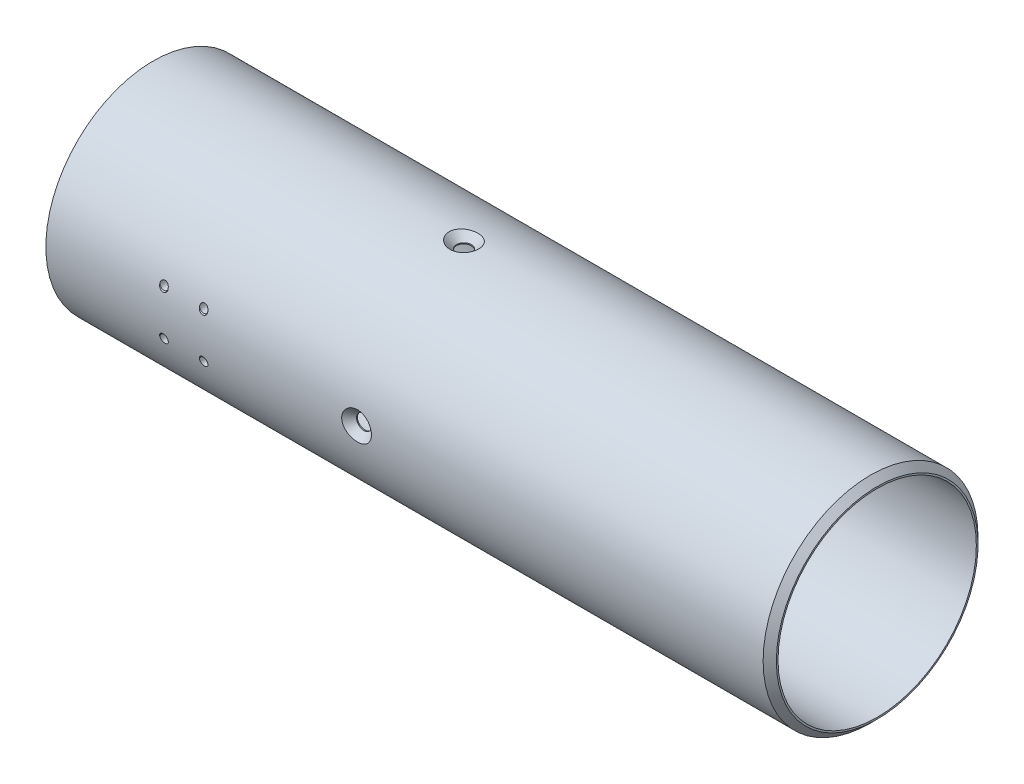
ISO-10303-21;
HEADER;
FILE_DESCRIPTION(('STEP AP214'),'2;1');
FILE_NAME('part.step','',(''),(''),'','','');
FILE_SCHEMA(('AUTOMOTIVE_DESIGN { 1 0 10303 214 1 1 1 1 }'));
ENDSEC;
DATA;
#1=APPLICATION_CONTEXT('core data for automotive mechanical design processes');
#2=APPLICATION_PROTOCOL_DEFINITION('international standard','automotive_design',2000,#1);
#3=PRODUCT_CONTEXT('',#1,'mechanical');
#4=PRODUCT('Part','Part','',(#3));
#5=PRODUCT_RELATED_PRODUCT_CATEGORY('part','',(#4));
#6=PRODUCT_DEFINITION_FORMATION('','',#4);
#7=PRODUCT_DEFINITION_CONTEXT('part definition',#1,'design');
#8=PRODUCT_DEFINITION('design','',#6,#7);
#9=PRODUCT_DEFINITION_SHAPE('','',#8);
#10=(LENGTH_UNIT() NAMED_UNIT(*) SI_UNIT(.MILLI.,.METRE.));
#11=(NAMED_UNIT(*) PLANE_ANGLE_UNIT() SI_UNIT($,.RADIAN.));
#12=(NAMED_UNIT(*) SI_UNIT($,.STERADIAN.) SOLID_ANGLE_UNIT());
#13=UNCERTAINTY_MEASURE_WITH_UNIT(LENGTH_MEASURE(1.E-05),#10,'distance_accuracy_value','');
#14=(GEOMETRIC_REPRESENTATION_CONTEXT(3) GLOBAL_UNCERTAINTY_ASSIGNED_CONTEXT((#13)) GLOBAL_UNIT_ASSIGNED_CONTEXT((#10,
#11,#12)) REPRESENTATION_CONTEXT('',''));
#15=CARTESIAN_POINT('',(0.,0.,0.));
#16=DIRECTION('',(0.,0.,1.));
#17=DIRECTION('',(1.,0.,0.));
#18=AXIS2_PLACEMENT_3D('',#15,#16,#17);
#19=CARTESIAN_POINT('',(0.,0.,-1.66533453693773E-13));
#20=DIRECTION('',(0.999999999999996,0.,0.));
#21=DIRECTION('',(0.,0.,-1.00000000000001));
#22=AXIS2_PLACEMENT_3D('',#19,#20,#21);
#23=CYLINDRICAL_SURFACE('',#22,32.5);
#24=CARTESIAN_POINT('',(113.,0.,5.55111512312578E-13));
#25=DIRECTION('',(0.999999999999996,0.,0.));
#26=DIRECTION('',(0.,0.,-1.00000000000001));
#27=AXIS2_PLACEMENT_3D('',#24,#25,#26);
#28=CIRCLE('',#27,32.5);
#29=CARTESIAN_POINT('',(113.,0.,32.5000000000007));
#30=VERTEX_POINT('',#29);
#31=EDGE_CURVE('E12',#30,#30,#28,.F.);
#32=ORIENTED_EDGE('',*,*,#31,.T.);
#33=EDGE_LOOP('',(#32));
#34=FACE_BOUND('',#33,.T.);
#35=CARTESIAN_POINT('',(-70.2484828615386,6.94263638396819,31.7498000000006));
#36=CARTESIAN_POINT('',(-70.2587954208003,6.88313377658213,31.7628159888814));
#37=CARTESIAN_POINT('',(-70.2648376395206,6.82290124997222,31.7758069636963));
#38=CARTESIAN_POINT('',(-70.268324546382,6.70204611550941,31.801514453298));
#39=CARTESIAN_POINT('',(-70.2657577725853,6.64142309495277,31.8142305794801));
#40=CARTESIAN_POINT('',(-70.2505146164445,6.5085815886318,31.8417003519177));
#41=CARTESIAN_POINT('',(-70.2358588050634,6.43655559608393,31.8563320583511));
#42=CARTESIAN_POINT('',(-70.1941953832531,6.29594371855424,31.8844199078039));
#43=CARTESIAN_POINT('',(-70.167189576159,6.22735733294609,31.8978762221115));
#44=CARTESIAN_POINT('',(-70.1020943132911,6.09692004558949,31.9230622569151));
#45=CARTESIAN_POINT('',(-70.0642158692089,6.03496915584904,31.9348189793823));
#46=CARTESIAN_POINT('',(-69.9782031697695,5.91830341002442,31.9566458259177));
#47=CARTESIAN_POINT('',(-69.9300690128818,5.86358848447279,31.9667159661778));
#48=CARTESIAN_POINT('',(-69.8259797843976,5.76412701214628,31.9847987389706));
#49=CARTESIAN_POINT('',(-69.770201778,5.719201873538,31.9928487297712));
#50=CARTESIAN_POINT('',(-69.6517038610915,5.63931365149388,32.0070272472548));
#51=CARTESIAN_POINT('',(-69.5889847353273,5.60434944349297,32.0131559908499));
#52=CARTESIAN_POINT('',(-69.4591668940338,5.54577792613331,32.0233543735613));
#53=CARTESIAN_POINT('',(-69.3921264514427,5.52204533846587,32.0274467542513));
#54=CARTESIAN_POINT('',(-69.2549450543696,5.48604810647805,32.0336325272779));
#55=CARTESIAN_POINT('',(-69.1848041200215,5.4737833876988,32.0357259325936));
#56=CARTESIAN_POINT('',(-69.0436792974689,5.46110518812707,32.0378896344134));
#57=CARTESIAN_POINT('',(-68.9726992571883,5.46065004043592,32.037967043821));
#58=CARTESIAN_POINT('',(-68.8316704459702,5.47149785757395,32.0361161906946));
#59=CARTESIAN_POINT('',(-68.7616216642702,5.48280068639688,32.0341879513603));
#60=CARTESIAN_POINT('',(-68.6244708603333,5.51682807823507,32.0283453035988));
#61=CARTESIAN_POINT('',(-68.5573677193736,5.53954826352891,32.0244316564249));
#62=CARTESIAN_POINT('',(-68.4279803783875,5.59574197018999,32.014660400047));
#63=CARTESIAN_POINT('',(-68.3656961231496,5.62921536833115,32.0088028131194));
#64=CARTESIAN_POINT('',(-68.2476310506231,5.70597222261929,31.9952089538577));
#65=CARTESIAN_POINT('',(-68.1918574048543,5.74926634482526,31.9874706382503));
#66=CARTESIAN_POINT('',(-68.0884350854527,5.84436494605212,31.9702318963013));
#67=CARTESIAN_POINT('',(-68.0407863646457,5.89616937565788,31.9607314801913));
#68=CARTESIAN_POINT('',(-67.9546332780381,6.00709477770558,31.9400690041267));
#69=CARTESIAN_POINT('',(-67.9161838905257,6.06625667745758,31.9288975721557));
#70=CARTESIAN_POINT('',(-67.8497622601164,6.18994849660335,31.9051484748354));
#71=CARTESIAN_POINT('',(-67.8217923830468,6.25447962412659,31.8925704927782));
#72=CARTESIAN_POINT('',(-67.7766466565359,6.38806653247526,31.8660840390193));
#73=CARTESIAN_POINT('',(-67.759639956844,6.45717587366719,31.8521583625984));
#74=CARTESIAN_POINT('',(-67.7374460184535,6.5970694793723,31.8234780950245));
#75=CARTESIAN_POINT('',(-67.73224957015,6.66785239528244,31.8087241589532));
#76=CARTESIAN_POINT('',(-67.7332926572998,6.77272581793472,31.7864974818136));
#77=CARTESIAN_POINT('',(-67.7350226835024,6.80695018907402,31.7791857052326));
#78=CARTESIAN_POINT('',(-67.7412261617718,6.87506830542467,31.7645187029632));
#79=CARTESIAN_POINT('',(-67.7456941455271,6.90896257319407,31.7571635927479));
#80=CARTESIAN_POINT('',(-67.7515171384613,6.94263638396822,31.7498000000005));
#81=B_SPLINE_CURVE_WITH_KNOTS('',3,(#35,#36,#37,#38,#39,#40,#41,#42,#43,#44,#45,#46,#47,#48,#49,
#50,#51,#52,#53,#54,#55,#56,#57,#58,#59,#60,#61,#62,#63,#64,#65,#66,#67,#68,#69,#70,#71,#72,#73,
#74,#75,#76,#77,#78,#79,#80),.UNSPECIFIED.,.F.,.F.,(4,2,2,2,2,2,2,2,2,2,2,2,2,2,2,2,2,2,2,2,2,2,
4),(0.,0.185151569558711,0.370549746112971,0.594258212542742,0.817934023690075,1.03753256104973,
1.25712899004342,1.47230212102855,1.68745094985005,1.90013987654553,2.11282742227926,
2.32476445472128,2.53669903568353,2.7485524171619,2.96040337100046,3.17248552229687,
3.38456644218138,3.59788482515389,3.81125133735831,4.02783569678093,4.244251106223,
4.34927639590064,4.45409260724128),.UNSPECIFIED.);
#82=CARTESIAN_POINT('',(-70.2486407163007,6.94172168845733,31.7500000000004));
#83=VERTEX_POINT('',#82);
#84=CARTESIAN_POINT('',(-67.751359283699,6.94172168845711,31.7500000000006));
#85=VERTEX_POINT('',#84);
#86=EDGE_CURVE('E122',#83,#85,#81,.T.);
#87=ORIENTED_EDGE('',*,*,#86,.F.);
#88=CARTESIAN_POINT('',(-67.751359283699,6.94172168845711,31.7500000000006));
#89=CARTESIAN_POINT('',(-67.749680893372,6.97769615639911,31.7421350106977));
#90=CARTESIAN_POINT('',(-67.7495583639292,7.01370864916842,31.7341968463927));
#91=CARTESIAN_POINT('',(-67.7524143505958,7.08558727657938,31.7182251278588));
#92=CARTESIAN_POINT('',(-67.7553927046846,7.12145341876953,31.7101915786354));
#93=CARTESIAN_POINT('',(-67.7689525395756,7.22842140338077,31.6860417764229));
#94=CARTESIAN_POINT('',(-67.7841549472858,7.29897750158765,31.6698578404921));
#95=CARTESIAN_POINT('',(-67.8264790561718,7.43650203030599,31.6378481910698));
#96=CARTESIAN_POINT('',(-67.8536060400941,7.50346885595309,31.6220226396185));
#97=CARTESIAN_POINT('',(-67.919076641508,7.63189785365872,31.5912724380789));
#98=CARTESIAN_POINT('',(-67.9574174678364,7.69336139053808,31.5763475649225));
#99=CARTESIAN_POINT('',(-68.044090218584,7.80864680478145,31.5480355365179));
#100=CARTESIAN_POINT('',(-68.0923663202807,7.8625086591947,31.5346404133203));
#101=CARTESIAN_POINT('',(-68.1977651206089,7.9613195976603,31.509839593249));
#102=CARTESIAN_POINT('',(-68.2548879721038,8.00626852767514,31.4984339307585));
#103=CARTESIAN_POINT('',(-68.3748944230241,8.08478546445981,31.4783711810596));
#104=CARTESIAN_POINT('',(-68.4376042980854,8.1186034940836,31.4696540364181));
#105=CARTESIAN_POINT('',(-68.5681275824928,8.17517742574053,31.4550049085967));
#106=CARTESIAN_POINT('',(-68.6359396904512,8.19793613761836,31.4490722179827));
#107=CARTESIAN_POINT('',(-68.7725324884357,8.23107589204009,31.4404146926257));
#108=CARTESIAN_POINT('',(-68.8412215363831,8.24181116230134,31.437598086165));
#109=CARTESIAN_POINT('',(-68.9794839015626,8.25175124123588,31.434990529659));
#110=CARTESIAN_POINT('',(-69.0490571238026,8.25095727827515,31.4351992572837));
#111=CARTESIAN_POINT('',(-69.1858076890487,8.23798626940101,31.4386008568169));
#112=CARTESIAN_POINT('',(-69.2530056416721,8.22601109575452,31.4417408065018));
#113=CARTESIAN_POINT('',(-69.3843870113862,8.19136984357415,31.4507834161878));
#114=CARTESIAN_POINT('',(-69.4485704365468,8.16870379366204,31.4566860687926));
#115=CARTESIAN_POINT('',(-69.5725557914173,8.11324743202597,31.4710348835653));
#116=CARTESIAN_POINT('',(-69.632329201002,8.08039734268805,31.4794960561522));
#117=CARTESIAN_POINT('',(-69.7455193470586,8.00563558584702,31.4985917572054));
#118=CARTESIAN_POINT('',(-69.7989353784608,7.96372291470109,31.5092265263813));
#119=CARTESIAN_POINT('',(-69.8993524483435,7.8708945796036,31.5325444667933));
#120=CARTESIAN_POINT('',(-69.9461576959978,7.81977849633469,31.5452725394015));
#121=CARTESIAN_POINT('',(-70.030574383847,7.71075418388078,31.5720987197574));
#122=CARTESIAN_POINT('',(-70.0681834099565,7.65284417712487,31.5861971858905));
#123=CARTESIAN_POINT('',(-70.1342814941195,7.53001363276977,31.6157081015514));
#124=CARTESIAN_POINT('',(-70.162466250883,7.4649358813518,31.631147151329));
#125=CARTESIAN_POINT('',(-70.2074239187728,7.331067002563,31.6624409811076));
#126=CARTESIAN_POINT('',(-70.2242037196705,7.26227814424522,31.6782955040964));
#127=CARTESIAN_POINT('',(-70.2415406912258,7.15113818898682,31.7035177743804));
#128=CARTESIAN_POINT('',(-70.2459148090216,7.1093527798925,31.7129143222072));
#129=CARTESIAN_POINT('',(-70.2504400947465,7.02559980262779,31.7315741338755));
#130=CARTESIAN_POINT('',(-70.2505984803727,6.98363266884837,31.7408375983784));
#131=CARTESIAN_POINT('',(-70.2486407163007,6.94172168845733,31.7500000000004));
#132=B_SPLINE_CURVE_WITH_KNOTS('',3,(#88,#89,#90,#91,#92,#93,#94,#95,#96,#97,#98,#99,#100,#101,
#102,#103,#104,#105,#106,#107,#108,#109,#110,#111,#112,#113,#114,#115,#116,#117,#118,#119,#120,
#121,#122,#123,#124,#125,#126,#127,#128,#129,#130,#131),.UNSPECIFIED.,.F.,.F.,(4,2,2,2,2,2,2,2,
2,2,2,2,2,2,2,2,2,2,2,2,2,4),(0.,0.110518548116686,0.221031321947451,0.44179981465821,
0.662666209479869,0.883477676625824,1.10308079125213,1.32268770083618,1.53695796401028,
1.7511737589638,1.95889727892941,2.16659866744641,2.37062113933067,2.57464306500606,
2.77988597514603,2.98515162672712,3.19559474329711,3.40609304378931,3.62284803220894,
3.83947196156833,3.96843806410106,4.09718335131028),.UNSPECIFIED.);
#133=EDGE_CURVE('E113',#85,#83,#132,.T.);
#134=ORIENTED_EDGE('',*,*,#133,.F.);
#135=EDGE_LOOP('',(#87,#134));
#136=FACE_BOUND('',#135,.T.);
#137=CARTESIAN_POINT('',(-67.7515171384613,-6.94263638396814,31.7498000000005));
#138=CARTESIAN_POINT('',(-67.7412045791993,-6.88313377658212,31.7628159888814));
#139=CARTESIAN_POINT('',(-67.7351623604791,-6.82290124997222,31.7758069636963));
#140=CARTESIAN_POINT('',(-67.7316754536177,-6.70204611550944,31.8015144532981));
#141=CARTESIAN_POINT('',(-67.7342422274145,-6.6414230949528,31.8142305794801));
#142=CARTESIAN_POINT('',(-67.7494853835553,-6.50858158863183,31.8417003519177));
#143=CARTESIAN_POINT('',(-67.7641411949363,-6.43655559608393,31.8563320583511));
#144=CARTESIAN_POINT('',(-67.8058046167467,-6.2959437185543,31.884419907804));
#145=CARTESIAN_POINT('',(-67.8328104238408,-6.2273573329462,31.8978762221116));
#146=CARTESIAN_POINT('',(-67.8979056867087,-6.09692004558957,31.9230622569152));
#147=CARTESIAN_POINT('',(-67.9357841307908,-6.03496915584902,31.9348189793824));
#148=CARTESIAN_POINT('',(-68.0217968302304,-5.9183034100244,31.9566458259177));
#149=CARTESIAN_POINT('',(-68.0699309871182,-5.86358848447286,31.9667159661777));
#150=CARTESIAN_POINT('',(-68.1740202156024,-5.76412701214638,31.9847987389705));
#151=CARTESIAN_POINT('',(-68.2297982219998,-5.71920187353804,31.9928487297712));
#152=CARTESIAN_POINT('',(-68.3482961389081,-5.63931365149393,32.0070272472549));
#153=CARTESIAN_POINT('',(-68.4110152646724,-5.60434944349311,32.0131559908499));
#154=CARTESIAN_POINT('',(-68.5408331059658,-5.54577792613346,32.0233543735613));
#155=CARTESIAN_POINT('',(-68.6078735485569,-5.52204533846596,32.0274467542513));
#156=CARTESIAN_POINT('',(-68.7450549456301,-5.48604810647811,32.0336325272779));
#157=CARTESIAN_POINT('',(-68.8151958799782,-5.4737833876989,32.0357259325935));
#158=CARTESIAN_POINT('',(-68.9563207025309,-5.46110518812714,32.0378896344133));
#159=CARTESIAN_POINT('',(-69.0273007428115,-5.46065004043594,32.037967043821));
#160=CARTESIAN_POINT('',(-69.1683295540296,-5.47149785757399,32.0361161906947));
#161=CARTESIAN_POINT('',(-69.2383783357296,-5.48280068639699,32.0341879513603));
#162=CARTESIAN_POINT('',(-69.3755291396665,-5.51682807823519,32.0283453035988));
#163=CARTESIAN_POINT('',(-69.4426322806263,-5.53954826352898,32.0244316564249));
#164=CARTESIAN_POINT('',(-69.5720196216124,-5.59574197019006,32.014660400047));
#165=CARTESIAN_POINT('',(-69.6343038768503,-5.62921536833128,32.0088028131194));
#166=CARTESIAN_POINT('',(-69.7523689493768,-5.70597222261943,31.9952089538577));
#167=CARTESIAN_POINT('',(-69.8081425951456,-5.74926634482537,31.9874706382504));
#168=CARTESIAN_POINT('',(-69.9115649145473,-5.84436494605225,31.9702318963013));
#169=CARTESIAN_POINT('',(-69.9592136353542,-5.89616937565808,31.9607314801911));
#170=CARTESIAN_POINT('',(-70.0453667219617,-6.00709477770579,31.9400690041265));
#171=CARTESIAN_POINT('',(-70.0838161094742,-6.06625667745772,31.9288975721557));
#172=CARTESIAN_POINT('',(-70.1502377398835,-6.18994849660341,31.9051484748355));
#173=CARTESIAN_POINT('',(-70.1782076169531,-6.25447962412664,31.8925704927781));
#174=CARTESIAN_POINT('',(-70.223353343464,-6.38806653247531,31.8660840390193));
#175=CARTESIAN_POINT('',(-70.2403600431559,-6.45717587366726,31.8521583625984));
#176=CARTESIAN_POINT('',(-70.2625539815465,-6.59706947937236,31.8234780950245));
#177=CARTESIAN_POINT('',(-70.2677504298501,-6.66785239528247,31.808724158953));
#178=CARTESIAN_POINT('',(-70.2667073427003,-6.77272581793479,31.7864974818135));
#179=CARTESIAN_POINT('',(-70.2649773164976,-6.80695018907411,31.7791857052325));
#180=CARTESIAN_POINT('',(-70.2587738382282,-6.87506830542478,31.7645187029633));
#181=CARTESIAN_POINT('',(-70.2543058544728,-6.90896257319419,31.757163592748));
#182=CARTESIAN_POINT('',(-70.2484828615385,-6.9426363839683,31.7498000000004));
#183=B_SPLINE_CURVE_WITH_KNOTS('',3,(#137,#138,#139,#140,#141,#142,#143,#144,#145,#146,#147,
#148,#149,#150,#151,#152,#153,#154,#155,#156,#157,#158,#159,#160,#161,#162,#163,#164,#165,#166,
#167,#168,#169,#170,#171,#172,#173,#174,#175,#176,#177,#178,#179,#180,#181,#182),.UNSPECIFIED.,
.F.,.F.,(4,2,2,2,2,2,2,2,2,2,2,2,2,2,2,2,2,2,2,2,2,2,4),(0.,0.18515156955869,0.370549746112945,
0.594258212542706,0.817934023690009,1.03753256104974,1.25712899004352,1.47230212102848,
1.68745094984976,1.90013987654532,2.11282742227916,2.32476445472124,2.53669903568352,
2.74855241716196,2.96040337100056,3.17248552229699,3.38456644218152,3.59788482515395,
3.81125133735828,4.02783569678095,4.24425110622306,4.34927639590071,4.45409260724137),.UNSPECIFIED.);
#184=CARTESIAN_POINT('',(-67.7513592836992,-6.94172168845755,31.7500000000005));
#185=VERTEX_POINT('',#184);
#186=CARTESIAN_POINT('',(-70.2486407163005,-6.94172168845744,31.7500000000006));
#187=VERTEX_POINT('',#186);
#188=EDGE_CURVE('E125',#185,#187,#183,.T.);
#189=ORIENTED_EDGE('',*,*,#188,.F.);
#190=CARTESIAN_POINT('',(-70.2486407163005,-6.94172168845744,31.7500000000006));
#191=CARTESIAN_POINT('',(-70.2503191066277,-6.97769615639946,31.7421350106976));
#192=CARTESIAN_POINT('',(-70.2504416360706,-7.01370864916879,31.7341968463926));
#193=CARTESIAN_POINT('',(-70.2475856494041,-7.08558727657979,31.7182251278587));
#194=CARTESIAN_POINT('',(-70.2446072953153,-7.12145341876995,31.7101915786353));
#195=CARTESIAN_POINT('',(-70.2310474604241,-7.22842140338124,31.6860417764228));
#196=CARTESIAN_POINT('',(-70.2158450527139,-7.29897750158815,31.669857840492));
#197=CARTESIAN_POINT('',(-70.1735209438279,-7.43650203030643,31.6378481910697));
#198=CARTESIAN_POINT('',(-70.1463939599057,-7.50346885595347,31.6220226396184));
#199=CARTESIAN_POINT('',(-70.0809233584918,-7.63189785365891,31.5912724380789));
#200=CARTESIAN_POINT('',(-70.0425825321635,-7.69336139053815,31.5763475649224));
#201=CARTESIAN_POINT('',(-69.9559097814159,-7.8086468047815,31.5480355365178));
#202=CARTESIAN_POINT('',(-69.9076336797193,-7.86250865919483,31.5346404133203));
#203=CARTESIAN_POINT('',(-69.8022348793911,-7.96131959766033,31.5098395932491));
#204=CARTESIAN_POINT('',(-69.745112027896,-8.00626852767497,31.4984339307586));
#205=CARTESIAN_POINT('',(-69.6251055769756,-8.08478546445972,31.4783711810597));
#206=CARTESIAN_POINT('',(-69.5623957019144,-8.11860349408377,31.4696540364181));
#207=CARTESIAN_POINT('',(-69.431872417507,-8.17517742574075,31.4550049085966));
#208=CARTESIAN_POINT('',(-69.3640603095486,-8.19793613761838,31.4490722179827));
#209=CARTESIAN_POINT('',(-69.2274675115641,-8.23107589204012,31.4404146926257));
#210=CARTESIAN_POINT('',(-69.1587784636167,-8.24181116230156,31.4375980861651));
#211=CARTESIAN_POINT('',(-69.0205160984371,-8.25175124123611,31.434990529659));
#212=CARTESIAN_POINT('',(-68.9509428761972,-8.25095727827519,31.4351992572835));
#213=CARTESIAN_POINT('',(-68.814192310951,-8.23798626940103,31.4386008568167));
#214=CARTESIAN_POINT('',(-68.7469943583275,-8.22601109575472,31.4417408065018));
#215=CARTESIAN_POINT('',(-68.6156129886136,-8.19136984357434,31.4507834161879));
#216=CARTESIAN_POINT('',(-68.551429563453,-8.16870379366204,31.4566860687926));
#217=CARTESIAN_POINT('',(-68.4274442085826,-8.11324743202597,31.4710348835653));
#218=CARTESIAN_POINT('',(-68.3676707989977,-8.08039734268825,31.4794960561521));
#219=CARTESIAN_POINT('',(-68.2544806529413,-8.00563558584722,31.4985917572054));
#220=CARTESIAN_POINT('',(-68.2010646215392,-7.9637229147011,31.5092265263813));
#221=CARTESIAN_POINT('',(-68.1006475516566,-7.87089457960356,31.5325444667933));
#222=CARTESIAN_POINT('',(-68.053842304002,-7.81977849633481,31.5452725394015));
#223=CARTESIAN_POINT('',(-67.9694256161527,-7.71075418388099,31.5720987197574));
#224=CARTESIAN_POINT('',(-67.9318165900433,-7.65284417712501,31.5861971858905));
#225=CARTESIAN_POINT('',(-67.8657185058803,-7.53001363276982,31.6157081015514));
#226=CARTESIAN_POINT('',(-67.8375337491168,-7.46493588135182,31.6311471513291));
#227=CARTESIAN_POINT('',(-67.7925760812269,-7.33106700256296,31.6624409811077));
#228=CARTESIAN_POINT('',(-67.7757962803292,-7.26227814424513,31.6782955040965));
#229=CARTESIAN_POINT('',(-67.758459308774,-7.15113818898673,31.7035177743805));
#230=CARTESIAN_POINT('',(-67.7540851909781,-7.10935277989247,31.7129143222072));
#231=CARTESIAN_POINT('',(-67.7495599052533,-7.02559980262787,31.7315741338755));
#232=CARTESIAN_POINT('',(-67.7494015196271,-6.98363266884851,31.7408375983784));
#233=CARTESIAN_POINT('',(-67.7513592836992,-6.94172168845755,31.7500000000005));
#234=B_SPLINE_CURVE_WITH_KNOTS('',3,(#190,#191,#192,#193,#194,#195,#196,#197,#198,#199,#200,
#201,#202,#203,#204,#205,#206,#207,#208,#209,#210,#211,#212,#213,#214,#215,#216,#217,#218,#219,
#220,#221,#222,#223,#224,#225,#226,#227,#228,#229,#230,#231,#232,#233),.UNSPECIFIED.,.F.,.F.,(4,
2,2,2,2,2,2,2,2,2,2,2,2,2,2,2,2,2,2,2,2,4),(0.,0.110518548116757,0.221031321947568,
0.441799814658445,0.662666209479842,0.883477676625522,1.1030807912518,1.32268770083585,
1.53695796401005,1.75117375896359,1.95889727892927,2.16659866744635,2.37062113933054,
2.57464306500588,2.77988597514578,2.98515162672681,3.19559474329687,3.40609304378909,
3.62284803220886,3.83947196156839,3.96843806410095,4.09718335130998),.UNSPECIFIED.);
#235=EDGE_CURVE('E160',#187,#185,#234,.T.);
#236=ORIENTED_EDGE('',*,*,#235,.F.);
#237=EDGE_LOOP('',(#189,#236));
#238=FACE_BOUND('',#237,.T.);
#239=CARTESIAN_POINT('',(-55.7515171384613,-6.94263638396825,31.7498000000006));
#240=CARTESIAN_POINT('',(-55.7412045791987,-6.88313377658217,31.7628159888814));
#241=CARTESIAN_POINT('',(-55.7351623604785,-6.82290124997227,31.7758069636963));
#242=CARTESIAN_POINT('',(-55.7316754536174,-6.70204611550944,31.801514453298));
#243=CARTESIAN_POINT('',(-55.7342422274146,-6.64142309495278,31.8142305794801));
#244=CARTESIAN_POINT('',(-55.7494853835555,-6.50858158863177,31.8417003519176));
#245=CARTESIAN_POINT('',(-55.7641411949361,-6.43655559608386,31.8563320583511));
#246=CARTESIAN_POINT('',(-55.8058046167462,-6.29594371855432,31.884419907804));
#247=CARTESIAN_POINT('',(-55.8328104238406,-6.22735733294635,31.8978762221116));
#248=CARTESIAN_POINT('',(-55.8979056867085,-6.09692004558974,31.9230622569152));
#249=CARTESIAN_POINT('',(-55.9357841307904,-6.0349691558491,31.9348189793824));
#250=CARTESIAN_POINT('',(-56.02179683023,-5.91830341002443,31.9566458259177));
#251=CARTESIAN_POINT('',(-56.0699309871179,-5.86358848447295,31.9667159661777));
#252=CARTESIAN_POINT('',(-56.1740202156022,-5.76412701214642,31.9847987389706));
#253=CARTESIAN_POINT('',(-56.2297982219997,-5.71920187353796,31.9928487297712));
#254=CARTESIAN_POINT('',(-56.3482961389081,-5.63931365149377,32.0070272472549));
#255=CARTESIAN_POINT('',(-56.4110152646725,-5.60434944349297,32.0131559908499));
#256=CARTESIAN_POINT('',(-56.540833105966,-5.54577792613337,32.0233543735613));
#257=CARTESIAN_POINT('',(-56.6078735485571,-5.52204533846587,32.0274467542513));
#258=CARTESIAN_POINT('',(-56.7450549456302,-5.48604810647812,32.0336325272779));
#259=CARTESIAN_POINT('',(-56.8151958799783,-5.47378338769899,32.0357259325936));
#260=CARTESIAN_POINT('',(-56.9563207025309,-5.46110518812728,32.0378896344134));
#261=CARTESIAN_POINT('',(-57.0273007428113,-5.46065004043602,32.037967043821));
#262=CARTESIAN_POINT('',(-57.1683295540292,-5.47149785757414,32.0361161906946));
#263=CARTESIAN_POINT('',(-57.2383783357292,-5.48280068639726,32.0341879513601));
#264=CARTESIAN_POINT('',(-57.375529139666,-5.51682807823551,32.0283453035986));
#265=CARTESIAN_POINT('',(-57.4426322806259,-5.53954826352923,32.0244316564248));
#266=CARTESIAN_POINT('',(-57.5720196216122,-5.59574197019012,32.0146604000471));
#267=CARTESIAN_POINT('',(-57.6343038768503,-5.62921536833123,32.0088028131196));
#268=CARTESIAN_POINT('',(-57.7523689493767,-5.70597222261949,31.9952089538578));
#269=CARTESIAN_POINT('',(-57.8081425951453,-5.74926634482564,31.9874706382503));
#270=CARTESIAN_POINT('',(-57.911564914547,-5.84436494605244,31.9702318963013));
#271=CARTESIAN_POINT('',(-57.9592136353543,-5.89616937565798,31.9607314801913));
#272=CARTESIAN_POINT('',(-58.0453667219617,-6.00709477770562,31.9400690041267));
#273=CARTESIAN_POINT('',(-58.0838161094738,-6.06625667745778,31.9288975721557));
#274=CARTESIAN_POINT('',(-58.1502377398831,-6.18994849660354,31.9051484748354));
#275=CARTESIAN_POINT('',(-58.178207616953,-6.2544796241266,31.8925704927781));
#276=CARTESIAN_POINT('',(-58.2233533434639,-6.3880665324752,31.8660840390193));
#277=CARTESIAN_POINT('',(-58.2403600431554,-6.45717587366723,31.8521583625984));
#278=CARTESIAN_POINT('',(-58.2625539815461,-6.5970694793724,31.8234780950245));
#279=CARTESIAN_POINT('',(-58.2677504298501,-6.6678523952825,31.8087241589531));
#280=CARTESIAN_POINT('',(-58.2667073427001,-6.77272581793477,31.7864974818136));
#281=CARTESIAN_POINT('',(-58.2649773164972,-6.80695018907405,31.7791857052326));
#282=CARTESIAN_POINT('',(-58.2587738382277,-6.8750683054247,31.7645187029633));
#283=CARTESIAN_POINT('',(-58.2543058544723,-6.90896257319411,31.757163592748));
#284=CARTESIAN_POINT('',(-58.2484828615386,-6.94263638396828,31.7498000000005));
#285=B_SPLINE_CURVE_WITH_KNOTS('',3,(#239,#240,#241,#242,#243,#244,#245,#246,#247,#248,#249,
#250,#251,#252,#253,#254,#255,#256,#257,#258,#259,#260,#261,#262,#263,#264,#265,#266,#267,#268,
#269,#270,#271,#272,#273,#274,#275,#276,#277,#278,#279,#280,#281,#282,#283,#284),.UNSPECIFIED.,
.F.,.F.,(4,2,2,2,2,2,2,2,2,2,2,2,2,2,2,2,2,2,2,2,2,2,4),(0.,0.185151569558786,0.370549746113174,
0.594258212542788,0.817934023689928,1.03753256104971,1.25712899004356,1.47230212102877,
1.68745094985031,1.90013987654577,2.1128274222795,2.32476445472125,2.53669903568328,
2.74855241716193,2.96040337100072,3.17248552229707,3.38456644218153,3.59788482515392,
3.81125133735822,4.02783569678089,4.24425110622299,4.34927639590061,4.45409260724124),.UNSPECIFIED.);
#286=CARTESIAN_POINT('',(-55.7513592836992,-6.94172168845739,31.7500000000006));
#287=VERTEX_POINT('',#286);
#288=CARTESIAN_POINT('',(-58.2486407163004,-6.9417216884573,31.7500000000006));
#289=VERTEX_POINT('',#288);
#290=EDGE_CURVE('E128',#287,#289,#285,.T.);
#291=ORIENTED_EDGE('',*,*,#290,.F.);
#292=CARTESIAN_POINT('',(-58.2486407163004,-6.9417216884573,31.7500000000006));
#293=CARTESIAN_POINT('',(-58.2503191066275,-6.97769615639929,31.7421350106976));
#294=CARTESIAN_POINT('',(-58.2504416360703,-7.01370864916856,31.7341968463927));
#295=CARTESIAN_POINT('',(-58.2475856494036,-7.08558727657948,31.7182251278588));
#296=CARTESIAN_POINT('',(-58.2446072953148,-7.12145341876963,31.7101915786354));
#297=CARTESIAN_POINT('',(-58.2310474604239,-7.2284214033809,31.6860417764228));
#298=CARTESIAN_POINT('',(-58.2158450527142,-7.29897750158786,31.6698578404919));
#299=CARTESIAN_POINT('',(-58.1735209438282,-7.43650203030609,31.6378481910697));
#300=CARTESIAN_POINT('',(-58.1463939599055,-7.50346885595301,31.6220226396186));
#301=CARTESIAN_POINT('',(-58.0809233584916,-7.6318978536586,31.5912724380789));
#302=CARTESIAN_POINT('',(-58.0425825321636,-7.69336139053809,31.5763475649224));
#303=CARTESIAN_POINT('',(-57.9559097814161,-7.80864680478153,31.5480355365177));
#304=CARTESIAN_POINT('',(-57.9076336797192,-7.86250865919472,31.5346404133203));
#305=CARTESIAN_POINT('',(-57.8022348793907,-7.96131959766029,31.5098395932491));
#306=CARTESIAN_POINT('',(-57.7451120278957,-8.00626852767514,31.4984339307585));
#307=CARTESIAN_POINT('',(-57.6251055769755,-8.08478546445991,31.4783711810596));
#308=CARTESIAN_POINT('',(-57.5623957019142,-8.11860349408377,31.4696540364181));
#309=CARTESIAN_POINT('',(-57.4318724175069,-8.17517742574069,31.4550049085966));
#310=CARTESIAN_POINT('',(-57.3640603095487,-8.19793613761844,31.4490722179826));
#311=CARTESIAN_POINT('',(-57.2274675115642,-8.23107589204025,31.4404146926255));
#312=CARTESIAN_POINT('',(-57.1587784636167,-8.24181116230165,31.437598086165));
#313=CARTESIAN_POINT('',(-57.0205160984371,-8.25175124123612,31.434990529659));
#314=CARTESIAN_POINT('',(-56.9509428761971,-8.25095727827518,31.4351992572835));
#315=CARTESIAN_POINT('',(-56.8141923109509,-8.2379862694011,31.4386008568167));
#316=CARTESIAN_POINT('',(-56.7469943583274,-8.22601109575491,31.4417408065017));
#317=CARTESIAN_POINT('',(-56.6156129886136,-8.19136984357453,31.4507834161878));
#318=CARTESIAN_POINT('',(-56.5514295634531,-8.16870379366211,31.4566860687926));
#319=CARTESIAN_POINT('',(-56.4274442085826,-8.11324743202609,31.4710348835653));
#320=CARTESIAN_POINT('',(-56.3676707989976,-8.08039734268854,31.4794960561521));
#321=CARTESIAN_POINT('',(-56.2544806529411,-8.00563558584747,31.4985917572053));
#322=CARTESIAN_POINT('',(-56.2010646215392,-7.96372291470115,31.5092265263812));
#323=CARTESIAN_POINT('',(-56.1006475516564,-7.87089457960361,31.5325444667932));
#324=CARTESIAN_POINT('',(-56.0538423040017,-7.81977849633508,31.5452725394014));
#325=CARTESIAN_POINT('',(-55.9694256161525,-7.71075418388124,31.5720987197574));
#326=CARTESIAN_POINT('',(-55.9318165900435,-7.65284417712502,31.5861971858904));
#327=CARTESIAN_POINT('',(-55.8657185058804,-7.5300136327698,31.6157081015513));
#328=CARTESIAN_POINT('',(-55.8375337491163,-7.46493588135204,31.631147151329));
#329=CARTESIAN_POINT('',(-55.7925760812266,-7.33106700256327,31.6624409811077));
#330=CARTESIAN_POINT('',(-55.7757962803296,-7.26227814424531,31.6782955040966));
#331=CARTESIAN_POINT('',(-55.7584593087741,-7.15113818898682,31.7035177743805));
#332=CARTESIAN_POINT('',(-55.7540851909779,-7.10935277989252,31.7129143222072));
#333=CARTESIAN_POINT('',(-55.7495599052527,-7.02559980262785,31.7315741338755));
#334=CARTESIAN_POINT('',(-55.7494015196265,-6.98363266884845,31.7408375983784));
#335=CARTESIAN_POINT('',(-55.7513592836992,-6.94172168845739,31.7500000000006));
#336=B_SPLINE_CURVE_WITH_KNOTS('',3,(#292,#293,#294,#295,#296,#297,#298,#299,#300,#301,#302,
#303,#304,#305,#306,#307,#308,#309,#310,#311,#312,#313,#314,#315,#316,#317,#318,#319,#320,#321,
#322,#323,#324,#325,#326,#327,#328,#329,#330,#331,#332,#333,#334,#335),.UNSPECIFIED.,.F.,.F.,(4,
2,2,2,2,2,2,2,2,2,2,2,2,2,2,2,2,2,2,2,2,4),(0.,0.110518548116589,0.221031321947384,
0.44179981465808,0.662666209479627,0.883477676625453,1.10308079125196,1.32268770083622,
1.53695796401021,1.75117375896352,1.95889727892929,2.16659866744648,2.37062113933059,
2.57464306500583,2.77988597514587,2.98515162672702,3.19559474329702,3.4060930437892,
3.62284803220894,3.83947196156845,3.96843806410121,4.09718335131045),.UNSPECIFIED.);
#337=EDGE_CURVE('E170',#289,#287,#336,.T.);
#338=ORIENTED_EDGE('',*,*,#337,.F.);
#339=EDGE_LOOP('',(#291,#338));
#340=FACE_BOUND('',#339,.T.);
#341=CARTESIAN_POINT('',(-58.2484828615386,6.94263638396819,31.7498000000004));
#342=CARTESIAN_POINT('',(-58.2587954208,6.88313377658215,31.7628159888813));
#343=CARTESIAN_POINT('',(-58.2648376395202,6.8229012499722,31.7758069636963));
#344=CARTESIAN_POINT('',(-58.2683245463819,6.7020461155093,31.8015144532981));
#345=CARTESIAN_POINT('',(-58.2657577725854,6.64142309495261,31.8142305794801));
#346=CARTESIAN_POINT('',(-58.2505146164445,6.50858158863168,31.8417003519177));
#347=CARTESIAN_POINT('',(-58.2358588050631,6.43655559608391,31.8563320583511));
#348=CARTESIAN_POINT('',(-58.1941953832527,6.29594371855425,31.8844199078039));
#349=CARTESIAN_POINT('',(-58.1671895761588,6.22735733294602,31.8978762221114));
#350=CARTESIAN_POINT('',(-58.102094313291,6.0969200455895,31.923062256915));
#351=CARTESIAN_POINT('',(-58.0642158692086,6.03496915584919,31.9348189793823));
#352=CARTESIAN_POINT('',(-57.9782031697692,5.91830341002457,31.9566458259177));
#353=CARTESIAN_POINT('',(-57.9300690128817,5.8635884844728,31.9667159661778));
#354=CARTESIAN_POINT('',(-57.8259797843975,5.76412701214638,31.9847987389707));
#355=CARTESIAN_POINT('',(-57.7702017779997,5.71920187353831,31.9928487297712));
#356=CARTESIAN_POINT('',(-57.6517038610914,5.63931365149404,32.0070272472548));
#357=CARTESIAN_POINT('',(-57.5889847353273,5.60434944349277,32.0131559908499));
#358=CARTESIAN_POINT('',(-57.459166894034,5.54577792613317,32.0233543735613));
#359=CARTESIAN_POINT('',(-57.3921264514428,5.52204533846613,32.0274467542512));
#360=CARTESIAN_POINT('',(-57.2549450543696,5.48604810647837,32.0336325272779));
#361=CARTESIAN_POINT('',(-57.1848041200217,5.47378338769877,32.0357259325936));
#362=CARTESIAN_POINT('',(-57.0436792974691,5.46110518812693,32.0378896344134));
#363=CARTESIAN_POINT('',(-56.9726992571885,5.46065004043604,32.037967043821));
#364=CARTESIAN_POINT('',(-56.8316704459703,5.47149785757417,32.0361161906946));
#365=CARTESIAN_POINT('',(-56.7616216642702,5.48280068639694,32.0341879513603));
#366=CARTESIAN_POINT('',(-56.6244708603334,5.51682807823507,32.0283453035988));
#367=CARTESIAN_POINT('',(-56.5573677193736,5.539548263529,32.0244316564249));
#368=CARTESIAN_POINT('',(-56.4279803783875,5.5957419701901,32.0146604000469));
#369=CARTESIAN_POINT('',(-56.3656961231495,5.62921536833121,32.0088028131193));
#370=CARTESIAN_POINT('',(-56.247631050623,5.70597222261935,31.9952089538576));
#371=CARTESIAN_POINT('',(-56.1918574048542,5.74926634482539,31.9874706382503));
#372=CARTESIAN_POINT('',(-56.0884350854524,5.84436494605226,31.9702318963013));
#373=CARTESIAN_POINT('',(-56.0407863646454,5.89616937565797,31.9607314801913));
#374=CARTESIAN_POINT('',(-55.9546332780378,6.00709477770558,31.9400690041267));
#375=CARTESIAN_POINT('',(-55.9161838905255,6.06625667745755,31.9288975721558));
#376=CARTESIAN_POINT('',(-55.8497622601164,6.18994849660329,31.9051484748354));
#377=CARTESIAN_POINT('',(-55.8217923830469,6.25447962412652,31.8925704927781));
#378=CARTESIAN_POINT('',(-55.776646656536,6.38806653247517,31.8660840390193));
#379=CARTESIAN_POINT('',(-55.7596399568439,6.45717587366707,31.8521583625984));
#380=CARTESIAN_POINT('',(-55.7374460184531,6.5970694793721,31.8234780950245));
#381=CARTESIAN_POINT('',(-55.7322495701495,6.6678523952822,31.808724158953));
#382=CARTESIAN_POINT('',(-55.7332926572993,6.77272581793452,31.7864974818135));
#383=CARTESIAN_POINT('',(-55.735022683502,6.80695018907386,31.7791857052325));
#384=CARTESIAN_POINT('',(-55.7412261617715,6.87506830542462,31.7645187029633));
#385=CARTESIAN_POINT('',(-55.745694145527,6.90896257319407,31.757163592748));
#386=CARTESIAN_POINT('',(-55.7515171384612,6.94263638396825,31.7498000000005));
#387=B_SPLINE_CURVE_WITH_KNOTS('',3,(#341,#342,#343,#344,#345,#346,#347,#348,#349,#350,#351,
#352,#353,#354,#355,#356,#357,#358,#359,#360,#361,#362,#363,#364,#365,#366,#367,#368,#369,#370,
#371,#372,#373,#374,#375,#376,#377,#378,#379,#380,#381,#382,#383,#384,#385,#386),.UNSPECIFIED.,
.F.,.F.,(4,2,2,2,2,2,2,2,2,2,2,2,2,2,2,2,2,2,2,2,2,2,4),(0.,0.185151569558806,0.370549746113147,
0.594258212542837,0.817934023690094,1.0375325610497,1.25712899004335,1.47230212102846,
1.68745094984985,1.90013987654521,2.11282742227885,2.32476445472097,2.53669903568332,
2.74855241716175,2.96040337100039,3.17248552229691,3.38456644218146,3.59788482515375,
3.81125133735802,4.02783569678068,4.24425110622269,4.34927639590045,4.45409260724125),.UNSPECIFIED.);
#388=CARTESIAN_POINT('',(-58.2486407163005,6.94172168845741,31.7500000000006));
#389=VERTEX_POINT('',#388);
#390=CARTESIAN_POINT('',(-55.7513592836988,6.94172168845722,31.7500000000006));
#391=VERTEX_POINT('',#390);
#392=EDGE_CURVE('E193',#389,#391,#387,.T.);
#393=ORIENTED_EDGE('',*,*,#392,.F.);
#394=CARTESIAN_POINT('',(-55.7513592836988,6.94172168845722,31.7500000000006));
#395=CARTESIAN_POINT('',(-55.7496808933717,6.97769615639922,31.7421350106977));
#396=CARTESIAN_POINT('',(-55.7495583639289,7.01370864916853,31.7341968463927));
#397=CARTESIAN_POINT('',(-55.7524143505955,7.08558727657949,31.7182251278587));
#398=CARTESIAN_POINT('',(-55.7553927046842,7.12145341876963,31.7101915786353));
#399=CARTESIAN_POINT('',(-55.7689525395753,7.22842140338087,31.6860417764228));
#400=CARTESIAN_POINT('',(-55.7841549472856,7.29897750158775,31.6698578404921));
#401=CARTESIAN_POINT('',(-55.8264790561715,7.4365020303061,31.6378481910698));
#402=CARTESIAN_POINT('',(-55.8536060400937,7.50346885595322,31.6220226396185));
#403=CARTESIAN_POINT('',(-55.9190766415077,7.63189785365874,31.5912724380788));
#404=CARTESIAN_POINT('',(-55.9574174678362,7.69336139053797,31.5763475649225));
#405=CARTESIAN_POINT('',(-56.0440902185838,7.80864680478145,31.5480355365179));
#406=CARTESIAN_POINT('',(-56.0923663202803,7.86250865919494,31.5346404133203));
#407=CARTESIAN_POINT('',(-56.1977651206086,7.96131959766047,31.509839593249));
#408=CARTESIAN_POINT('',(-56.2548879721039,8.00626852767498,31.4984339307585));
#409=CARTESIAN_POINT('',(-56.3748944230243,8.08478546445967,31.4783711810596));
#410=CARTESIAN_POINT('',(-56.4376042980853,8.11860349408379,31.469654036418));
#411=CARTESIAN_POINT('',(-56.5681275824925,8.17517742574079,31.4550049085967));
#412=CARTESIAN_POINT('',(-56.6359396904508,8.19793613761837,31.4490722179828));
#413=CARTESIAN_POINT('',(-56.7725324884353,8.2310758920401,31.4404146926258));
#414=CARTESIAN_POINT('',(-56.8412215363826,8.24181116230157,31.437598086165));
#415=CARTESIAN_POINT('',(-56.9794839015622,8.25175124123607,31.434990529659));
#416=CARTESIAN_POINT('',(-57.0490571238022,8.25095727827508,31.4351992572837));
#417=CARTESIAN_POINT('',(-57.1858076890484,8.23798626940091,31.4386008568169));
#418=CARTESIAN_POINT('',(-57.253005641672,8.22601109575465,31.4417408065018));
#419=CARTESIAN_POINT('',(-57.3843870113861,8.19136984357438,31.4507834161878));
#420=CARTESIAN_POINT('',(-57.4485704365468,8.16870379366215,31.4566860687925));
#421=CARTESIAN_POINT('',(-57.5725557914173,8.11324743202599,31.4710348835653));
#422=CARTESIAN_POINT('',(-57.632329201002,8.08039734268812,31.4794960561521));
#423=CARTESIAN_POINT('',(-57.7455193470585,8.00563558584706,31.4985917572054));
#424=CARTESIAN_POINT('',(-57.7989353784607,7.96372291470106,31.5092265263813));
#425=CARTESIAN_POINT('',(-57.8993524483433,7.8708945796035,31.5325444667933));
#426=CARTESIAN_POINT('',(-57.9461576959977,7.81977849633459,31.5452725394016));
#427=CARTESIAN_POINT('',(-58.030574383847,7.71075418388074,31.5720987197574));
#428=CARTESIAN_POINT('',(-58.0681834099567,7.65284417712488,31.5861971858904));
#429=CARTESIAN_POINT('',(-58.1342814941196,7.53001363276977,31.6157081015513));
#430=CARTESIAN_POINT('',(-58.1624662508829,7.46493588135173,31.631147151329));
#431=CARTESIAN_POINT('',(-58.2074239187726,7.3310670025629,31.6624409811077));
#432=CARTESIAN_POINT('',(-58.2242037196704,7.26227814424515,31.6782955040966));
#433=CARTESIAN_POINT('',(-58.2415406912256,7.15113818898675,31.7035177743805));
#434=CARTESIAN_POINT('',(-58.2459148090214,7.10935277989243,31.7129143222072));
#435=CARTESIAN_POINT('',(-58.2504400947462,7.02559980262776,31.7315741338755));
#436=CARTESIAN_POINT('',(-58.2505984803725,6.98363266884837,31.7408375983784));
#437=CARTESIAN_POINT('',(-58.2486407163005,6.94172168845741,31.7500000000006));
#438=B_SPLINE_CURVE_WITH_KNOTS('',3,(#394,#395,#396,#397,#398,#399,#400,#401,#402,#403,#404,
#405,#406,#407,#408,#409,#410,#411,#412,#413,#414,#415,#416,#417,#418,#419,#420,#421,#422,#423,
#424,#425,#426,#427,#428,#429,#430,#431,#432,#433,#434,#435,#436,#437),.UNSPECIFIED.,.F.,.F.,(4,
2,2,2,2,2,2,2,2,2,2,2,2,2,2,2,2,2,2,2,2,4),(0.,0.110518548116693,0.221031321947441,
0.441799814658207,0.662666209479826,0.883477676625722,1.10308079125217,1.32268770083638,
1.53695796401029,1.75117375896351,1.95889727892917,2.16659866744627,2.37062113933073,
2.57464306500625,2.7798859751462,2.98515162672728,3.19559474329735,3.40609304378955,
3.62284803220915,3.83947196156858,3.96843806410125,4.09718335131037),.UNSPECIFIED.);
#439=EDGE_CURVE('E252',#391,#389,#438,.T.);
#440=ORIENTED_EDGE('',*,*,#439,.F.);
#441=EDGE_LOOP('',(#393,#440));
#442=FACE_BOUND('',#441,.T.);
#443=CARTESIAN_POINT('',(-13.578843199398,32.3991592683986,-2.55821868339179));
#444=CARTESIAN_POINT('',(-13.7161321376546,32.4125107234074,-2.38911427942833));
#445=CARTESIAN_POINT('',(-13.8405134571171,32.4253609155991,-2.2094395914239));
#446=CARTESIAN_POINT('',(-14.0596882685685,32.4488386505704,-1.83261813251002));
#447=CARTESIAN_POINT('',(-14.1544717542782,32.4594654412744,-1.6354654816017));
#448=CARTESIAN_POINT('',(-14.3169263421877,32.4780801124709,-1.21328617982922));
#449=CARTESIAN_POINT('',(-14.3820936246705,32.4858167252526,-0.987275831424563));
#450=CARTESIAN_POINT('',(-14.4716662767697,32.4965376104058,-0.527196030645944));
#451=CARTESIAN_POINT('',(-14.4960757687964,32.4995223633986,-0.293127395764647));
#452=CARTESIAN_POINT('',(-14.5028833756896,32.5003510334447,0.164364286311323));
#453=CARTESIAN_POINT('',(-14.4872390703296,32.4984345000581,0.387759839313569));
#454=CARTESIAN_POINT('',(-14.4186927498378,32.4901828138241,0.828636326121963));
#455=CARTESIAN_POINT('',(-14.365794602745,32.4838481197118,1.04611787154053));
#456=CARTESIAN_POINT('',(-14.2252109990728,32.4675075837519,1.46812014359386));
#457=CARTESIAN_POINT('',(-14.137700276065,32.4575202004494,1.67270007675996));
#458=CARTESIAN_POINT('',(-13.9310647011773,32.4349246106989,2.06502737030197));
#459=CARTESIAN_POINT('',(-13.8119344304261,32.4223159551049,2.25277183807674));
#460=CARTESIAN_POINT('',(-13.5401699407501,32.3951623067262,2.61493546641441));
#461=CARTESIAN_POINT('',(-13.3863124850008,32.3805572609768,2.78843089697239));
#462=CARTESIAN_POINT('',(-13.0531721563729,32.3513564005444,3.10897139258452));
#463=CARTESIAN_POINT('',(-12.8738822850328,32.3367605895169,3.25600915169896));
#464=CARTESIAN_POINT('',(-12.4828144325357,32.3081167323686,3.5292626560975));
#465=CARTESIAN_POINT('',(-12.2696993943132,32.2941615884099,3.65357540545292));
#466=CARTESIAN_POINT('',(-11.826284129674,32.2693248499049,3.86681148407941));
#467=CARTESIAN_POINT('',(-11.5959795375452,32.2584440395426,3.95572578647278));
#468=CARTESIAN_POINT('',(-11.1119602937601,32.2404107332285,4.10018833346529));
#469=CARTESIAN_POINT('',(-10.8576508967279,32.2334797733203,4.15377653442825));
#470=CARTESIAN_POINT('',(-10.3436096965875,32.2250105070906,4.21897873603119));
#471=CARTESIAN_POINT('',(-10.0838770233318,32.2234730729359,4.23058594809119));
#472=CARTESIAN_POINT('',(-9.55953961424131,32.2259927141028,4.21135462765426));
#473=CARTESIAN_POINT('',(-9.29497357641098,32.2301893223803,4.17945748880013));
#474=CARTESIAN_POINT('',(-8.77498367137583,32.2439457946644,4.07196062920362));
#475=CARTESIAN_POINT('',(-8.51956044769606,32.2535060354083,3.99635783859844));
#476=CARTESIAN_POINT('',(-8.02589176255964,32.2768505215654,3.80319874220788));
#477=CARTESIAN_POINT('',(-7.78761105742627,32.2906257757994,3.68573165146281));
#478=CARTESIAN_POINT('',(-7.33509945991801,32.3207655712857,3.41131761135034));
#479=CARTESIAN_POINT('',(-7.12086625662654,32.3371298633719,3.25437446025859));
#480=CARTESIAN_POINT('',(-6.73009638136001,32.369890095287,2.91016956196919));
#481=CARTESIAN_POINT('',(-6.55259134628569,32.3862690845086,2.72400780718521));
#482=CARTESIAN_POINT('',(-6.23377100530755,32.417511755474,2.32277225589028));
#483=CARTESIAN_POINT('',(-6.09244111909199,32.4323760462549,2.10771016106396));
#484=CARTESIAN_POINT('',(-5.85920010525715,32.4578397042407,1.6685432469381));
#485=CARTESIAN_POINT('',(-5.76483178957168,32.468641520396,1.44575612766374));
#486=CARTESIAN_POINT('',(-5.61743081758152,32.4858263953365,0.986752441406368));
#487=CARTESIAN_POINT('',(-5.56437923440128,32.4922114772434,0.750542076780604));
#488=CARTESIAN_POINT('',(-5.5039674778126,32.499506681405,0.287139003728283));
#489=CARTESIAN_POINT('',(-5.49398902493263,32.5007304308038,0.0602896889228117));
#490=CARTESIAN_POINT('',(-5.51296142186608,32.4984245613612,-0.391726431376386));
#491=CARTESIAN_POINT('',(-5.54190582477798,32.4948957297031,-0.616893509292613));
#492=CARTESIAN_POINT('',(-5.63638793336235,32.4836284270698,-1.05386101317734));
#493=CARTESIAN_POINT('',(-5.7010753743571,32.4759878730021,-1.26584922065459));
#494=CARTESIAN_POINT('',(-5.86395595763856,32.4573892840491,-1.67634910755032));
#495=CARTESIAN_POINT('',(-5.96215251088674,32.4464309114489,-1.87485941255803));
#496=CARTESIAN_POINT('',(-6.19199403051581,32.4219661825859,-2.25927804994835));
#497=CARTESIAN_POINT('',(-6.32453934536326,32.4083942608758,-2.44464268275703));
#498=CARTESIAN_POINT('',(-6.61721765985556,32.3803186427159,-2.79202422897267));
#499=CARTESIAN_POINT('',(-6.77735768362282,32.3658147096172,-2.95403517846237));
#500=CARTESIAN_POINT('',(-7.13101033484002,32.336418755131,-3.26055025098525));
#501=CARTESIAN_POINT('',(-7.32595484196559,32.3215562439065,-3.40340488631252));
#502=CARTESIAN_POINT('',(-7.73608463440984,32.2939012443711,-3.65652808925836));
#503=CARTESIAN_POINT('',(-7.95127550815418,32.281109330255,-3.76678762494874));
#504=CARTESIAN_POINT('',(-8.40924010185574,32.2582235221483,-3.95814289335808));
#505=CARTESIAN_POINT('',(-8.65289019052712,32.2483299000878,-4.03716864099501));
#506=CARTESIAN_POINT('',(-9.14987253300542,32.2333631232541,-4.15497789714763));
#507=CARTESIAN_POINT('',(-9.40320640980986,32.2282907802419,-4.1937546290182));
#508=CARTESIAN_POINT('',(-9.92154886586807,32.2234299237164,-4.23095314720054));
#509=CARTESIAN_POINT('',(-10.1866617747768,32.223826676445,-4.22795993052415));
#510=CARTESIAN_POINT('',(-10.712747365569,32.2303153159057,-4.17820328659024));
#511=CARTESIAN_POINT('',(-10.9737189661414,32.2364086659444,-4.13142861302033));
#512=CARTESIAN_POINT('',(-11.4858190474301,32.2536538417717,-3.99456902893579));
#513=CARTESIAN_POINT('',(-11.7368675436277,32.2648401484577,-3.90418864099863));
#514=CARTESIAN_POINT('',(-12.2195369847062,32.2909606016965,-3.68189004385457));
#515=CARTESIAN_POINT('',(-12.451172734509,32.3058918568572,-3.5500038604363));
#516=CARTESIAN_POINT('',(-12.8396597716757,32.3341868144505,-3.28090954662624));
#517=CARTESIAN_POINT('',(-13.0017770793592,32.3471772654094,-3.1511977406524));
#518=CARTESIAN_POINT('',(-13.3060951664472,32.3733160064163,-2.87024317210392));
#519=CARTESIAN_POINT('',(-13.4483039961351,32.3864642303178,-2.71900916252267));
#520=CARTESIAN_POINT('',(-13.578843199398,32.3991592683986,-2.55821868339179));
#521=B_SPLINE_CURVE_WITH_KNOTS('',3,(#443,#444,#445,#446,#447,#448,#449,#450,#451,#452,#453,
#454,#455,#456,#457,#458,#459,#460,#461,#462,#463,#464,#465,#466,#467,#468,#469,#470,#471,#472,
#473,#474,#475,#476,#477,#478,#479,#480,#481,#482,#483,#484,#485,#486,#487,#488,#489,#490,#491,
#492,#493,#494,#495,#496,#497,#498,#499,#500,#501,#502,#503,#504,#505,#506,#507,#508,#509,#510,
#511,#512,#513,#514,#515,#516,#517,#518,#519,#520),.UNSPECIFIED.,.T.,.F.,(4,2,2,2,2,2,2,2,2,2,2,
2,2,2,2,2,2,2,2,2,2,2,2,2,2,2,2,2,2,2,2,2,2,2,2,2,2,2,4),(0.,0.654061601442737,1.30834408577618,
2.0107006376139,2.71298614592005,3.38161022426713,4.05016489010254,4.71538672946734,
5.38072264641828,6.07474926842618,6.76896724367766,7.5070552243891,8.24533130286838,
9.0217304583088,9.79825515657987,10.594016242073,11.3898332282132,12.1839643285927,
12.9780190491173,13.7472739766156,14.5162183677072,15.2390059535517,15.96146224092,
16.6393230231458,17.3170715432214,17.9793514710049,18.6416988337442,19.3235633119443,
20.0056016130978,20.7288540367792,21.4523066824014,22.2178500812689,22.983522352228,
23.7751937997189,24.5670686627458,25.3643863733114,26.1610903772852,26.7832477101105,
27.4051527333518),.UNSPECIFIED.);
#522=CARTESIAN_POINT('',(-14.4999999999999,32.5,1.66533453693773E-13));
#523=VERTEX_POINT('',#522);
#524=CARTESIAN_POINT('',(-5.49999999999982,32.4999999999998,3.33066907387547E-13));
#525=VERTEX_POINT('',#524);
#526=EDGE_CURVE('E623',#523,#525,#521,.T.);
#527=ORIENTED_EDGE('',*,*,#526,.F.);
#528=EDGE_CURVE('E253',#525,#523,#521,.T.);
#529=ORIENTED_EDGE('',*,*,#528,.F.);
#530=EDGE_LOOP('',(#527,#529));
#531=FACE_BOUND('',#530,.T.);
#532=CARTESIAN_POINT('',(-13.578843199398,-2.55821868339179,-32.399159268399));
#533=CARTESIAN_POINT('',(-13.7161321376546,-2.38911427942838,-32.4125107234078));
#534=CARTESIAN_POINT('',(-13.8405134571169,-2.20943959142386,-32.4253609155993));
#535=CARTESIAN_POINT('',(-14.0596882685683,-1.83261813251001,-32.4488386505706));
#536=CARTESIAN_POINT('',(-14.1544717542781,-1.63546548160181,-32.4594654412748));
#537=CARTESIAN_POINT('',(-14.3169263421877,-1.21328617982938,-32.4780801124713));
#538=CARTESIAN_POINT('',(-14.3820936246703,-0.987275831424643,-32.4858167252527));
#539=CARTESIAN_POINT('',(-14.4716662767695,-0.527196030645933,-32.4965376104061));
#540=CARTESIAN_POINT('',(-14.4960757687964,-0.29312739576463,-32.4995223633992));
#541=CARTESIAN_POINT('',(-14.5028833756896,0.164364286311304,-32.5003510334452));
#542=CARTESIAN_POINT('',(-14.4872390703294,0.387759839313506,-32.4984345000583));
#543=CARTESIAN_POINT('',(-14.4186927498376,0.828636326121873,-32.4901828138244));
#544=CARTESIAN_POINT('',(-14.365794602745,1.04611787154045,-32.4838481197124));
#545=CARTESIAN_POINT('',(-14.2252109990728,1.46812014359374,-32.4675075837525));
#546=CARTESIAN_POINT('',(-14.1377002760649,1.67270007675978,-32.4575202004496));
#547=CARTESIAN_POINT('',(-13.9310647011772,2.06502737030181,-32.4349246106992));
#548=CARTESIAN_POINT('',(-13.8119344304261,2.25277183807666,-32.4223159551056));
#549=CARTESIAN_POINT('',(-13.5401699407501,2.61493546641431,-32.3951623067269));
#550=CARTESIAN_POINT('',(-13.3863124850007,2.78843089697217,-32.380557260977));
#551=CARTESIAN_POINT('',(-13.0531721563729,3.10897139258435,-32.3513564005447));
#552=CARTESIAN_POINT('',(-12.8738822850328,3.25600915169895,-32.3367605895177));
#553=CARTESIAN_POINT('',(-12.4828144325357,3.52926265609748,-32.3081167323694));
#554=CARTESIAN_POINT('',(-12.2696993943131,3.6535754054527,-32.2941615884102));
#555=CARTESIAN_POINT('',(-11.8262841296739,3.86681148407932,-32.2693248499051));
#556=CARTESIAN_POINT('',(-11.5959795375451,3.95572578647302,-32.258444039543));
#557=CARTESIAN_POINT('',(-11.11196029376,4.10018833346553,-32.240410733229));
#558=CARTESIAN_POINT('',(-10.8576508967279,4.15377653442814,-32.2334797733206));
#559=CARTESIAN_POINT('',(-10.3436096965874,4.21897873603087,-32.2250105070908));
#560=CARTESIAN_POINT('',(-10.0838770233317,4.23058594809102,-32.2234730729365));
#561=CARTESIAN_POINT('',(-9.55953961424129,4.21135462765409,-32.2259927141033));
#562=CARTESIAN_POINT('',(-9.29497357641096,4.17945748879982,-32.2301893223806));
#563=CARTESIAN_POINT('',(-8.77498367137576,4.07196062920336,-32.2439457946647));
#564=CARTESIAN_POINT('',(-8.51956044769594,3.99635783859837,-32.2535060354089));
#565=CARTESIAN_POINT('',(-8.02589176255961,3.80319874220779,-32.276850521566));
#566=CARTESIAN_POINT('',(-7.78761105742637,3.68573165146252,-32.2906257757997));
#567=CARTESIAN_POINT('',(-7.33509945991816,3.41131761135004,-32.320765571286));
#568=CARTESIAN_POINT('',(-7.12086625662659,3.25437446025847,-32.3371298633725));
#569=CARTESIAN_POINT('',(-6.73009638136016,2.91016956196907,-32.3698900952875));
#570=CARTESIAN_POINT('',(-6.55259134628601,2.72400780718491,-32.3862690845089));
#571=CARTESIAN_POINT('',(-6.23377100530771,2.32277225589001,-32.4175117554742));
#572=CARTESIAN_POINT('',(-6.09244111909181,2.1077101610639,-32.4323760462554));
#573=CARTESIAN_POINT('',(-5.85920010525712,1.66854324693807,-32.4578397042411));
#574=CARTESIAN_POINT('',(-5.76483178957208,1.44575612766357,-32.4686415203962));
#575=CARTESIAN_POINT('',(-5.61743081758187,0.986752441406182,-32.4858263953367));
#576=CARTESIAN_POINT('',(-5.56437923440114,0.750542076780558,-32.4922114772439));
#577=CARTESIAN_POINT('',(-5.50396747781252,0.287139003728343,-32.4995066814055));
#578=CARTESIAN_POINT('',(-5.49398902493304,0.060289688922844,-32.5007304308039));
#579=CARTESIAN_POINT('',(-5.51296142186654,-0.391726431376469,-32.4984245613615));
#580=CARTESIAN_POINT('',(-5.54190582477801,-0.616893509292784,-32.4948957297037));
#581=CARTESIAN_POINT('',(-5.63638793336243,-1.05386101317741,-32.4836284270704));
#582=CARTESIAN_POINT('',(-5.70107537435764,-1.26584922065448,-32.4759878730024));
#583=CARTESIAN_POINT('',(-5.8639559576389,-1.67634910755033,-32.4573892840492));
#584=CARTESIAN_POINT('',(-5.96215251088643,-1.87485941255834,-32.4464309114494));
#585=CARTESIAN_POINT('',(-6.19199403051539,-2.25927804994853,-32.4219661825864));
#586=CARTESIAN_POINT('',(-6.3245393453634,-2.44464268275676,-32.4083942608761));
#587=CARTESIAN_POINT('',(-6.61721765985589,-2.79202422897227,-32.3803186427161));
#588=CARTESIAN_POINT('',(-6.77735768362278,-2.95403517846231,-32.3658147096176));
#589=CARTESIAN_POINT('',(-7.13101033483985,-3.26055025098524,-32.3364187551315));
#590=CARTESIAN_POINT('',(-7.32595484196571,-3.40340488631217,-32.3215562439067));
#591=CARTESIAN_POINT('',(-7.73608463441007,-3.65652808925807,-32.2939012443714));
#592=CARTESIAN_POINT('',(-7.95127550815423,-3.76678762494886,-32.2811093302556));
#593=CARTESIAN_POINT('',(-8.40924010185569,-3.95814289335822,-32.2582235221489));
#594=CARTESIAN_POINT('',(-8.65289019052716,-4.0371686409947,-32.2483299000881));
#595=CARTESIAN_POINT('',(-9.14987253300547,-4.15497789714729,-32.2333631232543));
#596=CARTESIAN_POINT('',(-9.40320640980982,-4.19375462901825,-32.2282907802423));
#597=CARTESIAN_POINT('',(-9.92154886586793,-4.23095314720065,-32.2234299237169));
#598=CARTESIAN_POINT('',(-10.1866617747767,-4.22795993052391,-32.2238266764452));
#599=CARTESIAN_POINT('',(-10.7127473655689,-4.17820328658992,-32.2303153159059));
#600=CARTESIAN_POINT('',(-10.9737189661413,-4.1314286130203,-32.2364086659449));
#601=CARTESIAN_POINT('',(-11.48581904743,-3.99456902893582,-32.2536538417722));
#602=CARTESIAN_POINT('',(-11.7368675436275,-3.90418864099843,-32.2648401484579));
#603=CARTESIAN_POINT('',(-12.2195369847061,-3.68189004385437,-32.2909606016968));
#604=CARTESIAN_POINT('',(-12.4511727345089,-3.55000386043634,-32.3058918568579));
#605=CARTESIAN_POINT('',(-12.8396597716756,-3.28090954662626,-32.334186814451));
#606=CARTESIAN_POINT('',(-13.001777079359,-3.15119774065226,-32.3471772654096));
#607=CARTESIAN_POINT('',(-13.3060951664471,-2.87024317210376,-32.3733160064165));
#608=CARTESIAN_POINT('',(-13.4483039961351,-2.71900916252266,-32.3864642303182));
#609=CARTESIAN_POINT('',(-13.578843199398,-2.55821868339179,-32.399159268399));
#610=B_SPLINE_CURVE_WITH_KNOTS('',3,(#532,#533,#534,#535,#536,#537,#538,#539,#540,#541,#542,
#543,#544,#545,#546,#547,#548,#549,#550,#551,#552,#553,#554,#555,#556,#557,#558,#559,#560,#561,
#562,#563,#564,#565,#566,#567,#568,#569,#570,#571,#572,#573,#574,#575,#576,#577,#578,#579,#580,
#581,#582,#583,#584,#585,#586,#587,#588,#589,#590,#591,#592,#593,#594,#595,#596,#597,#598,#599,
#600,#601,#602,#603,#604,#605,#606,#607,#608,#609),.UNSPECIFIED.,.T.,.F.,(4,2,2,2,2,2,2,2,2,2,2,
2,2,2,2,2,2,2,2,2,2,2,2,2,2,2,2,2,2,2,2,2,2,2,2,2,2,2,4),(0.,0.654061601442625,1.30834408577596,
2.01070063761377,2.71298614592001,3.381610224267,4.05016489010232,4.71538672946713,
5.38072264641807,6.07474926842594,6.7689672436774,7.50705522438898,8.24533130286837,
9.02173045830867,9.79825515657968,10.5940162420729,11.389833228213,12.1839643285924,
12.9780190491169,13.7472739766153,14.5162183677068,15.2390059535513,15.9614622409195,
16.6393230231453,17.317071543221,17.9793514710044,18.6416988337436,19.3235633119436,
20.0056016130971,20.7288540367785,21.4523066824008,22.2178500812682,22.9835223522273,
23.7751937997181,24.567068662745,25.3643863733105,26.1610903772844,26.7832477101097,
27.405152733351),.UNSPECIFIED.);
#611=CARTESIAN_POINT('',(-14.4999999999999,1.38777878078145E-13,-32.5000000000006));
#612=VERTEX_POINT('',#611);
#613=CARTESIAN_POINT('',(-5.49999999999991,1.94289029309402E-13,-32.5000000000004));
#614=VERTEX_POINT('',#613);
#615=EDGE_CURVE('E372',#612,#614,#610,.T.);
#616=ORIENTED_EDGE('',*,*,#615,.F.);
#617=EDGE_CURVE('E368',#614,#612,#610,.T.);
#618=ORIENTED_EDGE('',*,*,#617,.F.);
#619=EDGE_LOOP('',(#616,#618));
#620=FACE_BOUND('',#619,.T.);
#621=CARTESIAN_POINT('',(-13.5788431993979,-32.3991592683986,-2.55821868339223));
#622=CARTESIAN_POINT('',(-13.4418116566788,-32.385832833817,-2.726994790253));
#623=CARTESIAN_POINT('',(-13.2918539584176,-32.3720007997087,-2.88532819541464));
#624=CARTESIAN_POINT('',(-12.9701009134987,-32.344562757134,-3.17820226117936));
#625=CARTESIAN_POINT('',(-12.7982822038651,-32.3309570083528,-3.3127170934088));
#626=CARTESIAN_POINT('',(-12.4124939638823,-32.3033958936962,-3.57210031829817));
#627=CARTESIAN_POINT('',(-12.1959666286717,-32.2896421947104,-3.69320246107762));
#628=CARTESIAN_POINT('',(-11.746245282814,-32.2653918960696,-3.89939746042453));
#629=CARTESIAN_POINT('',(-11.5130467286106,-32.2548961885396,-3.98448045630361));
#630=CARTESIAN_POINT('',(-11.024522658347,-32.2378368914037,-4.12029563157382));
#631=CARTESIAN_POINT('',(-10.7686724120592,-32.231487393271,-4.16917288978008));
#632=CARTESIAN_POINT('',(-10.252349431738,-32.2242562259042,-4.22470074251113));
#633=CARTESIAN_POINT('',(-9.991876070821,-32.2233753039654,-4.23134556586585));
#634=CARTESIAN_POINT('',(-9.46730044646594,-32.2272245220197,-4.20193273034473));
#635=CARTESIAN_POINT('',(-9.20325411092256,-32.2320852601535,-4.16488119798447));
#636=CARTESIAN_POINT('',(-8.68518913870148,-32.247077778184,-4.04715472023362));
#637=CARTESIAN_POINT('',(-8.43117121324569,-32.2572099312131,-3.96647668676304));
#638=CARTESIAN_POINT('',(-7.94159476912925,-32.2815149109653,-3.76352953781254));
#639=CARTESIAN_POINT('',(-7.70597169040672,-32.2956727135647,-3.64141474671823));
#640=CARTESIAN_POINT('',(-7.25959849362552,-32.3263526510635,-3.35814508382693));
#641=CARTESIAN_POINT('',(-7.048845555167,-32.342874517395,-3.19699464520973));
#642=CARTESIAN_POINT('',(-6.66606662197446,-32.3756650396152,-2.84541199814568));
#643=CARTESIAN_POINT('',(-6.49299001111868,-32.3919239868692,-2.65612502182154));
#644=CARTESIAN_POINT('',(-6.1835572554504,-32.422699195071,-2.24944548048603));
#645=CARTESIAN_POINT('',(-6.04718577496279,-32.4372161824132,-2.03206470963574));
#646=CARTESIAN_POINT('',(-5.82406044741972,-32.4618122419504,-1.58957984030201));
#647=CARTESIAN_POINT('',(-5.73478152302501,-32.4721084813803,-1.36576181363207));
#648=CARTESIAN_POINT('',(-5.59759441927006,-32.4881925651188,-0.905644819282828));
#649=CARTESIAN_POINT('',(-5.54966775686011,-32.4939824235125,-0.669351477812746));
#650=CARTESIAN_POINT('',(-5.49895736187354,-32.5001191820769,-0.206409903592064));
#651=CARTESIAN_POINT('',(-5.49361868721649,-32.5007740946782,0.0199573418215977));
#652=CARTESIAN_POINT('',(-5.52159145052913,-32.4973775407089,0.470230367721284));
#653=CARTESIAN_POINT('',(-5.55489720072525,-32.4933267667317,0.694136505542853));
#654=CARTESIAN_POINT('',(-5.65772009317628,-32.4811109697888,1.12862428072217));
#655=CARTESIAN_POINT('',(-5.72650940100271,-32.4730287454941,1.33938169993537));
#656=CARTESIAN_POINT('',(-5.89725903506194,-32.4536638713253,1.74681107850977));
#657=CARTESIAN_POINT('',(-5.9992231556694,-32.442380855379,1.94348142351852));
#658=CARTESIAN_POINT('',(-6.23659142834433,-32.4173706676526,2.32414926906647));
#659=CARTESIAN_POINT('',(-6.37296405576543,-32.4035766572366,2.50753721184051));
#660=CARTESIAN_POINT('',(-6.67292553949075,-32.3752192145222,2.85041066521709));
#661=CARTESIAN_POINT('',(-6.83652144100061,-32.3606555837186,3.00988996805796));
#662=CARTESIAN_POINT('',(-7.19698563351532,-32.3312981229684,3.31080715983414));
#663=CARTESIAN_POINT('',(-7.39527739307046,-32.3165447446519,3.45054377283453));
#664=CARTESIAN_POINT('',(-7.8115862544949,-32.2892891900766,3.69691882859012));
#665=CARTESIAN_POINT('',(-8.02960870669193,-32.2767876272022,3.80354825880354));
#666=CARTESIAN_POINT('',(-8.49257837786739,-32.2546716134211,3.98688185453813));
#667=CARTESIAN_POINT('',(-8.73835228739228,-32.2452630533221,4.06152693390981));
#668=CARTESIAN_POINT('',(-9.23885668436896,-32.2313848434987,4.17023326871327));
#669=CARTESIAN_POINT('',(-9.49358885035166,-32.2269161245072,4.20428687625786));
#670=CARTESIAN_POINT('',(-10.0135712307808,-32.2233433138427,4.23159248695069));
#671=CARTESIAN_POINT('',(-10.2788949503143,-32.2244176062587,4.22348768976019));
#672=CARTESIAN_POINT('',(-10.8044822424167,-32.2322258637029,4.16347318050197));
#673=CARTESIAN_POINT('',(-11.0647453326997,-32.2389603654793,4.11155931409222));
#674=CARTESIAN_POINT('',(-11.5740686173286,-32.2573636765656,3.96458982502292));
#675=CARTESIAN_POINT('',(-11.8230658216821,-32.2690571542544,3.86931834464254));
#676=CARTESIAN_POINT('',(-12.3009201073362,-32.2960030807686,3.63754497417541));
#677=CARTESIAN_POINT('',(-12.5297778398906,-32.3112554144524,3.50104441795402));
#678=CARTESIAN_POINT('',(-12.9549039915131,-32.3430875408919,3.1934274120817));
#679=CARTESIAN_POINT('',(-13.1517967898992,-32.3596291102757,3.02317173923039));
#680=CARTESIAN_POINT('',(-13.5121594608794,-32.3922981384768,2.65026793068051));
#681=CARTESIAN_POINT('',(-13.6756400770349,-32.4084257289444,2.44763024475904));
#682=CARTESIAN_POINT('',(-13.9548775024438,-32.4373660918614,2.02712381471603));
#683=CARTESIAN_POINT('',(-14.0727209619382,-32.4503101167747,1.81065157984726));
#684=CARTESIAN_POINT('',(-14.2676030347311,-32.4723184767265,1.35988413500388));
#685=CARTESIAN_POINT('',(-14.3446625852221,-32.4813848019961,1.12559814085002));
#686=CARTESIAN_POINT('',(-14.4508484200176,-32.4940191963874,0.662450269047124));
#687=CARTESIAN_POINT('',(-14.4827852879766,-32.497908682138,0.434239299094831));
#688=CARTESIAN_POINT('',(-14.5065801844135,-32.5007986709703,-0.0243095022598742));
#689=CARTESIAN_POINT('',(-14.4984424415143,-32.499799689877,-0.254647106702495));
#690=CARTESIAN_POINT('',(-14.4434842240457,-32.4931594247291,-0.702079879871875));
#691=CARTESIAN_POINT('',(-14.3980695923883,-32.4876868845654,-0.919353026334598));
#692=CARTESIAN_POINT('',(-14.2721831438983,-32.4729224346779,-1.34322005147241));
#693=CARTESIAN_POINT('',(-14.191734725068,-32.4636330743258,-1.54982095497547));
#694=CARTESIAN_POINT('',(-14.025193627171,-32.4451544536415,-1.89287652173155));
#695=CARTESIAN_POINT('',(-13.9466289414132,-32.4366293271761,-2.03309077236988));
#696=CARTESIAN_POINT('',(-13.7740001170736,-32.4185474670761,-2.30350270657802));
#697=CARTESIAN_POINT('',(-13.6799394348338,-32.4089909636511,-2.43370261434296));
#698=CARTESIAN_POINT('',(-13.5788431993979,-32.3991592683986,-2.55821868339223));
#699=B_SPLINE_CURVE_WITH_KNOTS('',3,(#621,#622,#623,#624,#625,#626,#627,#628,#629,#630,#631,
#632,#633,#634,#635,#636,#637,#638,#639,#640,#641,#642,#643,#644,#645,#646,#647,#648,#649,#650,
#651,#652,#653,#654,#655,#656,#657,#658,#659,#660,#661,#662,#663,#664,#665,#666,#667,#668,#669,
#670,#671,#672,#673,#674,#675,#676,#677,#678,#679,#680,#681,#682,#683,#684,#685,#686,#687,#688,
#689,#690,#691,#692,#693,#694,#695,#696,#697,#698),.UNSPECIFIED.,.T.,.F.,(4,2,2,2,2,2,2,2,2,2,2,
2,2,2,2,2,2,2,2,2,2,2,2,2,2,2,2,2,2,2,2,2,2,2,2,2,2,2,4),(0.,0.652953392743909,1.30661055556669,
2.04868830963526,2.79096908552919,3.56905471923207,4.34724667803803,5.14348544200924,
5.93978057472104,6.73314200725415,7.52641338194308,8.29343844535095,9.06014254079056,
9.77994182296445,10.4994192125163,11.1753825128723,11.8512463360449,12.513767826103,
13.1763651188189,13.8602346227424,14.5442813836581,15.2701885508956,15.9962931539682,
16.763904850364,17.5316611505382,18.3242763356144,19.1169666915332,19.9136474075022,
20.7103023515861,21.4887823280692,22.2670115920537,23.0035708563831,23.7397516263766,
24.4276822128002,25.1155402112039,25.7785877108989,26.4411930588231,26.9230225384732,
27.4047446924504),.UNSPECIFIED.);
#700=CARTESIAN_POINT('',(-5.49999999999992,-32.5000000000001,0.));
#701=VERTEX_POINT('',#700);
#702=CARTESIAN_POINT('',(-14.4999999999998,-32.4999999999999,0.));
#703=VERTEX_POINT('',#702);
#704=EDGE_CURVE('E373',#701,#703,#699,.T.);
#705=ORIENTED_EDGE('',*,*,#704,.F.);
#706=EDGE_CURVE('E307',#703,#701,#699,.T.);
#707=ORIENTED_EDGE('',*,*,#706,.F.);
#708=EDGE_LOOP('',(#705,#707));
#709=FACE_BOUND('',#708,.T.);
#710=CARTESIAN_POINT('',(-13.578843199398,-2.55821868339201,32.3991592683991));
#711=CARTESIAN_POINT('',(-13.441811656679,-2.72699479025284,32.3858328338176));
#712=CARTESIAN_POINT('',(-13.2918539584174,-2.88532819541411,32.3720007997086));
#713=CARTESIAN_POINT('',(-12.9701009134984,-3.17820226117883,32.3445627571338));
#714=CARTESIAN_POINT('',(-12.7982822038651,-3.31271709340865,32.3309570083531));
#715=CARTESIAN_POINT('',(-12.4124939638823,-3.57210031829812,32.3033958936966));
#716=CARTESIAN_POINT('',(-12.1959666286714,-3.69320246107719,32.2896421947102));
#717=CARTESIAN_POINT('',(-11.7462452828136,-3.89939746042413,32.2653918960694));
#718=CARTESIAN_POINT('',(-11.5130467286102,-3.9844804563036,32.2548961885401));
#719=CARTESIAN_POINT('',(-11.0245226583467,-4.1202956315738,32.2378368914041));
#720=CARTESIAN_POINT('',(-10.7686724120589,-4.16917288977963,32.2314873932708));
#721=CARTESIAN_POINT('',(-10.2523494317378,-4.22470074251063,32.2242562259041));
#722=CARTESIAN_POINT('',(-9.99187607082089,-4.23134556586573,32.223375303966));
#723=CARTESIAN_POINT('',(-9.46730044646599,-4.20193273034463,32.2272245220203));
#724=CARTESIAN_POINT('',(-9.20325411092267,-4.16488119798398,32.2320852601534));
#725=CARTESIAN_POINT('',(-8.68518913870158,-4.04715472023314,32.2470777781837));
#726=CARTESIAN_POINT('',(-8.43117121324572,-3.96647668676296,32.2572099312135));
#727=CARTESIAN_POINT('',(-7.94159476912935,-3.76352953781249,32.2815149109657));
#728=CARTESIAN_POINT('',(-7.70597169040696,-3.64141474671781,32.2956727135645));
#729=CARTESIAN_POINT('',(-7.25959849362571,-3.35814508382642,32.3263526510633));
#730=CARTESIAN_POINT('',(-7.04884555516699,-3.19699464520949,32.3428745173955));
#731=CARTESIAN_POINT('',(-6.66606662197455,-2.84541199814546,32.3756650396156));
#732=CARTESIAN_POINT('',(-6.49299001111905,-2.6561250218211,32.391923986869));
#733=CARTESIAN_POINT('',(-6.18355725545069,-2.24944548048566,32.4226991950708));
#734=CARTESIAN_POINT('',(-6.04718577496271,-2.03206470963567,32.4372161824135));
#735=CARTESIAN_POINT('',(-5.82406044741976,-1.58957984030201,32.4618122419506));
#736=CARTESIAN_POINT('',(-5.73478152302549,-1.36576181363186,32.47210848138));
#737=CARTESIAN_POINT('',(-5.5975944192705,-0.905644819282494,32.4881925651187));
#738=CARTESIAN_POINT('',(-5.54966775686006,-0.6693514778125,32.4939824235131));
#739=CARTESIAN_POINT('',(-5.49895736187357,-0.206409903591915,32.5001191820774));
#740=CARTESIAN_POINT('',(-5.493618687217,0.0199573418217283,32.500774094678));
#741=CARTESIAN_POINT('',(-5.52159145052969,0.470230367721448,32.4973775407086));
#742=CARTESIAN_POINT('',(-5.55489720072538,0.694136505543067,32.4933267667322));
#743=CARTESIAN_POINT('',(-5.65772009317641,1.12862428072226,32.4811109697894));
#744=CARTESIAN_POINT('',(-5.72650940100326,1.33938169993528,32.4730287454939));
#745=CARTESIAN_POINT('',(-5.89725903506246,1.74681107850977,32.4536638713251));
#746=CARTESIAN_POINT('',(-5.99922315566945,1.94348142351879,32.4423808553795));
#747=CARTESIAN_POINT('',(-6.23659142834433,2.32414926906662,32.4173706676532));
#748=CARTESIAN_POINT('',(-6.37296405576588,2.50753721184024,32.4035766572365));
#749=CARTESIAN_POINT('',(-6.6729255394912,2.85041066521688,32.375219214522));
#750=CARTESIAN_POINT('',(-6.83652144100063,3.00988996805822,32.360655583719));
#751=CARTESIAN_POINT('',(-7.19698563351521,3.31080715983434,32.3312981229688));
#752=CARTESIAN_POINT('',(-7.39527739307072,3.45054377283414,32.3165447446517));
#753=CARTESIAN_POINT('',(-7.81158625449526,3.69691882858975,32.2892891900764));
#754=CARTESIAN_POINT('',(-8.02960870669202,3.80354825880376,32.2767876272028));
#755=CARTESIAN_POINT('',(-8.49257837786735,3.98688185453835,32.2546716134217));
#756=CARTESIAN_POINT('',(-8.7383522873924,4.06152693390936,32.245263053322));
#757=CARTESIAN_POINT('',(-9.23885668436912,4.17023326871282,32.2313848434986));
#758=CARTESIAN_POINT('',(-9.49358885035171,4.20428687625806,32.2269161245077));
#759=CARTESIAN_POINT('',(-10.0135712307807,4.23159248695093,32.2233433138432));
#760=CARTESIAN_POINT('',(-10.2788949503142,4.22348768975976,32.2244176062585));
#761=CARTESIAN_POINT('',(-10.8044822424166,4.16347318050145,32.2322258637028));
#762=CARTESIAN_POINT('',(-11.0647453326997,4.11155931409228,32.2389603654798));
#763=CARTESIAN_POINT('',(-11.5740686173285,3.96458982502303,32.2573636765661));
#764=CARTESIAN_POINT('',(-11.8230658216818,3.86931834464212,32.2690571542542));
#765=CARTESIAN_POINT('',(-12.300920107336,3.63754497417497,32.2960030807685));
#766=CARTESIAN_POINT('',(-12.5297778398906,3.50104441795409,32.311255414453));
#767=CARTESIAN_POINT('',(-12.954903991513,3.19342741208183,32.3430875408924));
#768=CARTESIAN_POINT('',(-13.1517967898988,3.02317173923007,32.3596291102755));
#769=CARTESIAN_POINT('',(-13.512159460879,2.65026793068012,32.3922981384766));
#770=CARTESIAN_POINT('',(-13.675640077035,2.44763024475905,32.408425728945));
#771=CARTESIAN_POINT('',(-13.9548775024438,2.02712381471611,32.437366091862));
#772=CARTESIAN_POINT('',(-14.0727209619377,1.81065157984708,32.4503101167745));
#773=CARTESIAN_POINT('',(-14.2676030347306,1.35988413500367,32.4723184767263));
#774=CARTESIAN_POINT('',(-14.3446625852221,1.12559814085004,32.4813848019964));
#775=CARTESIAN_POINT('',(-14.4508484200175,0.662450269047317,32.4940191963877));
#776=CARTESIAN_POINT('',(-14.482785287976,0.434239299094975,32.4979086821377));
#777=CARTESIAN_POINT('',(-14.5065801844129,-0.024309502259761,32.5007986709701));
#778=CARTESIAN_POINT('',(-14.4984424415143,-0.254647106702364,32.4997996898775));
#779=CARTESIAN_POINT('',(-14.4434842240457,-0.702079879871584,32.4931594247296));
#780=CARTESIAN_POINT('',(-14.3980695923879,-0.919353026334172,32.4876868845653));
#781=CARTESIAN_POINT('',(-14.2721831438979,-1.34322005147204,32.4729224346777));
#782=CARTESIAN_POINT('',(-14.191734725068,-1.5498209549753,32.4636330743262));
#783=CARTESIAN_POINT('',(-14.0251936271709,-1.89287652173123,32.4451544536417));
#784=CARTESIAN_POINT('',(-13.9466289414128,-2.03309077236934,32.4366293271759));
#785=CARTESIAN_POINT('',(-13.7740001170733,-2.30350270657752,32.418547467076));
#786=CARTESIAN_POINT('',(-13.6799394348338,-2.43370261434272,32.4089909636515));
#787=CARTESIAN_POINT('',(-13.578843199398,-2.55821868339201,32.3991592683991));
#788=B_SPLINE_CURVE_WITH_KNOTS('',3,(#710,#711,#712,#713,#714,#715,#716,#717,#718,#719,#720,
#721,#722,#723,#724,#725,#726,#727,#728,#729,#730,#731,#732,#733,#734,#735,#736,#737,#738,#739,
#740,#741,#742,#743,#744,#745,#746,#747,#748,#749,#750,#751,#752,#753,#754,#755,#756,#757,#758,
#759,#760,#761,#762,#763,#764,#765,#766,#767,#768,#769,#770,#771,#772,#773,#774,#775,#776,#777,
#778,#779,#780,#781,#782,#783,#784,#785,#786,#787),.UNSPECIFIED.,.T.,.F.,(4,2,2,2,2,2,2,2,2,2,2,
2,2,2,2,2,2,2,2,2,2,2,2,2,2,2,2,2,2,2,2,2,2,2,2,2,2,2,4),(0.,0.652953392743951,1.3066105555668,
2.04868830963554,2.79096908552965,3.56905471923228,4.34724667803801,5.14348544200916,
5.93978057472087,6.73314200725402,7.52641338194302,8.29343844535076,9.06014254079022,
9.77994182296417,10.499419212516,11.175382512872,11.8512463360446,12.5137678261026,
13.1763651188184,13.8602346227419,14.5442813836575,15.270188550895,15.9962931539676,
16.7639048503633,17.5316611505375,18.3242763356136,19.1169666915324,19.9136474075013,
20.7103023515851,21.4887823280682,22.2670115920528,23.0035708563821,23.7397516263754,
24.4276822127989,25.1155402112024,25.7785877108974,26.4411930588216,26.9230225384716,
27.4047446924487),.UNSPECIFIED.);
#789=CARTESIAN_POINT('',(-5.49999999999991,-1.11022302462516E-13,32.5000000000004));
#790=VERTEX_POINT('',#789);
#791=CARTESIAN_POINT('',(-14.4999999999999,-1.94289029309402E-13,32.5000000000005));
#792=VERTEX_POINT('',#791);
#793=EDGE_CURVE('E303',#790,#792,#788,.T.);
#794=ORIENTED_EDGE('',*,*,#793,.F.);
#795=EDGE_CURVE('E299',#792,#790,#788,.T.);
#796=ORIENTED_EDGE('',*,*,#795,.F.);
#797=EDGE_LOOP('',(#794,#796));
#798=FACE_BOUND('',#797,.T.);
#799=CARTESIAN_POINT('',(-104.,0.,-1.66533453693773E-13));
#800=DIRECTION('',(0.999999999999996,0.,0.));
#801=DIRECTION('',(0.,0.,-1.00000000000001));
#802=AXIS2_PLACEMENT_3D('',#799,#800,#801);
#803=CIRCLE('',#802,32.5);
#804=CARTESIAN_POINT('',(-104.,0.,-32.5000000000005));
#805=VERTEX_POINT('',#804);
#806=EDGE_CURVE('E286',#805,#805,#803,.T.);
#807=ORIENTED_EDGE('',*,*,#806,.T.);
#808=EDGE_LOOP('',(#807));
#809=FACE_BOUND('',#808,.T.);
#810=ADVANCED_FACE('F50',(#34,#136,#238,#340,#442,#531,#620,#709,#798,#809),#23,.T.);
#811=CARTESIAN_POINT('',(0.,0.,-1.66533453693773E-13));
#812=DIRECTION('',(0.999999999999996,0.,0.));
#813=DIRECTION('',(0.,0.,-1.00000000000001));
#814=AXIS2_PLACEMENT_3D('',#811,#812,#813);
#815=CYLINDRICAL_SURFACE('',#814,30.);
#816=CARTESIAN_POINT('',(-67.7499999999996,7.00000000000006,29.1719042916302));
#817=CARTESIAN_POINT('',(-67.7500028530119,6.92876971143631,29.1889961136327));
#818=CARTESIAN_POINT('',(-67.7561057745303,6.85742800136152,29.2058366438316));
#819=CARTESIAN_POINT('',(-67.7804592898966,6.71655752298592,29.2385550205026));
#820=CARTESIAN_POINT('',(-67.7987230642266,6.64703080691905,29.2544318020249));
#821=CARTESIAN_POINT('',(-67.8470277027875,6.51183273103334,29.28482263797));
#822=CARTESIAN_POINT('',(-67.877073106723,6.44616286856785,29.2993361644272));
#823=CARTESIAN_POINT('',(-67.9482009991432,6.32072428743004,29.3266528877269));
#824=CARTESIAN_POINT('',(-67.9892802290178,6.26095383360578,29.339456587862));
#825=CARTESIAN_POINT('',(-68.0806370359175,6.15008990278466,29.3628942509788));
#826=CARTESIAN_POINT('',(-68.1307548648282,6.09887157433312,29.3735599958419));
#827=CARTESIAN_POINT('',(-68.2392398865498,6.00558552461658,29.3927749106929));
#828=CARTESIAN_POINT('',(-68.2976064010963,5.963517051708,29.4013242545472));
#829=CARTESIAN_POINT('',(-68.419525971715,5.89073059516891,29.4159930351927));
#830=CARTESIAN_POINT('',(-68.4829347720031,5.85978093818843,29.4221622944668));
#831=CARTESIAN_POINT('',(-68.6142090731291,5.8089424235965,29.4322419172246));
#832=CARTESIAN_POINT('',(-68.6820741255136,5.78905245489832,29.4361525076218));
#833=CARTESIAN_POINT('',(-68.819183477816,5.76120118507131,29.4416161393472));
#834=CARTESIAN_POINT('',(-68.8883892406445,5.75305700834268,29.4432053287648));
#835=CARTESIAN_POINT('',(-69.0272059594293,5.74836823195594,29.4441211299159));
#836=CARTESIAN_POINT('',(-69.0968168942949,5.75182303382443,29.4434478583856));
#837=CARTESIAN_POINT('',(-69.2340050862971,5.77016223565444,29.4398592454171));
#838=CARTESIAN_POINT('',(-69.301592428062,5.78497414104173,29.4369581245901));
#839=CARTESIAN_POINT('',(-69.4332865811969,5.82547509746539,29.4289697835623));
#840=CARTESIAN_POINT('',(-69.4973933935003,5.85116414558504,29.4238825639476));
#841=CARTESIAN_POINT('',(-69.6205698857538,5.91273251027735,29.4115721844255));
#842=CARTESIAN_POINT('',(-69.6796209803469,5.94864748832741,29.404341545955));
#843=CARTESIAN_POINT('',(-69.7908348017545,6.02953160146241,29.3878622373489));
#844=CARTESIAN_POINT('',(-69.8429971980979,6.07450117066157,29.3786134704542));
#845=CARTESIAN_POINT('',(-69.9396995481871,6.17278861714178,29.358120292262));
#846=CARTESIAN_POINT('',(-69.9841323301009,6.22620683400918,29.3468516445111));
#847=CARTESIAN_POINT('',(-70.0634201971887,6.33938435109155,29.3226116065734));
#848=CARTESIAN_POINT('',(-70.09827438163,6.39914424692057,29.3096400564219));
#849=CARTESIAN_POINT('',(-70.1581877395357,6.52457482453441,29.2819761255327));
#850=CARTESIAN_POINT('',(-70.1830331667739,6.59034103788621,29.2672540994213));
#851=CARTESIAN_POINT('',(-70.2213447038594,6.72484726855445,29.2366411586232));
#852=CARTESIAN_POINT('',(-70.2348094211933,6.79358764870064,29.2207501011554));
#853=CARTESIAN_POINT('',(-70.2502754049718,6.93372967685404,29.1878174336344));
#854=CARTESIAN_POINT('',(-70.2520118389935,7.0051564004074,29.1707579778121));
#855=CARTESIAN_POINT('',(-70.2433422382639,7.14718541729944,29.1362846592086));
#856=CARTESIAN_POINT('',(-70.2329348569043,7.21778761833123,29.1188707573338));
#857=CARTESIAN_POINT('',(-70.2000235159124,7.35729037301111,29.083939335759));
#858=CARTESIAN_POINT('',(-70.1773388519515,7.42614899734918,29.0664242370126));
#859=CARTESIAN_POINT('',(-70.1203394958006,7.55907900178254,29.0321380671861));
#860=CARTESIAN_POINT('',(-70.086024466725,7.62315024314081,29.0153670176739));
#861=CARTESIAN_POINT('',(-70.0067494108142,7.74443798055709,28.983229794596));
#862=CARTESIAN_POINT('',(-69.9618224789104,7.80167497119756,28.9678594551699));
#863=CARTESIAN_POINT('',(-69.8624240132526,7.90774736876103,28.9390835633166));
#864=CARTESIAN_POINT('',(-69.8079536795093,7.95658383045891,28.925677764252));
#865=CARTESIAN_POINT('',(-69.6924354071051,8.04312513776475,28.9017319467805));
#866=CARTESIAN_POINT('',(-69.6315876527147,8.08107933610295,28.8911282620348));
#867=CARTESIAN_POINT('',(-69.5039471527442,8.14615228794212,28.8728480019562));
#868=CARTESIAN_POINT('',(-69.4371558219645,8.17327361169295,28.8651707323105));
#869=CARTESIAN_POINT('',(-69.302124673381,8.21492048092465,28.8533453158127));
#870=CARTESIAN_POINT('',(-69.2340246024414,8.22986608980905,28.8490795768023));
#871=CARTESIAN_POINT('',(-69.0961670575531,8.24823267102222,28.8438338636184));
#872=CARTESIAN_POINT('',(-69.0264098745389,8.25165565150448,28.8428533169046));
#873=CARTESIAN_POINT('',(-68.8890888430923,8.24691644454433,28.8442086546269));
#874=CARTESIAN_POINT('',(-68.8215139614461,8.23904351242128,28.8464617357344));
#875=CARTESIAN_POINT('',(-68.6886990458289,8.21250879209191,28.8540272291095));
#876=CARTESIAN_POINT('',(-68.6234589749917,8.19384717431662,28.8593395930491));
#877=CARTESIAN_POINT('',(-68.4969916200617,8.14632223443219,28.8727906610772));
#878=CARTESIAN_POINT('',(-68.4357717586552,8.11744063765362,28.8809344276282));
#879=CARTESIAN_POINT('',(-68.3190624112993,8.0504066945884,28.8996913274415));
#880=CARTESIAN_POINT('',(-68.2635733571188,8.01225365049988,28.9103046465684));
#881=CARTESIAN_POINT('',(-68.1582901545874,7.92668636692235,28.9338842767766));
#882=CARTESIAN_POINT('',(-68.1086867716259,7.87905275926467,28.9469056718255));
#883=CARTESIAN_POINT('',(-68.0181131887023,7.77658053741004,28.9746028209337));
#884=CARTESIAN_POINT('',(-67.9771465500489,7.72173896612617,28.9892792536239));
#885=CARTESIAN_POINT('',(-67.9035010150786,7.60428940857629,29.0203135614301));
#886=CARTESIAN_POINT('',(-67.8711708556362,7.5414738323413,29.0367127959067));
#887=CARTESIAN_POINT('',(-67.8175882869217,7.41150345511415,29.0701583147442));
#888=CARTESIAN_POINT('',(-67.7963250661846,7.34435296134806,29.08720395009));
#889=CARTESIAN_POINT('',(-67.7706009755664,7.23072212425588,29.1156116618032));
#890=CARTESIAN_POINT('',(-67.7628884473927,7.1849438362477,29.1269433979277));
#891=CARTESIAN_POINT('',(-67.7525869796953,7.09279281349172,29.1495204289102));
#892=CARTESIAN_POINT('',(-67.74999814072,7.04642006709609,29.1607657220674));
#893=CARTESIAN_POINT('',(-67.7499999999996,7.00000000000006,29.1719042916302));
#894=B_SPLINE_CURVE_WITH_KNOTS('',3,(#816,#817,#818,#819,#820,#821,#822,#823,#824,#825,#826,
#827,#828,#829,#830,#831,#832,#833,#834,#835,#836,#837,#838,#839,#840,#841,#842,#843,#844,#845,
#846,#847,#848,#849,#850,#851,#852,#853,#854,#855,#856,#857,#858,#859,#860,#861,#862,#863,#864,
#865,#866,#867,#868,#869,#870,#871,#872,#873,#874,#875,#876,#877,#878,#879,#880,#881,#882,#883,
#884,#885,#886,#887,#888,#889,#890,#891,#892,#893),.UNSPECIFIED.,.T.,.F.,(4,2,2,2,2,2,2,2,2,2,2,
2,2,2,2,2,2,2,2,2,2,2,2,2,2,2,2,2,2,2,2,2,2,2,2,2,2,2,4),(0.,0.219586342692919,
0.439411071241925,0.659320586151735,0.879165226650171,1.09544934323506,1.31171568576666,
1.52317120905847,1.73460548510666,1.9427109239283,2.15080562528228,2.35758296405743,
2.56436024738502,2.77186765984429,2.9793850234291,3.18958310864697,3.39980095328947,
3.6142964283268,3.82881814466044,4.04816816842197,4.26754251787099,4.49023722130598,
4.71293837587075,4.93495396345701,5.15694165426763,5.37333911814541,5.58968520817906,
5.7982069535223,6.00669235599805,6.20993337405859,6.41317118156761,6.61677425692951,
6.82039266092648,7.02942776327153,7.23854889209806,7.45514781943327,7.67153474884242,
7.81463416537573,7.95773639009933),.UNSPECIFIED.);
#895=CARTESIAN_POINT('',(-67.7499999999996,7.00000000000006,29.1719042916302));
#896=VERTEX_POINT('',#895);
#897=EDGE_CURVE('E118',#896,#896,#894,.T.);
#898=ORIENTED_EDGE('',*,*,#897,.F.);
#899=EDGE_LOOP('',(#898));
#900=FACE_BOUND('',#899,.T.);
#901=CARTESIAN_POINT('',(-67.75,-7.00000000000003,29.1719042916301));
#902=CARTESIAN_POINT('',(-67.7500030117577,-7.07214911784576,29.1545911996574));
#903=CARTESIAN_POINT('',(-67.7562650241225,-7.14428767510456,29.1369953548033));
#904=CARTESIAN_POINT('',(-67.7811249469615,-7.28646964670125,29.1017653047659));
#905=CARTESIAN_POINT('',(-67.7997391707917,-7.35651016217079,29.084131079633));
#906=CARTESIAN_POINT('',(-67.8488207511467,-7.49244776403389,29.0494087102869));
#907=CARTESIAN_POINT('',(-67.879285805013,-7.558345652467,29.0323204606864));
#908=CARTESIAN_POINT('',(-67.9512957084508,-7.6840807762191,28.9992953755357));
#909=CARTESIAN_POINT('',(-67.9928372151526,-7.74391983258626,28.9833581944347));
#910=CARTESIAN_POINT('',(-68.0855313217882,-7.85524649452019,28.9533832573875));
#911=CARTESIAN_POINT('',(-68.1365957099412,-7.90680325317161,28.9393299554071));
#912=CARTESIAN_POINT('',(-68.2472242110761,-8.00054096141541,28.9135558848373));
#913=CARTESIAN_POINT('',(-68.3067872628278,-8.04272307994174,28.9018348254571));
#914=CARTESIAN_POINT('',(-68.430775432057,-8.11511311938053,28.8815912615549));
#915=CARTESIAN_POINT('',(-68.4949939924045,-8.14565016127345,28.8729812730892));
#916=CARTESIAN_POINT('',(-68.6279787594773,-8.19546564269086,28.8588811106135));
#917=CARTESIAN_POINT('',(-68.6967438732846,-8.21474677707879,28.853390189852));
#918=CARTESIAN_POINT('',(-68.83427324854,-8.24087151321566,28.8459393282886));
#919=CARTESIAN_POINT('',(-68.9029530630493,-8.24812736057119,28.8438623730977));
#920=CARTESIAN_POINT('',(-69.0405870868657,-8.25123501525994,28.8429735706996));
#921=CARTESIAN_POINT('',(-69.1095412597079,-8.24708829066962,28.8441613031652));
#922=CARTESIAN_POINT('',(-69.2445206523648,-8.22771301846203,28.8496938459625));
#923=CARTESIAN_POINT('',(-69.3105758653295,-8.21267659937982,28.8539839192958));
#924=CARTESIAN_POINT('',(-69.4391681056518,-8.17225190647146,28.8654592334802));
#925=CARTESIAN_POINT('',(-69.5017050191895,-8.14686329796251,28.8726445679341));
#926=CARTESIAN_POINT('',(-69.622280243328,-8.08621925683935,28.8896877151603));
#927=CARTESIAN_POINT('',(-69.6802606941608,-8.05085708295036,28.8995744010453));
#928=CARTESIAN_POINT('',(-69.7894822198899,-7.97148209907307,28.9215691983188));
#929=CARTESIAN_POINT('',(-69.8407223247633,-7.9274680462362,28.933677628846));
#930=CARTESIAN_POINT('',(-69.9367569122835,-7.83053424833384,28.9600643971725));
#931=CARTESIAN_POINT('',(-69.9812951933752,-7.77737617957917,28.9743994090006));
#932=CARTESIAN_POINT('',(-70.0608625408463,-7.66470280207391,29.0044087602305));
#933=CARTESIAN_POINT('',(-70.0958899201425,-7.60518636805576,29.0200833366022));
#934=CARTESIAN_POINT('',(-70.1566425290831,-7.47929639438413,29.052787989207));
#935=CARTESIAN_POINT('',(-70.1820141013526,-7.41275926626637,29.0698459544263));
#936=CARTESIAN_POINT('',(-70.2211150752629,-7.27642152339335,29.1042717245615));
#937=CARTESIAN_POINT('',(-70.2348430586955,-7.20662051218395,29.121639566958));
#938=CARTESIAN_POINT('',(-70.2504297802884,-7.06434182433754,29.1564835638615));
#939=CARTESIAN_POINT('',(-70.2520646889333,-6.9918385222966,29.1739557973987));
#940=CARTESIAN_POINT('',(-70.242765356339,-6.84746597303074,29.2081788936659));
#941=CARTESIAN_POINT('',(-70.2318310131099,-6.77559673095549,29.2249297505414));
#942=CARTESIAN_POINT('',(-70.1976504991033,-6.63481049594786,29.2572126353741));
#943=CARTESIAN_POINT('',(-70.1744436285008,-6.56588483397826,29.2727483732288));
#944=CARTESIAN_POINT('',(-70.1162798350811,-6.43282299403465,29.3022769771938));
#945=CARTESIAN_POINT('',(-70.0813240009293,-6.36868637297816,29.3162699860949));
#946=CARTESIAN_POINT('',(-70.0013299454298,-6.24836228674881,29.3421487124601));
#947=CARTESIAN_POINT('',(-69.956494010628,-6.19204785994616,29.3540691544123));
#948=CARTESIAN_POINT('',(-69.8575882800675,-6.08774708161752,29.3758775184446));
#949=CARTESIAN_POINT('',(-69.8035196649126,-6.03975966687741,29.3857657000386));
#950=CARTESIAN_POINT('',(-69.6890267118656,-5.95467108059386,29.4031246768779));
#951=CARTESIAN_POINT('',(-69.628777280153,-5.91734479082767,29.4106458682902));
#952=CARTESIAN_POINT('',(-69.502649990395,-5.8533341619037,29.4234523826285));
#953=CARTESIAN_POINT('',(-69.4367727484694,-5.82664865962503,29.4287379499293));
#954=CARTESIAN_POINT('',(-69.3025518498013,-5.78517195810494,29.4369194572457));
#955=CARTESIAN_POINT('',(-69.2342746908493,-5.77017359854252,29.4398570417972));
#956=CARTESIAN_POINT('',(-69.096118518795,-5.75175450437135,29.4434612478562));
#957=CARTESIAN_POINT('',(-69.0262396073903,-5.74833303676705,29.4441280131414));
#958=CARTESIAN_POINT('',(-68.8875495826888,-5.7531537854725,29.4431864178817));
#959=CARTESIAN_POINT('',(-68.8187345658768,-5.76128868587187,29.441598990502));
#960=CARTESIAN_POINT('',(-68.6834735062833,-5.78877188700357,29.43620753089));
#961=CARTESIAN_POINT('',(-68.6170274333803,-5.8081200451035,29.4324035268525));
#962=CARTESIAN_POINT('',(-68.488326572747,-5.85744029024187,29.4226277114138));
#963=CARTESIAN_POINT('',(-68.4260745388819,-5.88741927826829,29.4166544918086));
#964=CARTESIAN_POINT('',(-68.3075196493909,-5.95707235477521,29.4026282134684));
#965=CARTESIAN_POINT('',(-68.2512167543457,-5.99674637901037,29.3945751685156));
#966=CARTESIAN_POINT('',(-68.1455179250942,-6.08504070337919,29.3764246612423));
#967=CARTESIAN_POINT('',(-68.0961978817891,-6.13374770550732,29.3663072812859));
#968=CARTESIAN_POINT('',(-68.0064131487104,-6.23839631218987,29.3442543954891));
#969=CARTESIAN_POINT('',(-67.9659513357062,-6.2943402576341,29.332318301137));
#970=CARTESIAN_POINT('',(-67.8942104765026,-6.41295161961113,29.3066170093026));
#971=CARTESIAN_POINT('',(-67.8631202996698,-6.47572649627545,29.2928213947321));
#972=CARTESIAN_POINT('',(-67.8119273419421,-6.60525416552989,29.2638856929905));
#973=CARTESIAN_POINT('',(-67.791813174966,-6.67200275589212,29.2487470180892));
#974=CARTESIAN_POINT('',(-67.7682681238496,-6.78261300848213,29.2232459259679));
#975=CARTESIAN_POINT('',(-67.7614209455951,-6.82584664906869,29.2131786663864));
#976=CARTESIAN_POINT('',(-67.7522859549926,-6.91272147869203,29.1927435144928));
#977=CARTESIAN_POINT('',(-67.7499981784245,-6.95636267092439,29.1823756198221));
#978=CARTESIAN_POINT('',(-67.75,-7.00000000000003,29.1719042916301));
#979=B_SPLINE_CURVE_WITH_KNOTS('',3,(#901,#902,#903,#904,#905,#906,#907,#908,#909,#910,#911,
#912,#913,#914,#915,#916,#917,#918,#919,#920,#921,#922,#923,#924,#925,#926,#927,#928,#929,#930,
#931,#932,#933,#934,#935,#936,#937,#938,#939,#940,#941,#942,#943,#944,#945,#946,#947,#948,#949,
#950,#951,#952,#953,#954,#955,#956,#957,#958,#959,#960,#961,#962,#963,#964,#965,#966,#967,#968,
#969,#970,#971,#972,#973,#974,#975,#976,#977,#978),.UNSPECIFIED.,.T.,.F.,(4,2,2,2,2,2,2,2,2,2,2,
2,2,2,2,2,2,2,2,2,2,2,2,2,2,2,2,2,2,2,2,2,2,2,2,2,2,2,4),(0.,0.222428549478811,
0.445151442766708,0.667831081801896,0.890443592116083,1.11108813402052,1.33170514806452,
1.54551936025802,1.75928236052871,1.96555302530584,2.17179713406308,2.37448843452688,
2.57718628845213,2.78214166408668,2.98712650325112,3.19861749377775,3.41014597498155,
3.62881012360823,3.84750090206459,4.07022950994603,4.29295992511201,4.51498137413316,
4.73698225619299,4.95480206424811,5.17259404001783,5.38537378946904,5.5981302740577,
5.80702387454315,6.01590424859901,6.22285752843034,6.4298081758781,6.6368934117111,
6.84397727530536,7.05316264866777,7.26241585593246,7.4756407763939,7.68864408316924,
7.82317256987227,7.95770211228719),.UNSPECIFIED.);
#980=CARTESIAN_POINT('',(-67.75,-7.00000000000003,29.1719042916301));
#981=VERTEX_POINT('',#980);
#982=EDGE_CURVE('E154',#981,#981,#979,.T.);
#983=ORIENTED_EDGE('',*,*,#982,.F.);
#984=EDGE_LOOP('',(#983));
#985=FACE_BOUND('',#984,.T.);
#986=CARTESIAN_POINT('',(-55.7499999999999,-7.00000000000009,29.1719042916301));
#987=CARTESIAN_POINT('',(-55.7500030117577,-7.07214911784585,29.1545911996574));
#988=CARTESIAN_POINT('',(-55.7562650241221,-7.14428767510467,29.1369953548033));
#989=CARTESIAN_POINT('',(-55.781124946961,-7.28646964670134,29.1017653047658));
#990=CARTESIAN_POINT('',(-55.7997391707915,-7.35651016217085,29.084131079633));
#991=CARTESIAN_POINT('',(-55.8488207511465,-7.49244776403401,29.049408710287));
#992=CARTESIAN_POINT('',(-55.8792858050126,-7.55834565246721,29.0323204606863));
#993=CARTESIAN_POINT('',(-55.9512957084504,-7.68408077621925,28.9992953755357));
#994=CARTESIAN_POINT('',(-55.9928372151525,-7.74391983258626,28.9833581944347));
#995=CARTESIAN_POINT('',(-56.0855313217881,-7.85524649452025,28.9533832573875));
#996=CARTESIAN_POINT('',(-56.136595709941,-7.90680325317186,28.939329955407));
#997=CARTESIAN_POINT('',(-56.2472242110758,-8.00054096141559,28.9135558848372));
#998=CARTESIAN_POINT('',(-56.3067872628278,-8.04272307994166,28.9018348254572));
#999=CARTESIAN_POINT('',(-56.430775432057,-8.11511311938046,28.881591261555));
#1000=CARTESIAN_POINT('',(-56.4949939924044,-8.14565016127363,28.8729812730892));
#1001=CARTESIAN_POINT('',(-56.6279787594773,-8.19546564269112,28.8588811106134));
#1002=CARTESIAN_POINT('',(-56.6967438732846,-8.21474677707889,28.853390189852));
#1003=CARTESIAN_POINT('',(-56.83427324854,-8.24087151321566,28.8459393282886));
#1004=CARTESIAN_POINT('',(-56.9029530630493,-8.24812736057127,28.8438623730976));
#1005=CARTESIAN_POINT('',(-57.0405870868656,-8.25123501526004,28.8429735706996));
#1006=CARTESIAN_POINT('',(-57.1095412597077,-8.24708829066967,28.8441613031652));
#1007=CARTESIAN_POINT('',(-57.2445206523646,-8.22771301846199,28.8496938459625));
#1008=CARTESIAN_POINT('',(-57.3105758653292,-8.21267659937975,28.8539839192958));
#1009=CARTESIAN_POINT('',(-57.4391681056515,-8.17225190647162,28.8654592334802));
#1010=CARTESIAN_POINT('',(-57.5017050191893,-8.14686329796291,28.872644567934));
#1011=CARTESIAN_POINT('',(-57.6222802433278,-8.08621925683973,28.8896877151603));
#1012=CARTESIAN_POINT('',(-57.6802606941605,-8.05085708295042,28.8995744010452));
#1013=CARTESIAN_POINT('',(-57.7894822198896,-7.97148209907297,28.9215691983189));
#1014=CARTESIAN_POINT('',(-57.8407223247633,-7.92746804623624,28.9336776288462));
#1015=CARTESIAN_POINT('',(-57.9367569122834,-7.83053424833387,28.9600643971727));
#1016=CARTESIAN_POINT('',(-57.981295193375,-7.77737617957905,28.9743994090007));
#1017=CARTESIAN_POINT('',(-58.0608625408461,-7.66470280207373,29.0044087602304));
#1018=CARTESIAN_POINT('',(-58.0958899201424,-7.60518636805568,29.0200833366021));
#1019=CARTESIAN_POINT('',(-58.156642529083,-7.47929639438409,29.0527879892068));
#1020=CARTESIAN_POINT('',(-58.1820141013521,-7.41275926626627,29.0698459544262));
#1021=CARTESIAN_POINT('',(-58.2211150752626,-7.27642152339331,29.1042717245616));
#1022=CARTESIAN_POINT('',(-58.2348430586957,-7.20662051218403,29.1216395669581));
#1023=CARTESIAN_POINT('',(-58.2504297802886,-7.06434182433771,29.1564835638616));
#1024=CARTESIAN_POINT('',(-58.252064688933,-6.99183852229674,29.1739557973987));
#1025=CARTESIAN_POINT('',(-58.2427653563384,-6.84746597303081,29.2081788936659));
#1026=CARTESIAN_POINT('',(-58.2318310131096,-6.77559673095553,29.2249297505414));
#1027=CARTESIAN_POINT('',(-58.197650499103,-6.63481049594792,29.2572126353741));
#1028=CARTESIAN_POINT('',(-58.1744436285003,-6.56588483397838,29.2727483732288));
#1029=CARTESIAN_POINT('',(-58.1162798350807,-6.43282299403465,29.3022769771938));
#1030=CARTESIAN_POINT('',(-58.0813240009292,-6.36868637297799,29.3162699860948));
#1031=CARTESIAN_POINT('',(-58.0013299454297,-6.24836228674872,29.34214871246));
#1032=CARTESIAN_POINT('',(-57.9564940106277,-6.19204785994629,29.3540691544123));
#1033=CARTESIAN_POINT('',(-57.8575882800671,-6.08774708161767,29.3758775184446));
#1034=CARTESIAN_POINT('',(-57.8035196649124,-6.03975966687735,29.3857657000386));
#1035=CARTESIAN_POINT('',(-57.6890267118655,-5.95467108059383,29.4031246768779));
#1036=CARTESIAN_POINT('',(-57.6287772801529,-5.91734479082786,29.4106458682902));
#1037=CARTESIAN_POINT('',(-57.5026499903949,-5.85333416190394,29.4234523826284));
#1038=CARTESIAN_POINT('',(-57.4367727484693,-5.82664865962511,29.4287379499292));
#1039=CARTESIAN_POINT('',(-57.3025518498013,-5.78517195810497,29.4369194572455));
#1040=CARTESIAN_POINT('',(-57.2342746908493,-5.77017359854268,29.4398570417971));
#1041=CARTESIAN_POINT('',(-57.0961185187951,-5.7517545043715,29.4434612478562));
#1042=CARTESIAN_POINT('',(-57.0262396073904,-5.74833303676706,29.4441280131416));
#1043=CARTESIAN_POINT('',(-56.887549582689,-5.75315378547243,29.4431864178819));
#1044=CARTESIAN_POINT('',(-56.8187345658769,-5.76128868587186,29.4415989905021));
#1045=CARTESIAN_POINT('',(-56.6834735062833,-5.78877188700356,29.43620753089));
#1046=CARTESIAN_POINT('',(-56.6170274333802,-5.80812004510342,29.4324035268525));
#1047=CARTESIAN_POINT('',(-56.4883265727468,-5.85744029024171,29.4226277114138));
#1048=CARTESIAN_POINT('',(-56.4260745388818,-5.88741927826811,29.4166544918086));
#1049=CARTESIAN_POINT('',(-56.3075196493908,-5.95707235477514,29.4026282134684));
#1050=CARTESIAN_POINT('',(-56.2512167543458,-5.99674637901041,29.3945751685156));
#1051=CARTESIAN_POINT('',(-56.1455179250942,-6.08504070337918,29.3764246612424));
#1052=CARTESIAN_POINT('',(-56.0961978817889,-6.13374770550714,29.3663072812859));
#1053=CARTESIAN_POINT('',(-56.0064131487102,-6.23839631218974,29.3442543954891));
#1054=CARTESIAN_POINT('',(-55.9659513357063,-6.29434025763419,29.332318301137));
#1055=CARTESIAN_POINT('',(-55.8942104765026,-6.4129516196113,29.3066170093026));
#1056=CARTESIAN_POINT('',(-55.8631202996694,-6.47572649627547,29.292821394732));
#1057=CARTESIAN_POINT('',(-55.8119273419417,-6.60525416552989,29.2638856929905));
#1058=CARTESIAN_POINT('',(-55.7918131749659,-6.67200275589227,29.2487470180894));
#1059=CARTESIAN_POINT('',(-55.7682681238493,-6.78261300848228,29.223245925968));
#1060=CARTESIAN_POINT('',(-55.7614209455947,-6.82584664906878,29.2131786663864));
#1061=CARTESIAN_POINT('',(-55.7522859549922,-6.91272147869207,29.1927435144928));
#1062=CARTESIAN_POINT('',(-55.7499981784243,-6.95636267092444,29.1823756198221));
#1063=CARTESIAN_POINT('',(-55.7499999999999,-7.00000000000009,29.1719042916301));
#1064=B_SPLINE_CURVE_WITH_KNOTS('',3,(#986,#987,#988,#989,#990,#991,#992,#993,#994,#995,#996,
#997,#998,#999,#1000,#1001,#1002,#1003,#1004,#1005,#1006,#1007,#1008,#1009,#1010,#1011,#1012,
#1013,#1014,#1015,#1016,#1017,#1018,#1019,#1020,#1021,#1022,#1023,#1024,#1025,#1026,#1027,#1028,
#1029,#1030,#1031,#1032,#1033,#1034,#1035,#1036,#1037,#1038,#1039,#1040,#1041,#1042,#1043,#1044,
#1045,#1046,#1047,#1048,#1049,#1050,#1051,#1052,#1053,#1054,#1055,#1056,#1057,#1058,#1059,#1060,
#1061,#1062,#1063),.UNSPECIFIED.,.T.,.F.,(4,2,2,2,2,2,2,2,2,2,2,2,2,2,2,2,2,2,2,2,2,2,2,2,2,2,2,
2,2,2,2,2,2,2,2,2,2,2,4),(0.,0.222428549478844,0.445151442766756,0.667831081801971,
0.890443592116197,1.11108813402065,1.33170514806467,1.54551936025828,1.75928236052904,
1.96555302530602,2.17179713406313,2.37448843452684,2.57718628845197,2.78214166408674,
2.98712650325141,3.19861749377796,3.4101459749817,3.62881012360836,3.84750090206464,
4.07022950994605,4.29295992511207,4.51498137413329,4.73698225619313,4.95480206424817,
5.17259404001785,5.38537378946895,5.59813027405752,5.80702387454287,6.01590424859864,
6.22285752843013,6.429808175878,6.63689341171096,6.84397727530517,7.05316264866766,
7.26241585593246,7.47564077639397,7.68864408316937,7.82317256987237,7.95770211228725),.UNSPECIFIED.);
#1065=CARTESIAN_POINT('',(-55.7499999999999,-7.00000000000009,29.1719042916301));
#1066=VERTEX_POINT('',#1065);
#1067=EDGE_CURVE('E169',#1066,#1066,#1064,.T.);
#1068=ORIENTED_EDGE('',*,*,#1067,.F.);
#1069=EDGE_LOOP('',(#1068));
#1070=FACE_BOUND('',#1069,.T.);
#1071=CARTESIAN_POINT('',(-55.7499999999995,7.00000000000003,29.1719042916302));
#1072=CARTESIAN_POINT('',(-55.7500028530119,6.92876971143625,29.1889961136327));
#1073=CARTESIAN_POINT('',(-55.7561057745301,6.85742800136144,29.2058366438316));
#1074=CARTESIAN_POINT('',(-55.7804592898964,6.71655752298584,29.2385550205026));
#1075=CARTESIAN_POINT('',(-55.7987230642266,6.64703080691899,29.2544318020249));
#1076=CARTESIAN_POINT('',(-55.8470277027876,6.51183273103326,29.28482263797));
#1077=CARTESIAN_POINT('',(-55.8770731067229,6.44616286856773,29.2993361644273));
#1078=CARTESIAN_POINT('',(-55.9482009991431,6.32072428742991,29.3266528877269));
#1079=CARTESIAN_POINT('',(-55.9892802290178,6.26095383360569,29.3394565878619));
#1080=CARTESIAN_POINT('',(-56.0806370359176,6.15008990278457,29.3628942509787));
#1081=CARTESIAN_POINT('',(-56.1307548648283,6.09887157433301,29.3735599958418));
#1082=CARTESIAN_POINT('',(-56.2392398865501,6.00558552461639,29.3927749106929));
#1083=CARTESIAN_POINT('',(-56.2976064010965,5.96351705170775,29.4013242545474));
#1084=CARTESIAN_POINT('',(-56.4195259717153,5.89073059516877,29.4159930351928));
#1085=CARTESIAN_POINT('',(-56.4829347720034,5.85978093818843,29.4221622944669));
#1086=CARTESIAN_POINT('',(-56.6142090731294,5.80894242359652,29.4322419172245));
#1087=CARTESIAN_POINT('',(-56.6820741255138,5.78905245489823,29.4361525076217));
#1088=CARTESIAN_POINT('',(-56.8191834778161,5.76120118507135,29.4416161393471));
#1089=CARTESIAN_POINT('',(-56.8883892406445,5.75305700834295,29.4432053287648));
#1090=CARTESIAN_POINT('',(-57.0272059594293,5.74836823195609,29.4441211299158));
#1091=CARTESIAN_POINT('',(-57.096816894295,5.75182303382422,29.4434478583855));
#1092=CARTESIAN_POINT('',(-57.2340050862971,5.77016223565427,29.439859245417));
#1093=CARTESIAN_POINT('',(-57.3015924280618,5.78497414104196,29.4369581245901));
#1094=CARTESIAN_POINT('',(-57.4332865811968,5.82547509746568,29.4289697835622));
#1095=CARTESIAN_POINT('',(-57.4973933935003,5.85116414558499,29.4238825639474));
#1096=CARTESIAN_POINT('',(-57.6205698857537,5.9127325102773,29.4115721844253));
#1097=CARTESIAN_POINT('',(-57.6796209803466,5.94864748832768,29.4043415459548));
#1098=CARTESIAN_POINT('',(-57.7908348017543,6.02953160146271,29.3878622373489));
#1099=CARTESIAN_POINT('',(-57.8429971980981,6.07450117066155,29.3786134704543));
#1100=CARTESIAN_POINT('',(-57.9396995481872,6.17278861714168,29.3581202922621));
#1101=CARTESIAN_POINT('',(-57.9841323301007,6.22620683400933,29.3468516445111));
#1102=CARTESIAN_POINT('',(-58.0634201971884,6.33938435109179,29.3226116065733));
#1103=CARTESIAN_POINT('',(-58.0982743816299,6.39914424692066,29.3096400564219));
#1104=CARTESIAN_POINT('',(-58.1581877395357,6.52457482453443,29.2819761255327));
#1105=CARTESIAN_POINT('',(-58.1830331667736,6.59034103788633,29.2672540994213));
#1106=CARTESIAN_POINT('',(-58.2213447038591,6.72484726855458,29.2366411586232));
#1107=CARTESIAN_POINT('',(-58.2348094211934,6.79358764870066,29.2207501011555));
#1108=CARTESIAN_POINT('',(-58.250275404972,6.93372967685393,29.1878174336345));
#1109=CARTESIAN_POINT('',(-58.2520118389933,7.00515640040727,29.1707579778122));
#1110=CARTESIAN_POINT('',(-58.2433422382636,7.14718541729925,29.1362846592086));
#1111=CARTESIAN_POINT('',(-58.2329348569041,7.21778761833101,29.1188707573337));
#1112=CARTESIAN_POINT('',(-58.2000235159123,7.35729037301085,29.0839393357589));
#1113=CARTESIAN_POINT('',(-58.1773388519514,7.42614899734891,29.0664242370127));
#1114=CARTESIAN_POINT('',(-58.1203394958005,7.55907900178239,29.0321380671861));
#1115=CARTESIAN_POINT('',(-58.0860244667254,7.62315024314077,29.0153670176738));
#1116=CARTESIAN_POINT('',(-58.0067494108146,7.74443798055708,28.9832297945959));
#1117=CARTESIAN_POINT('',(-57.9618224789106,7.80167497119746,28.9678594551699));
#1118=CARTESIAN_POINT('',(-57.8624240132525,7.90774736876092,28.9390835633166));
#1119=CARTESIAN_POINT('',(-57.8079536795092,7.95658383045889,28.9256777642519));
#1120=CARTESIAN_POINT('',(-57.6924354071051,8.04312513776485,28.9017319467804));
#1121=CARTESIAN_POINT('',(-57.6315876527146,8.08107933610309,28.8911282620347));
#1122=CARTESIAN_POINT('',(-57.5039471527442,8.1461522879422,28.8728480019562));
#1123=CARTESIAN_POINT('',(-57.4371558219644,8.17327361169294,28.8651707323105));
#1124=CARTESIAN_POINT('',(-57.3021246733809,8.21492048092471,28.8533453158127));
#1125=CARTESIAN_POINT('',(-57.2340246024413,8.22986608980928,28.8490795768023));
#1126=CARTESIAN_POINT('',(-57.0961670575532,8.24823267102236,28.8438338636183));
#1127=CARTESIAN_POINT('',(-57.0264098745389,8.25165565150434,28.8428533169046));
#1128=CARTESIAN_POINT('',(-56.8890888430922,8.24691644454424,28.8442086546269));
#1129=CARTESIAN_POINT('',(-56.8215139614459,8.23904351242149,28.8464617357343));
#1130=CARTESIAN_POINT('',(-56.6886990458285,8.21250879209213,28.8540272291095));
#1131=CARTESIAN_POINT('',(-56.6234589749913,8.19384717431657,28.8593395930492));
#1132=CARTESIAN_POINT('',(-56.4969916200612,8.14632223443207,28.8727906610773));
#1133=CARTESIAN_POINT('',(-56.4357717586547,8.11744063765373,28.8809344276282));
#1134=CARTESIAN_POINT('',(-56.3190624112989,8.05040669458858,28.8996913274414));
#1135=CARTESIAN_POINT('',(-56.2635733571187,8.01225365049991,28.9103046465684));
#1136=CARTESIAN_POINT('',(-56.1582901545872,7.92668636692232,28.9338842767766));
#1137=CARTESIAN_POINT('',(-56.1086867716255,7.87905275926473,28.9469056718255));
#1138=CARTESIAN_POINT('',(-56.0181131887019,7.77658053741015,28.9746028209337));
#1139=CARTESIAN_POINT('',(-55.9771465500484,7.72173896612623,28.9892792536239));
#1140=CARTESIAN_POINT('',(-55.9035010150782,7.60428940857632,29.0203135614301));
#1141=CARTESIAN_POINT('',(-55.8711708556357,7.54147383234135,29.0367127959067));
#1142=CARTESIAN_POINT('',(-55.8175882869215,7.41150345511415,29.0701583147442));
#1143=CARTESIAN_POINT('',(-55.7963250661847,7.34435296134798,29.08720395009));
#1144=CARTESIAN_POINT('',(-55.7706009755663,7.2307221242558,29.1156116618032));
#1145=CARTESIAN_POINT('',(-55.7628884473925,7.18494383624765,29.1269433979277));
#1146=CARTESIAN_POINT('',(-55.752586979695,7.0927928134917,29.1495204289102));
#1147=CARTESIAN_POINT('',(-55.7499981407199,7.04642006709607,29.1607657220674));
#1148=CARTESIAN_POINT('',(-55.7499999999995,7.00000000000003,29.1719042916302));
#1149=B_SPLINE_CURVE_WITH_KNOTS('',3,(#1071,#1072,#1073,#1074,#1075,#1076,#1077,#1078,#1079,
#1080,#1081,#1082,#1083,#1084,#1085,#1086,#1087,#1088,#1089,#1090,#1091,#1092,#1093,#1094,#1095,
#1096,#1097,#1098,#1099,#1100,#1101,#1102,#1103,#1104,#1105,#1106,#1107,#1108,#1109,#1110,#1111,
#1112,#1113,#1114,#1115,#1116,#1117,#1118,#1119,#1120,#1121,#1122,#1123,#1124,#1125,#1126,#1127,
#1128,#1129,#1130,#1131,#1132,#1133,#1134,#1135,#1136,#1137,#1138,#1139,#1140,#1141,#1142,#1143,
#1144,#1145,#1146,#1147,#1148),.UNSPECIFIED.,.T.,.F.,(4,2,2,2,2,2,2,2,2,2,2,2,2,2,2,2,2,2,2,2,2,
2,2,2,2,2,2,2,2,2,2,2,2,2,2,2,2,2,4),(0.,0.21958634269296,0.439411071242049,0.659320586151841,
0.879165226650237,1.09544934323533,1.31171568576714,1.52317120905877,1.7346054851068,
1.94271092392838,2.15080562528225,2.35758296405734,2.56436024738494,2.77186765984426,
2.97938502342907,3.18958310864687,3.39980095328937,3.6142964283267,3.82881814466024,
4.04816816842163,4.26754251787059,4.49023722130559,4.71293837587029,4.93495396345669,
5.15694165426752,5.37333911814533,5.58968520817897,5.79820695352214,6.00669235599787,
6.2099333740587,6.41317118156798,6.61677425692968,6.82039266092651,7.02942776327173,
7.23854889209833,7.45514781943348,7.67153474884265,7.81463416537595,7.95773639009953),.UNSPECIFIED.);
#1150=CARTESIAN_POINT('',(-55.7499999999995,7.00000000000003,29.1719042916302));
#1151=VERTEX_POINT('',#1150);
#1152=EDGE_CURVE('E247',#1151,#1151,#1149,.T.);
#1153=ORIENTED_EDGE('',*,*,#1152,.F.);
#1154=EDGE_LOOP('',(#1153));
#1155=FACE_BOUND('',#1154,.T.);
#1156=CARTESIAN_POINT('',(-10.,29.9155060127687,2.25000000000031));
#1157=CARTESIAN_POINT('',(-10.1261926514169,29.9155071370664,2.24999446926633));
#1158=CARTESIAN_POINT('',(-10.2524722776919,29.9163130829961,2.2393479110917));
#1159=CARTESIAN_POINT('',(-10.5015406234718,29.9194499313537,2.1970317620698));
#1160=CARTESIAN_POINT('',(-10.624325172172,29.9217825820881,2.1653380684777));
#1161=CARTESIAN_POINT('',(-10.8627597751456,29.9277071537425,2.08184668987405));
#1162=CARTESIAN_POINT('',(-10.9784137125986,29.9312983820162,2.03006006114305));
#1163=CARTESIAN_POINT('',(-11.1993587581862,29.9393345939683,1.90787176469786));
#1164=CARTESIAN_POINT('',(-11.3046521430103,29.9437793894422,1.83747419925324));
#1165=CARTESIAN_POINT('',(-11.5021375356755,29.9530324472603,1.67990149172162));
#1166=CARTESIAN_POINT('',(-11.5943047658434,29.9578413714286,1.59269533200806));
#1167=CARTESIAN_POINT('',(-11.7627089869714,29.9672747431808,1.40404600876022));
#1168=CARTESIAN_POINT('',(-11.838945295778,29.9718991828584,1.30260223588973));
#1169=CARTESIAN_POINT('',(-11.9734038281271,29.9804486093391,1.08821230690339));
#1170=CARTESIAN_POINT('',(-12.0316049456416,29.9843727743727,0.975252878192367));
#1171=CARTESIAN_POINT('',(-12.1282059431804,29.991072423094,0.741130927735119));
#1172=CARTESIAN_POINT('',(-12.166606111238,29.9938479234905,0.619968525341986));
#1173=CARTESIAN_POINT('',(-12.2224447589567,29.9979329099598,0.373123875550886));
#1174=CARTESIAN_POINT('',(-12.2399228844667,29.9992451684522,0.247450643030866));
#1175=CARTESIAN_POINT('',(-12.253543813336,30.0002651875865,-0.00505213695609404));
#1176=CARTESIAN_POINT('',(-12.2496869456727,29.9999729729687,-0.131881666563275));
#1177=CARTESIAN_POINT('',(-12.2207799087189,29.9978192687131,-0.382828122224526));
#1178=CARTESIAN_POINT('',(-12.1957723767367,29.9959609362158,-0.506949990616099));
#1179=CARTESIAN_POINT('',(-12.1253401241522,29.9908877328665,-0.74922943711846));
#1180=CARTESIAN_POINT('',(-12.079915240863,29.9876728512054,-0.867386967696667));
#1181=CARTESIAN_POINT('',(-11.969889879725,29.9802429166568,-1.09451988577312));
#1182=CARTESIAN_POINT('',(-11.9052702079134,29.9760268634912,-1.2034859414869));
#1183=CARTESIAN_POINT('',(-11.7587035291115,29.967068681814,-1.40904089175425));
#1184=CARTESIAN_POINT('',(-11.6767562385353,29.9623265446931,-1.50562958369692));
#1185=CARTESIAN_POINT('',(-11.4976199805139,29.9528356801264,-1.6839371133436));
#1186=CARTESIAN_POINT('',(-11.4003939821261,29.9480869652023,-1.76561875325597));
#1187=CARTESIAN_POINT('',(-11.1935895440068,29.9391299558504,-1.91150640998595));
#1188=CARTESIAN_POINT('',(-11.084011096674,29.9349216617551,-1.97571241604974));
#1189=CARTESIAN_POINT('',(-10.8555872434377,29.9275210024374,-2.08482428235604));
#1190=CARTESIAN_POINT('',(-10.7367409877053,29.9243287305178,-2.12972837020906));
#1191=CARTESIAN_POINT('',(-10.4931668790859,29.919323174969,-2.19893500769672));
#1192=CARTESIAN_POINT('',(-10.3684391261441,29.9175098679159,-2.22323790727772));
#1193=CARTESIAN_POINT('',(-10.1169676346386,29.915471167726,-2.25050553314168));
#1194=CARTESIAN_POINT('',(-9.99022954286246,29.9152419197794,-2.25352206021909));
#1195=CARTESIAN_POINT('',(-9.73804936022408,29.9163871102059,-2.23826685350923));
#1196=CARTESIAN_POINT('',(-9.61260725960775,29.9177615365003,-2.21999528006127));
#1197=CARTESIAN_POINT('',(-9.36672763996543,29.9219556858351,-2.16272565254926));
#1198=CARTESIAN_POINT('',(-9.24628449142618,29.9247737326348,-2.12375163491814));
#1199=CARTESIAN_POINT('',(-9.01364759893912,29.93153617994,-2.02620784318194));
#1200=CARTESIAN_POINT('',(-8.90145396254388,29.9354805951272,-1.96763781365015));
#1201=CARTESIAN_POINT('',(-8.68826342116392,29.9440606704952,-1.83243294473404));
#1202=CARTESIAN_POINT('',(-8.5872885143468,29.9486976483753,-1.7557635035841));
#1203=CARTESIAN_POINT('',(-8.39962375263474,29.9581358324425,-1.58658631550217));
#1204=CARTESIAN_POINT('',(-8.3129340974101,29.962937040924,-1.494078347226));
#1205=CARTESIAN_POINT('',(-8.15612462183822,29.9721740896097,-1.29562660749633));
#1206=CARTESIAN_POINT('',(-8.08603839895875,29.976609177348,-1.18965624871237));
#1207=CARTESIAN_POINT('',(-7.96465552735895,29.9846034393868,-0.967420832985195));
#1208=CARTESIAN_POINT('',(-7.91335872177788,29.9881626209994,-0.851155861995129));
#1209=CARTESIAN_POINT('',(-7.83106883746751,29.9940005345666,-0.611753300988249));
#1210=CARTESIAN_POINT('',(-7.80005477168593,29.9962805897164,-0.488622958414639));
#1211=CARTESIAN_POINT('',(-7.75914211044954,29.9993086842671,-0.2388848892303));
#1212=CARTESIAN_POINT('',(-7.7492431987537,30.0000567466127,-0.112277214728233));
#1213=CARTESIAN_POINT('',(-7.75084523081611,29.9999366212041,0.140489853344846));
#1214=CARTESIAN_POINT('',(-7.76229372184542,29.9990723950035,0.266649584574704));
#1215=CARTESIAN_POINT('',(-7.80615646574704,29.9958326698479,0.515249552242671));
#1216=CARTESIAN_POINT('',(-7.83857075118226,29.9934571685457,0.63768978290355));
#1217=CARTESIAN_POINT('',(-7.92343222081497,29.9874616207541,0.875380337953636));
#1218=CARTESIAN_POINT('',(-7.97587875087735,29.9838416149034,0.99063089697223));
#1219=CARTESIAN_POINT('',(-8.09930954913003,29.9757626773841,1.2106989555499));
#1220=CARTESIAN_POINT('',(-8.1702934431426,29.9713037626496,1.31551666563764));
#1221=CARTESIAN_POINT('',(-8.32898021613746,29.9620349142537,1.51201143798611));
#1222=CARTESIAN_POINT('',(-8.41672165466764,29.9572241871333,1.6036573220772));
#1223=CARTESIAN_POINT('',(-8.60636854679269,29.9478005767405,1.77095495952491));
#1224=CARTESIAN_POINT('',(-8.70827744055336,29.9431877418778,1.84660281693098));
#1225=CARTESIAN_POINT('',(-8.92352846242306,29.9346741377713,1.97983897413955));
#1226=CARTESIAN_POINT('',(-9.03688856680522,29.9307745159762,2.0373982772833));
#1227=CARTESIAN_POINT('',(-9.27161384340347,29.924143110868,2.13259404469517));
#1228=CARTESIAN_POINT('',(-9.39296955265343,29.9214099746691,2.1702536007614));
#1229=CARTESIAN_POINT('',(-9.59587747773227,29.9181297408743,2.21490374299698));
#1230=CARTESIAN_POINT('',(-9.67612169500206,29.9171503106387,2.22804755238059));
#1231=CARTESIAN_POINT('',(-9.83756526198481,29.9158380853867,2.24559745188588));
#1232=CARTESIAN_POINT('',(-9.91876460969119,29.915505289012,2.25000356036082));
#1233=CARTESIAN_POINT('',(-10.,29.9155060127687,2.25000000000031));
#1234=B_SPLINE_CURVE_WITH_KNOTS('',3,(#1156,#1157,#1158,#1159,#1160,#1161,#1162,#1163,#1164,
#1165,#1166,#1167,#1168,#1169,#1170,#1171,#1172,#1173,#1174,#1175,#1176,#1177,#1178,#1179,#1180,
#1181,#1182,#1183,#1184,#1185,#1186,#1187,#1188,#1189,#1190,#1191,#1192,#1193,#1194,#1195,#1196,
#1197,#1198,#1199,#1200,#1201,#1202,#1203,#1204,#1205,#1206,#1207,#1208,#1209,#1210,#1211,#1212,
#1213,#1214,#1215,#1216,#1217,#1218,#1219,#1220,#1221,#1222,#1223,#1224,#1225,#1226,#1227,#1228,
#1229,#1230,#1231,#1232,#1233),.UNSPECIFIED.,.T.,.F.,(4,2,2,2,2,2,2,2,2,2,2,2,2,2,2,2,2,2,2,2,2,
2,2,2,2,2,2,2,2,2,2,2,2,2,2,2,2,2,4),(0.,0.378281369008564,0.756996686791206,1.13550390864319,
1.51392776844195,1.89305675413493,2.27220197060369,2.65178922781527,3.03137096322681,
3.41023227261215,3.78908774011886,4.16718129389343,4.54527786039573,4.92375378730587,
5.30223590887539,5.68164992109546,6.06106416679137,6.44051324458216,6.81995587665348,
7.19847480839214,7.57699088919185,7.95506845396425,8.33315094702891,8.71196218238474,
9.09077871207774,9.4703553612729,9.84992884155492,10.2291089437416,10.6082833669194,
10.9865273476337,11.364771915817,11.7430041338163,12.121228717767,12.5003343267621,
12.879532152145,13.2593347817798,13.6386957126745,13.8822114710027,14.1257267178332),.UNSPECIFIED.);
#1235=CARTESIAN_POINT('',(-10.,29.9155060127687,2.25000000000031));
#1236=VERTEX_POINT('',#1235);
#1237=EDGE_CURVE('E240',#1236,#1236,#1234,.T.);
#1238=ORIENTED_EDGE('',*,*,#1237,.F.);
#1239=EDGE_LOOP('',(#1238));
#1240=FACE_BOUND('',#1239,.T.);
#1241=CARTESIAN_POINT('',(-12.25,0.,-30.0000000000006));
#1242=CARTESIAN_POINT('',(-12.2499944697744,-0.126193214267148,-29.99999888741));
#1243=CARTESIAN_POINT('',(-12.239347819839,-0.252473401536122,-29.9991952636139));
#1244=CARTESIAN_POINT('',(-12.1970312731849,-0.501542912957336,-29.9960667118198));
#1245=CARTESIAN_POINT('',(-12.1653372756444,-0.624328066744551,-29.9937400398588));
#1246=CARTESIAN_POINT('',(-12.0818450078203,-0.862763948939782,-29.9878284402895));
#1247=CARTESIAN_POINT('',(-12.0300577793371,-0.978418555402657,-29.9842442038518));
#1248=CARTESIAN_POINT('',(-11.9078680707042,-1.19936472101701,-29.9762199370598));
#1249=CARTESIAN_POINT('',(-11.8374696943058,-1.30465855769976,-29.9717800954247));
#1250=CARTESIAN_POINT('',(-11.6798961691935,-1.50214343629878,-29.9625328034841));
#1251=CARTESIAN_POINT('',(-11.5926901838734,-1.59430984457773,-29.9577246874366));
#1252=CARTESIAN_POINT('',(-11.4040415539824,-1.76271248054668,-29.9482883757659));
#1253=CARTESIAN_POINT('',(-11.3025982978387,-1.83894802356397,-29.9436601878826));
#1254=CARTESIAN_POINT('',(-11.0882088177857,-1.97340575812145,-29.9351003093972));
#1255=CARTESIAN_POINT('',(-10.9752492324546,-2.03160670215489,-29.9311694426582));
#1256=CARTESIAN_POINT('',(-10.741126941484,-2.12820733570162,-29.9244564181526));
#1257=CARTESIAN_POINT('',(-10.6199643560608,-2.16660731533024,-29.9216742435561));
#1258=CARTESIAN_POINT('',(-10.3731191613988,-2.22244556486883,-29.9175788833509));
#1259=CARTESIAN_POINT('',(-10.2474455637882,-2.23992346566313,-29.9162629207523));
#1260=CARTESIAN_POINT('',(-9.99494207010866,-2.25354381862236,-29.9152400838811));
#1261=CARTESIAN_POINT('',(-9.86811219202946,-2.2496866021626,-29.9155331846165));
#1262=CARTESIAN_POINT('',(-9.61716728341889,-2.22077901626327,-29.9176928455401));
#1263=CARTESIAN_POINT('',(-9.49304726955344,-2.19577163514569,-29.9195562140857));
#1264=CARTESIAN_POINT('',(-9.25077145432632,-2.12534032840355,-29.9246414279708));
#1265=CARTESIAN_POINT('',(-9.13261570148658,-2.07991623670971,-29.9278632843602));
#1266=CARTESIAN_POINT('',(-8.90548492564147,-1.96989250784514,-29.9353061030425));
#1267=CARTESIAN_POINT('',(-8.7965193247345,-1.90527349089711,-29.9395280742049));
#1268=CARTESIAN_POINT('',(-8.59096500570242,-1.75870820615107,-29.9484944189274));
#1269=CARTESIAN_POINT('',(-8.49437648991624,-1.67676165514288,-29.9532388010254));
#1270=CARTESIAN_POINT('',(-8.31606811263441,-1.49762591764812,-29.9627295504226));
#1271=CARTESIAN_POINT('',(-8.23438559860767,-1.40039955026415,-29.9674758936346));
#1272=CARTESIAN_POINT('',(-8.08849635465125,-1.19359406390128,-29.9764245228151));
#1273=CARTESIAN_POINT('',(-8.02428963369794,-1.08401493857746,-29.9806268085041));
#1274=CARTESIAN_POINT('',(-7.91517725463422,-0.855590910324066,-29.9880144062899));
#1275=CARTESIAN_POINT('',(-7.87027314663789,-0.736745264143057,-29.9911996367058));
#1276=CARTESIAN_POINT('',(-7.80106628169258,-0.49317247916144,-29.99619322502));
#1277=CARTESIAN_POINT('',(-7.77676317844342,-0.368445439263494,-29.998001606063));
#1278=CARTESIAN_POINT('',(-7.74949478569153,-0.116974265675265,-30.0000347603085));
#1279=CARTESIAN_POINT('',(-7.74647788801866,0.00976424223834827,-30.0002633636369));
#1280=CARTESIAN_POINT('',(-7.76173250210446,0.261945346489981,-29.9991214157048));
#1281=CARTESIAN_POINT('',(-7.78000385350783,0.387387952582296,-29.99775087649));
#1282=CARTESIAN_POINT('',(-7.83727355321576,0.63327001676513,-29.9935673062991));
#1283=CARTESIAN_POINT('',(-7.87624808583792,0.753715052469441,-29.9907559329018));
#1284=CARTESIAN_POINT('',(-7.97379354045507,0.986355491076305,-29.9840067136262));
#1285=CARTESIAN_POINT('',(-8.03236471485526,1.09855078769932,-29.9800688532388));
#1286=CARTESIAN_POINT('',(-8.16757125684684,1.31174243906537,-29.9714989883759));
#1287=CARTESIAN_POINT('',(-8.24424093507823,1.41271698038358,-29.9668656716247));
#1288=CARTESIAN_POINT('',(-8.41341838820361,1.60038089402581,-29.9574302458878));
#1289=CARTESIAN_POINT('',(-8.50592638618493,1.68707006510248,-29.9526281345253));
#1290=CARTESIAN_POINT('',(-8.70437791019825,1.84387852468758,-29.943385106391));
#1291=CARTESIAN_POINT('',(-8.81034801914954,1.91396422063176,-29.9389449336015));
#1292=CARTESIAN_POINT('',(-9.03258279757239,2.03534616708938,-29.9309385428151));
#1293=CARTESIAN_POINT('',(-9.14884738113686,2.08664257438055,-29.9273723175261));
#1294=CARTESIAN_POINT('',(-9.38825021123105,2.16893218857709,-29.9215214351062));
#1295=CARTESIAN_POINT('',(-9.51138126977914,2.19994621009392,-29.919235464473));
#1296=CARTESIAN_POINT('',(-9.76112084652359,2.24085854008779,-29.9161992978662));
#1297=CARTESIAN_POINT('',(-9.88772931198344,2.25075716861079,-29.9154490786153));
#1298=CARTESIAN_POINT('',(-10.1404958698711,2.24915432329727,-29.9155696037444));
#1299=CARTESIAN_POINT('',(-10.2666543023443,2.23770564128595,-29.9164363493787));
#1300=CARTESIAN_POINT('',(-10.5152516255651,2.19384297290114,-29.9196846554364));
#1301=CARTESIAN_POINT('',(-10.6376905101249,2.16142895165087,-29.9220662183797));
#1302=CARTESIAN_POINT('',(-10.8753784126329,2.07656850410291,-29.9280747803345));
#1303=CARTESIAN_POINT('',(-10.990627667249,2.02412273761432,-29.9317017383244));
#1304=CARTESIAN_POINT('',(-11.210693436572,1.90069386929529,-29.9397924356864));
#1305=CARTESIAN_POINT('',(-11.3155101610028,1.82971114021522,-29.9442561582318));
#1306=CARTESIAN_POINT('',(-11.5120050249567,1.67102563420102,-29.9535304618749));
#1307=CARTESIAN_POINT('',(-11.6036517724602,1.58328403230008,-29.9583418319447));
#1308=CARTESIAN_POINT('',(-11.7709510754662,1.39363646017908,-29.9677621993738));
#1309=CARTESIAN_POINT('',(-11.846599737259,1.29172705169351,-29.9723711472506));
#1310=CARTESIAN_POINT('',(-11.9798367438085,1.07647562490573,-29.9808741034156));
#1311=CARTESIAN_POINT('',(-12.0373962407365,0.963115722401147,-29.9847669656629));
#1312=CARTESIAN_POINT('',(-12.1325924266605,0.728390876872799,-29.9913850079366));
#1313=CARTESIAN_POINT('',(-12.1702522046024,0.607035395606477,-29.9941115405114));
#1314=CARTESIAN_POINT('',(-12.2149029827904,0.404126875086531,-29.9973834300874));
#1315=CARTESIAN_POINT('',(-12.228047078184,0.323881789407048,-29.9983602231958));
#1316=CARTESIAN_POINT('',(-12.2455973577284,0.162436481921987,-29.999668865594));
#1317=CARTESIAN_POINT('',(-12.2500035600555,0.0812362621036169,-30.0000007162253));
#1318=CARTESIAN_POINT('',(-12.25,0.,-30.0000000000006));
#1319=B_SPLINE_CURVE_WITH_KNOTS('',3,(#1241,#1242,#1243,#1244,#1245,#1246,#1247,#1248,#1249,
#1250,#1251,#1252,#1253,#1254,#1255,#1256,#1257,#1258,#1259,#1260,#1261,#1262,#1263,#1264,#1265,
#1266,#1267,#1268,#1269,#1270,#1271,#1272,#1273,#1274,#1275,#1276,#1277,#1278,#1279,#1280,#1281,
#1282,#1283,#1284,#1285,#1286,#1287,#1288,#1289,#1290,#1291,#1292,#1293,#1294,#1295,#1296,#1297,
#1298,#1299,#1300,#1301,#1302,#1303,#1304,#1305,#1306,#1307,#1308,#1309,#1310,#1311,#1312,#1313,
#1314,#1315,#1316,#1317,#1318),.UNSPECIFIED.,.T.,.F.,(4,2,2,2,2,2,2,2,2,2,2,2,2,2,2,2,2,2,2,2,2,
2,2,2,2,2,2,2,2,2,2,2,2,2,2,2,2,2,4),(0.,0.378283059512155,0.757000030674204,1.13550918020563,
1.51393493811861,1.89306171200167,2.27220477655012,2.6517928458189,3.03137535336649,
3.41023770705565,3.7890941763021,4.16718245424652,4.54527380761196,4.92374819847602,
5.30222877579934,5.68164500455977,6.06106142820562,6.44050831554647,6.81994882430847,
7.19846906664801,7.57698645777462,7.95506936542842,8.33315714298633,8.71196752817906,
9.09078324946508,9.47035897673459,9.84993153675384,10.2291139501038,10.6082906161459,
10.9865308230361,11.3647716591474,11.7430000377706,12.1212208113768,12.5003286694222,
12.8795286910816,13.2593304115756,13.6386904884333,13.8822088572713,14.1257267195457),.UNSPECIFIED.);
#1320=CARTESIAN_POINT('',(-12.25,0.,-30.0000000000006));
#1321=VERTEX_POINT('',#1320);
#1322=EDGE_CURVE('E232',#1321,#1321,#1319,.T.);
#1323=ORIENTED_EDGE('',*,*,#1322,.F.);
#1324=EDGE_LOOP('',(#1323));
#1325=FACE_BOUND('',#1324,.T.);
#1326=CARTESIAN_POINT('',(-9.99999999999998,-29.9155060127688,-2.25000000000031));
#1327=CARTESIAN_POINT('',(-10.1261926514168,-29.9155071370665,-2.24999446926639));
#1328=CARTESIAN_POINT('',(-10.2524722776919,-29.9163130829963,-2.23934791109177));
#1329=CARTESIAN_POINT('',(-10.5015406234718,-29.9194499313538,-2.19703176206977));
#1330=CARTESIAN_POINT('',(-10.6243251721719,-29.9217825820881,-2.16533806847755));
#1331=CARTESIAN_POINT('',(-10.8627597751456,-29.9277071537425,-2.08184668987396));
#1332=CARTESIAN_POINT('',(-10.9784137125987,-29.9312983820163,-2.03006006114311));
#1333=CARTESIAN_POINT('',(-11.1993587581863,-29.9393345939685,-1.9078717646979));
#1334=CARTESIAN_POINT('',(-11.3046521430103,-29.9437793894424,-1.8374741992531));
#1335=CARTESIAN_POINT('',(-11.5021375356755,-29.9530324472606,-1.67990149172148));
#1336=CARTESIAN_POINT('',(-11.5943047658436,-29.9578413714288,-1.59269533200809));
#1337=CARTESIAN_POINT('',(-11.7627089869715,-29.9672747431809,-1.40404600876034));
#1338=CARTESIAN_POINT('',(-11.8389452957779,-29.9718991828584,-1.30260223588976));
#1339=CARTESIAN_POINT('',(-11.973403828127,-29.9804486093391,-1.08821230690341));
#1340=CARTESIAN_POINT('',(-12.0316049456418,-29.9843727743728,-0.975252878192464));
#1341=CARTESIAN_POINT('',(-12.1282059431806,-29.9910724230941,-0.741130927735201));
#1342=CARTESIAN_POINT('',(-12.166606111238,-29.9938479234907,-0.619968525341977));
#1343=CARTESIAN_POINT('',(-12.2224447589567,-29.99793290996,-0.373123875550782));
#1344=CARTESIAN_POINT('',(-12.2399228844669,-29.9992451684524,-0.247450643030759));
#1345=CARTESIAN_POINT('',(-12.2535438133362,-30.0002651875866,0.00505213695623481));
#1346=CARTESIAN_POINT('',(-12.2496869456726,-29.9999729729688,0.131881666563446));
#1347=CARTESIAN_POINT('',(-12.2207799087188,-29.9978192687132,0.382828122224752));
#1348=CARTESIAN_POINT('',(-12.1957723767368,-29.9959609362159,0.506949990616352));
#1349=CARTESIAN_POINT('',(-12.1253401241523,-29.9908877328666,0.749229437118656));
#1350=CARTESIAN_POINT('',(-12.079915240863,-29.9876728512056,0.86738696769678));
#1351=CARTESIAN_POINT('',(-11.969889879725,-29.9802429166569,1.09451988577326));
#1352=CARTESIAN_POINT('',(-11.9052702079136,-29.9760268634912,1.20348594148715));
#1353=CARTESIAN_POINT('',(-11.7587035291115,-29.9670686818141,1.40904089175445));
#1354=CARTESIAN_POINT('',(-11.6767562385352,-29.9623265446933,1.50562958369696));
#1355=CARTESIAN_POINT('',(-11.4976199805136,-29.9528356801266,1.68393711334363));
#1356=CARTESIAN_POINT('',(-11.4003939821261,-29.9480869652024,1.76561875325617));
#1357=CARTESIAN_POINT('',(-11.1935895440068,-29.9391299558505,1.91150640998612));
#1358=CARTESIAN_POINT('',(-11.084011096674,-29.9349216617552,1.97571241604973));
#1359=CARTESIAN_POINT('',(-10.8555872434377,-29.9275210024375,2.08482428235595));
#1360=CARTESIAN_POINT('',(-10.7367409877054,-29.9243287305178,2.12972837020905));
#1361=CARTESIAN_POINT('',(-10.4931668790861,-29.9193231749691,2.19893500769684));
#1362=CARTESIAN_POINT('',(-10.3684391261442,-29.917509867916,2.22323790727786));
#1363=CARTESIAN_POINT('',(-10.1169676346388,-29.9154711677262,2.25050553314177));
#1364=CARTESIAN_POINT('',(-9.99022954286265,-29.9152419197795,2.2535220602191));
#1365=CARTESIAN_POINT('',(-9.73804936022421,-29.9163871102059,2.23826685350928));
#1366=CARTESIAN_POINT('',(-9.61260725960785,-29.9177615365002,2.21999528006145));
#1367=CARTESIAN_POINT('',(-9.36672763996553,-29.9219556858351,2.16272565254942));
#1368=CARTESIAN_POINT('',(-9.24628449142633,-29.9247737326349,2.12375163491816));
#1369=CARTESIAN_POINT('',(-9.01364759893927,-29.9315361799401,2.02620784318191));
#1370=CARTESIAN_POINT('',(-8.90145396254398,-29.9354805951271,1.96763781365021));
#1371=CARTESIAN_POINT('',(-8.68826342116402,-29.9440606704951,1.83243294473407));
#1372=CARTESIAN_POINT('',(-8.58728851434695,-29.9486976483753,1.75576350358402));
#1373=CARTESIAN_POINT('',(-8.39962375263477,-29.9581358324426,1.58658631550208));
#1374=CARTESIAN_POINT('',(-8.31293409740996,-29.9629370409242,1.49407834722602));
#1375=CARTESIAN_POINT('',(-8.15612462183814,-29.9721740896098,1.29562660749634));
#1376=CARTESIAN_POINT('',(-8.08603839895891,-29.9766091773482,1.18965624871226));
#1377=CARTESIAN_POINT('',(-7.96465552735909,-29.9846034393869,0.96742083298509));
#1378=CARTESIAN_POINT('',(-7.91335872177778,-29.9881626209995,0.851155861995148));
#1379=CARTESIAN_POINT('',(-7.83106883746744,-29.9940005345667,0.611753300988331));
#1380=CARTESIAN_POINT('',(-7.80005477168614,-29.9962805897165,0.488622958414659));
#1381=CARTESIAN_POINT('',(-7.75914211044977,-29.9993086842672,0.238884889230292));
#1382=CARTESIAN_POINT('',(-7.74924319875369,-30.0000567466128,0.112277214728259));
#1383=CARTESIAN_POINT('',(-7.75084523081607,-29.9999366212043,-0.140489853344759));
#1384=CARTESIAN_POINT('',(-7.76229372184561,-29.9990723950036,-0.266649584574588));
#1385=CARTESIAN_POINT('',(-7.80615646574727,-29.995832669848,-0.515249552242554));
#1386=CARTESIAN_POINT('',(-7.8385707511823,-29.9934571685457,-0.637689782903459));
#1387=CARTESIAN_POINT('',(-7.92343222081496,-29.9874616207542,-0.875380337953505));
#1388=CARTESIAN_POINT('',(-7.97587875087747,-29.9838416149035,-0.990630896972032));
#1389=CARTESIAN_POINT('',(-8.09930954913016,-29.9757626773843,-1.21069895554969));
#1390=CARTESIAN_POINT('',(-8.17029344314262,-29.9713037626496,-1.31551666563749));
#1391=CARTESIAN_POINT('',(-8.32898021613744,-29.9620349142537,-1.51201143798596));
#1392=CARTESIAN_POINT('',(-8.4167216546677,-29.9572241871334,-1.60365732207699));
#1393=CARTESIAN_POINT('',(-8.60636854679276,-29.9478005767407,-1.77095495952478));
#1394=CARTESIAN_POINT('',(-8.70827744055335,-29.9431877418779,-1.84660281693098));
#1395=CARTESIAN_POINT('',(-8.92352846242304,-29.9346741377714,-1.97983897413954));
#1396=CARTESIAN_POINT('',(-9.03688856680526,-29.9307745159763,-2.03739827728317));
#1397=CARTESIAN_POINT('',(-9.27161384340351,-29.9241431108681,-2.1325940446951));
#1398=CARTESIAN_POINT('',(-9.39296955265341,-29.9214099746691,-2.17025360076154));
#1399=CARTESIAN_POINT('',(-9.59587747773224,-29.9181297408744,-2.21490374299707));
#1400=CARTESIAN_POINT('',(-9.67612169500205,-29.9171503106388,-2.22804755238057));
#1401=CARTESIAN_POINT('',(-9.8375652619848,-29.9158380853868,-2.2455974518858));
#1402=CARTESIAN_POINT('',(-9.91876460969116,-29.9155052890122,-2.25000356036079));
#1403=CARTESIAN_POINT('',(-9.99999999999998,-29.9155060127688,-2.25000000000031));
#1404=B_SPLINE_CURVE_WITH_KNOTS('',3,(#1326,#1327,#1328,#1329,#1330,#1331,#1332,#1333,#1334,
#1335,#1336,#1337,#1338,#1339,#1340,#1341,#1342,#1343,#1344,#1345,#1346,#1347,#1348,#1349,#1350,
#1351,#1352,#1353,#1354,#1355,#1356,#1357,#1358,#1359,#1360,#1361,#1362,#1363,#1364,#1365,#1366,
#1367,#1368,#1369,#1370,#1371,#1372,#1373,#1374,#1375,#1376,#1377,#1378,#1379,#1380,#1381,#1382,
#1383,#1384,#1385,#1386,#1387,#1388,#1389,#1390,#1391,#1392,#1393,#1394,#1395,#1396,#1397,#1398,
#1399,#1400,#1401,#1402,#1403),.UNSPECIFIED.,.T.,.F.,(4,2,2,2,2,2,2,2,2,2,2,2,2,2,2,2,2,2,2,2,2,
2,2,2,2,2,2,2,2,2,2,2,2,2,2,2,2,2,4),(0.,0.378281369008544,0.756996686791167,1.13550390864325,
1.51392776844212,1.89305675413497,2.27220197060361,2.65178922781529,3.03137096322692,
3.41023227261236,3.78908774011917,4.16718129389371,4.54527786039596,4.92375378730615,
5.30223590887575,5.68164992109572,6.06106416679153,6.44051324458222,6.81995587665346,
7.19847480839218,7.57699088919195,7.95506845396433,8.333150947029,8.71196218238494,
9.09077871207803,9.47035536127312,9.84992884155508,10.2291089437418,10.6082833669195,
10.9865273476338,11.364771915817,11.7430041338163,12.121228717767,12.5003343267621,
12.879532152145,13.2593347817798,13.6386957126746,13.8822114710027,14.1257267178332),.UNSPECIFIED.);
#1405=CARTESIAN_POINT('',(-9.99999999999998,-29.9155060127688,-2.25000000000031));
#1406=VERTEX_POINT('',#1405);
#1407=EDGE_CURVE('E224',#1406,#1406,#1404,.T.);
#1408=ORIENTED_EDGE('',*,*,#1407,.F.);
#1409=EDGE_LOOP('',(#1408));
#1410=FACE_BOUND('',#1409,.T.);
#1411=CARTESIAN_POINT('',(-7.75000000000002,-1.38777878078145E-13,30.0000000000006));
#1412=CARTESIAN_POINT('',(-7.75000553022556,-0.126193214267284,29.9999988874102));
#1413=CARTESIAN_POINT('',(-7.76065218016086,-0.252473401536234,29.9991952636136));
#1414=CARTESIAN_POINT('',(-7.80296872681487,-0.501542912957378,29.9960667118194));
#1415=CARTESIAN_POINT('',(-7.83466272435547,-0.624328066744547,29.9937400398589));
#1416=CARTESIAN_POINT('',(-7.91815499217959,-0.862763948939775,29.9878284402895));
#1417=CARTESIAN_POINT('',(-7.9699422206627,-0.97841855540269,29.9842442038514));
#1418=CARTESIAN_POINT('',(-8.09213192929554,-1.19936472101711,29.9762199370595));
#1419=CARTESIAN_POINT('',(-8.16253030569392,-1.30465855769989,29.9717800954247));
#1420=CARTESIAN_POINT('',(-8.32010383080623,-1.50214343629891,29.9625328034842));
#1421=CARTESIAN_POINT('',(-8.40730981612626,-1.59430984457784,29.9577246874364));
#1422=CARTESIAN_POINT('',(-8.59595844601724,-1.76271248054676,29.9482883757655));
#1423=CARTESIAN_POINT('',(-8.69740170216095,-1.83894802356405,29.9436601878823));
#1424=CARTESIAN_POINT('',(-8.91179118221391,-1.97340575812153,29.935100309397));
#1425=CARTESIAN_POINT('',(-9.02475076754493,-2.03160670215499,29.9311694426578));
#1426=CARTESIAN_POINT('',(-9.25887305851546,-2.12820733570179,29.9244564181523));
#1427=CARTESIAN_POINT('',(-9.38003564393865,-2.16660731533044,29.921674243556));
#1428=CARTESIAN_POINT('',(-9.62688083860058,-2.22244556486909,29.9175788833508));
#1429=CARTESIAN_POINT('',(-9.75255443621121,-2.23992346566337,29.9162629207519));
#1430=CARTESIAN_POINT('',(-10.0050579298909,-2.25354381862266,29.9152400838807));
#1431=CARTESIAN_POINT('',(-10.1318878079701,-2.24968660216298,29.9155331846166));
#1432=CARTESIAN_POINT('',(-10.3828327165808,-2.22077901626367,29.9176928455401));
#1433=CARTESIAN_POINT('',(-10.5069527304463,-2.19577163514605,29.9195562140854));
#1434=CARTESIAN_POINT('',(-10.7492285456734,-2.12534032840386,29.9246414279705));
#1435=CARTESIAN_POINT('',(-10.8673842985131,-2.07991623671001,29.9278632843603));
#1436=CARTESIAN_POINT('',(-11.0945150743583,-1.96989250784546,29.9353061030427));
#1437=CARTESIAN_POINT('',(-11.2034806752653,-1.90527349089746,29.9395280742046));
#1438=CARTESIAN_POINT('',(-11.4090349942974,-1.7587082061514,29.9484944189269));
#1439=CARTESIAN_POINT('',(-11.5056235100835,-1.67676165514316,29.9532388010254));
#1440=CARTESIAN_POINT('',(-11.6839318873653,-1.4976259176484,29.9627295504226));
#1441=CARTESIAN_POINT('',(-11.7656144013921,-1.40039955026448,29.9674758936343));
#1442=CARTESIAN_POINT('',(-11.9115036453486,-1.19359406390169,29.9764245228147));
#1443=CARTESIAN_POINT('',(-11.9757103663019,-1.08401493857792,29.980626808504));
#1444=CARTESIAN_POINT('',(-12.0848227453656,-0.855590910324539,29.9880144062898));
#1445=CARTESIAN_POINT('',(-12.1297268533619,-0.736745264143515,29.9911996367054));
#1446=CARTESIAN_POINT('',(-12.1989337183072,-0.493172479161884,29.9961932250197));
#1447=CARTESIAN_POINT('',(-12.2232368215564,-0.36844543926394,29.9980016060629));
#1448=CARTESIAN_POINT('',(-12.2505052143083,-0.116974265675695,30.0000347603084));
#1449=CARTESIAN_POINT('',(-12.2535221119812,0.00976424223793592,30.0002633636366));
#1450=CARTESIAN_POINT('',(-12.2382674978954,0.261945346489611,29.9991214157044));
#1451=CARTESIAN_POINT('',(-12.2199961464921,0.38738795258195,29.9977508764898));
#1452=CARTESIAN_POINT('',(-12.1627264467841,0.6332700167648,29.993567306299));
#1453=CARTESIAN_POINT('',(-12.123751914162,0.753715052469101,29.9907559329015));
#1454=CARTESIAN_POINT('',(-12.0262064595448,0.986355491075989,29.9840067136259));
#1455=CARTESIAN_POINT('',(-11.9676352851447,1.09855078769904,29.9800688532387));
#1456=CARTESIAN_POINT('',(-11.8324287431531,1.31174243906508,29.9714989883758));
#1457=CARTESIAN_POINT('',(-11.7557590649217,1.41271698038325,29.9668656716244));
#1458=CARTESIAN_POINT('',(-11.5865816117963,1.60038089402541,29.9574302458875));
#1459=CARTESIAN_POINT('',(-11.494073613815,1.68707006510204,29.9526281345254));
#1460=CARTESIAN_POINT('',(-11.2956220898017,1.84387852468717,29.9433851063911));
#1461=CARTESIAN_POINT('',(-11.1896519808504,1.91396422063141,29.9389449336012));
#1462=CARTESIAN_POINT('',(-10.9674172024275,2.0353461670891,29.9309385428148));
#1463=CARTESIAN_POINT('',(-10.851152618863,2.08664257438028,29.9273723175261));
#1464=CARTESIAN_POINT('',(-10.6117497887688,2.16893218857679,29.9215214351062));
#1465=CARTESIAN_POINT('',(-10.4886187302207,2.19994621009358,29.9192354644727));
#1466=CARTESIAN_POINT('',(-10.2388791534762,2.24085854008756,29.9161992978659));
#1467=CARTESIAN_POINT('',(-10.1122706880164,2.25075716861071,29.9154490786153));
#1468=CARTESIAN_POINT('',(-9.85950413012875,2.24915432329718,29.9155696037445));
#1469=CARTESIAN_POINT('',(-9.73334569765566,2.23770564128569,29.9164363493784));
#1470=CARTESIAN_POINT('',(-9.48474837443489,2.19384297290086,29.9196846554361));
#1471=CARTESIAN_POINT('',(-9.3623094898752,2.16142895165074,29.9220662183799));
#1472=CARTESIAN_POINT('',(-9.12462158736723,2.07656850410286,29.9280747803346));
#1473=CARTESIAN_POINT('',(-9.00937233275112,2.0241227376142,29.9317017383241));
#1474=CARTESIAN_POINT('',(-8.78930656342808,1.90069386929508,29.939792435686));
#1475=CARTESIAN_POINT('',(-8.68448983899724,1.82971114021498,29.9442561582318));
#1476=CARTESIAN_POINT('',(-8.4879949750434,1.67102563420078,29.9535304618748));
#1477=CARTESIAN_POINT('',(-8.39634822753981,1.58328403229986,29.9583418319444));
#1478=CARTESIAN_POINT('',(-8.22904892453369,1.39363646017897,29.9677621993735));
#1479=CARTESIAN_POINT('',(-8.15340026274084,1.29172705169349,29.9723711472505));
#1480=CARTESIAN_POINT('',(-8.02016325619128,1.07647562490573,29.9808741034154));
#1481=CARTESIAN_POINT('',(-7.96260375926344,0.963115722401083,29.9847669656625));
#1482=CARTESIAN_POINT('',(-7.86740757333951,0.728390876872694,29.9913850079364));
#1483=CARTESIAN_POINT('',(-7.82974779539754,0.607035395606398,29.9941115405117));
#1484=CARTESIAN_POINT('',(-7.7850970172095,0.404126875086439,29.9973834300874));
#1485=CARTESIAN_POINT('',(-7.77195292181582,0.323881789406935,29.9983602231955));
#1486=CARTESIAN_POINT('',(-7.75440264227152,0.162436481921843,29.9996688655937));
#1487=CARTESIAN_POINT('',(-7.74999643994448,0.0812362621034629,30.0000007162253));
#1488=CARTESIAN_POINT('',(-7.75000000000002,-1.38777878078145E-13,30.0000000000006));
#1489=B_SPLINE_CURVE_WITH_KNOTS('',3,(#1411,#1412,#1413,#1414,#1415,#1416,#1417,#1418,#1419,
#1420,#1421,#1422,#1423,#1424,#1425,#1426,#1427,#1428,#1429,#1430,#1431,#1432,#1433,#1434,#1435,
#1436,#1437,#1438,#1439,#1440,#1441,#1442,#1443,#1444,#1445,#1446,#1447,#1448,#1449,#1450,#1451,
#1452,#1453,#1454,#1455,#1456,#1457,#1458,#1459,#1460,#1461,#1462,#1463,#1464,#1465,#1466,#1467,
#1468,#1469,#1470,#1471,#1472,#1473,#1474,#1475,#1476,#1477,#1478,#1479,#1480,#1481,#1482,#1483,
#1484,#1485,#1486,#1487,#1488),.UNSPECIFIED.,.T.,.F.,(4,2,2,2,2,2,2,2,2,2,2,2,2,2,2,2,2,2,2,2,2,
2,2,2,2,2,2,2,2,2,2,2,2,2,2,2,2,2,4),(0.,0.378283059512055,0.757000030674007,1.13550918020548,
1.51393493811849,1.89306171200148,2.27220477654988,2.65179284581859,3.0313753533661,
3.41023770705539,3.78909417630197,4.16718245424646,4.54527380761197,4.92374819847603,
5.30222877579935,5.68164500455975,6.06106142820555,6.44050831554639,6.81994882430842,
7.198469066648,7.57698645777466,7.95506936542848,8.3331571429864,8.71196752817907,
9.09078324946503,9.47035897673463,9.84993153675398,10.2291139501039,10.6082906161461,
10.9865308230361,11.3647716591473,11.7430000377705,12.1212208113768,12.5003286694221,
12.8795286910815,13.2593304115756,13.6386904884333,13.8822088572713,14.1257267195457),.UNSPECIFIED.);
#1490=CARTESIAN_POINT('',(-7.75000000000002,-1.38777878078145E-13,30.0000000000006));
#1491=VERTEX_POINT('',#1490);
#1492=EDGE_CURVE('E214',#1491,#1491,#1489,.T.);
#1493=ORIENTED_EDGE('',*,*,#1492,.F.);
#1494=EDGE_LOOP('',(#1493));
#1495=FACE_BOUND('',#1494,.T.);
#1496=CARTESIAN_POINT('',(-88.,0.,2.22044604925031E-13));
#1497=DIRECTION('',(0.999999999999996,0.,0.));
#1498=DIRECTION('',(0.,0.,-1.00000000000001));
#1499=AXIS2_PLACEMENT_3D('',#1496,#1497,#1498);
#1500=CIRCLE('',#1499,30.);
#1501=CARTESIAN_POINT('',(-88.,0.,-30.0000000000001));
#1502=VERTEX_POINT('',#1501);
#1503=EDGE_CURVE('E296',#1502,#1502,#1500,.T.);
#1504=ORIENTED_EDGE('',*,*,#1503,.F.);
#1505=EDGE_LOOP('',(#1504));
#1506=FACE_BOUND('',#1505,.T.);
#1507=CARTESIAN_POINT('',(115.,0.,4.44089209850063E-13));
#1508=DIRECTION('',(0.999999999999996,0.,0.));
#1509=DIRECTION('',(0.,0.,-1.00000000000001));
#1510=AXIS2_PLACEMENT_3D('',#1507,#1508,#1509);
#1511=CIRCLE('',#1510,30.);
#1512=CARTESIAN_POINT('',(115.,0.,-29.9999999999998));
#1513=VERTEX_POINT('',#1512);
#1514=EDGE_CURVE('E271',#1513,#1513,#1511,.T.);
#1515=ORIENTED_EDGE('',*,*,#1514,.T.);
#1516=EDGE_LOOP('',(#1515));
#1517=FACE_BOUND('',#1516,.T.);
#1518=ADVANCED_FACE('F204',(#900,#985,#1070,#1155,#1240,#1325,#1410,#1495,#1506,#1517),#815,.F.);
#1519=CARTESIAN_POINT('',(-88.0000000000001,30.0000000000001,0.));
#1520=DIRECTION('',(-0.999999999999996,0.,0.));
#1521=DIRECTION('',(0.,0.,1.00000000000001));
#1522=AXIS2_PLACEMENT_3D('',#1519,#1520,#1521);
#1523=PLANE('',#1522);
#1524=ORIENTED_EDGE('',*,*,#1503,.T.);
#1525=EDGE_LOOP('',(#1524));
#1526=FACE_BOUND('',#1525,.T.);
#1527=CARTESIAN_POINT('',(-88.,0.,2.22044604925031E-13));
#1528=DIRECTION('',(0.999999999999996,0.,0.));
#1529=DIRECTION('',(0.,0.,-1.00000000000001));
#1530=AXIS2_PLACEMENT_3D('',#1527,#1528,#1529);
#1531=CIRCLE('',#1530,30.5);
#1532=CARTESIAN_POINT('',(-88.,0.,-30.5000000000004));
#1533=VERTEX_POINT('',#1532);
#1534=EDGE_CURVE('E294',#1533,#1533,#1531,.T.);
#1535=ORIENTED_EDGE('',*,*,#1534,.F.);
#1536=EDGE_LOOP('',(#1535));
#1537=FACE_BOUND('',#1536,.T.);
#1538=ADVANCED_FACE('F208',(#1526,#1537),#1523,.T.);
#1539=CARTESIAN_POINT('',(0.,0.,-1.66533453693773E-13));
#1540=DIRECTION('',(0.999999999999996,0.,0.));
#1541=DIRECTION('',(0.,0.,-1.00000000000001));
#1542=AXIS2_PLACEMENT_3D('',#1539,#1540,#1541);
#1543=CYLINDRICAL_SURFACE('',#1542,30.5);
#1544=CARTESIAN_POINT('',(-104.,0.,-1.66533453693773E-13));
#1545=DIRECTION('',(0.999999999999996,0.,0.));
#1546=DIRECTION('',(0.,0.,-1.00000000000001));
#1547=AXIS2_PLACEMENT_3D('',#1544,#1545,#1546);
#1548=CIRCLE('',#1547,30.5);
#1549=CARTESIAN_POINT('',(-104.,0.,-30.5000000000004));
#1550=VERTEX_POINT('',#1549);
#1551=EDGE_CURVE('E289',#1550,#1550,#1548,.T.);
#1552=CARTESIAN_POINT('',(-88.,0.,-30.5000000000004));
#1553=CARTESIAN_POINT('',(-88.1666666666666,0.,-30.5000000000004));
#1554=CARTESIAN_POINT('',(-88.3333333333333,0.,-30.5000000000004));
#1555=CARTESIAN_POINT('',(-88.6666666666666,0.,-30.5000000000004));
#1556=CARTESIAN_POINT('',(-88.8333333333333,0.,-30.5000000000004));
#1557=CARTESIAN_POINT('',(-89.1666666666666,0.,-30.5000000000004));
#1558=CARTESIAN_POINT('',(-89.3333333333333,0.,-30.5000000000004));
#1559=CARTESIAN_POINT('',(-89.6666666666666,0.,-30.5000000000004));
#1560=CARTESIAN_POINT('',(-89.8333333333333,0.,-30.5000000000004));
#1561=CARTESIAN_POINT('',(-90.1666666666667,0.,-30.5000000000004));
#1562=CARTESIAN_POINT('',(-90.3333333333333,0.,-30.5000000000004));
#1563=CARTESIAN_POINT('',(-90.6666666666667,0.,-30.5000000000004));
#1564=CARTESIAN_POINT('',(-90.8333333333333,0.,-30.5000000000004));
#1565=CARTESIAN_POINT('',(-91.1666666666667,0.,-30.5000000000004));
#1566=CARTESIAN_POINT('',(-91.3333333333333,0.,-30.5000000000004));
#1567=CARTESIAN_POINT('',(-91.6666666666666,0.,-30.5000000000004));
#1568=CARTESIAN_POINT('',(-91.8333333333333,0.,-30.5000000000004));
#1569=CARTESIAN_POINT('',(-92.1666666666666,0.,-30.5000000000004));
#1570=CARTESIAN_POINT('',(-92.3333333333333,0.,-30.5000000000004));
#1571=CARTESIAN_POINT('',(-92.6666666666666,0.,-30.5000000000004));
#1572=CARTESIAN_POINT('',(-92.8333333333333,0.,-30.5000000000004));
#1573=CARTESIAN_POINT('',(-93.1666666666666,0.,-30.5000000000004));
#1574=CARTESIAN_POINT('',(-93.3333333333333,0.,-30.5000000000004));
#1575=CARTESIAN_POINT('',(-93.6666666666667,0.,-30.5000000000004));
#1576=CARTESIAN_POINT('',(-93.8333333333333,0.,-30.5000000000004));
#1577=CARTESIAN_POINT('',(-94.1666666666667,0.,-30.5000000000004));
#1578=CARTESIAN_POINT('',(-94.3333333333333,0.,-30.5000000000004));
#1579=CARTESIAN_POINT('',(-94.6666666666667,0.,-30.5000000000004));
#1580=CARTESIAN_POINT('',(-94.8333333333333,0.,-30.5000000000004));
#1581=CARTESIAN_POINT('',(-95.1666666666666,0.,-30.5000000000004));
#1582=CARTESIAN_POINT('',(-95.3333333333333,0.,-30.5000000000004));
#1583=CARTESIAN_POINT('',(-95.6666666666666,0.,-30.5000000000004));
#1584=CARTESIAN_POINT('',(-95.8333333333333,0.,-30.5000000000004));
#1585=CARTESIAN_POINT('',(-96.1666666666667,0.,-30.5000000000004));
#1586=CARTESIAN_POINT('',(-96.3333333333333,0.,-30.5000000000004));
#1587=CARTESIAN_POINT('',(-96.6666666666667,0.,-30.5000000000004));
#1588=CARTESIAN_POINT('',(-96.8333333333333,0.,-30.5000000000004));
#1589=CARTESIAN_POINT('',(-97.1666666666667,0.,-30.5000000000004));
#1590=CARTESIAN_POINT('',(-97.3333333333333,0.,-30.5000000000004));
#1591=CARTESIAN_POINT('',(-97.6666666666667,0.,-30.5000000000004));
#1592=CARTESIAN_POINT('',(-97.8333333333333,0.,-30.5000000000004));
#1593=CARTESIAN_POINT('',(-98.1666666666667,0.,-30.5000000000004));
#1594=CARTESIAN_POINT('',(-98.3333333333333,0.,-30.5000000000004));
#1595=CARTESIAN_POINT('',(-98.6666666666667,0.,-30.5000000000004));
#1596=CARTESIAN_POINT('',(-98.8333333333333,0.,-30.5000000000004));
#1597=CARTESIAN_POINT('',(-99.1666666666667,0.,-30.5000000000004));
#1598=CARTESIAN_POINT('',(-99.3333333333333,0.,-30.5000000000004));
#1599=CARTESIAN_POINT('',(-99.6666666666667,0.,-30.5000000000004));
#1600=CARTESIAN_POINT('',(-99.8333333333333,0.,-30.5000000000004));
#1601=CARTESIAN_POINT('',(-100.166666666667,0.,-30.5000000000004));
#1602=CARTESIAN_POINT('',(-100.333333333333,0.,-30.5000000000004));
#1603=CARTESIAN_POINT('',(-100.666666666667,0.,-30.5000000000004));
#1604=CARTESIAN_POINT('',(-100.833333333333,0.,-30.5000000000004));
#1605=CARTESIAN_POINT('',(-101.166666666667,0.,-30.5000000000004));
#1606=CARTESIAN_POINT('',(-101.333333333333,0.,-30.5000000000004));
#1607=CARTESIAN_POINT('',(-101.666666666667,0.,-30.5000000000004));
#1608=CARTESIAN_POINT('',(-101.833333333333,0.,-30.5000000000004));
#1609=CARTESIAN_POINT('',(-102.166666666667,0.,-30.5000000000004));
#1610=CARTESIAN_POINT('',(-102.333333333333,0.,-30.5000000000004));
#1611=CARTESIAN_POINT('',(-102.666666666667,0.,-30.5000000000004));
#1612=CARTESIAN_POINT('',(-102.833333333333,0.,-30.5000000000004));
#1613=CARTESIAN_POINT('',(-103.166666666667,0.,-30.5000000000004));
#1614=CARTESIAN_POINT('',(-103.333333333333,0.,-30.5000000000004));
#1615=CARTESIAN_POINT('',(-103.666666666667,0.,-30.5000000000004));
#1616=CARTESIAN_POINT('',(-103.833333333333,0.,-30.5000000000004));
#1617=CARTESIAN_POINT('',(-104.,0.,-30.5000000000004));
#1618=B_SPLINE_CURVE_WITH_KNOTS('',3,(#1552,#1553,#1554,#1555,#1556,#1557,#1558,#1559,#1560,
#1561,#1562,#1563,#1564,#1565,#1566,#1567,#1568,#1569,#1570,#1571,#1572,#1573,#1574,#1575,#1576,
#1577,#1578,#1579,#1580,#1581,#1582,#1583,#1584,#1585,#1586,#1587,#1588,#1589,#1590,#1591,#1592,
#1593,#1594,#1595,#1596,#1597,#1598,#1599,#1600,#1601,#1602,#1603,#1604,#1605,#1606,#1607,#1608,
#1609,#1610,#1611,#1612,#1613,#1614,#1615,#1616,#1617),.UNSPECIFIED.,.F.,.F.,(4,2,2,2,2,2,2,2,2,
2,2,2,2,2,2,2,2,2,2,2,2,2,2,2,2,2,2,2,2,2,2,2,4),(0.,0.5,1.,1.5,2.,2.50000000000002,
3.00000000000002,3.5,4.,4.5,5.,5.50000000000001,6.00000000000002,6.50000000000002,
7.00000000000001,7.50000000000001,8.00000000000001,8.50000000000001,9.00000000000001,
9.50000000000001,10.,10.5,11.,11.5,12.,12.5,13.,13.5,14.,14.5,15.,15.5,16.),.UNSPECIFIED.);
#1619=EDGE_CURVE('BSEAM321',#1533,#1550,#1618,.T.);
#1620=ORIENTED_EDGE('',*,*,#1534,.T.);
#1621=ORIENTED_EDGE('',*,*,#1551,.F.);
#1622=ORIENTED_EDGE('',*,*,#1619,.T.);
#1623=ORIENTED_EDGE('',*,*,#1619,.F.);
#1624=EDGE_LOOP('',(#1620,#1622,#1621,#1623));
#1625=FACE_BOUND('',#1624,.T.);
#1626=ADVANCED_FACE('F321',(#1625),#1543,.F.);
#1627=CARTESIAN_POINT('',(-104.,30.5,-1.66533453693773E-13));
#1628=DIRECTION('',(-0.999999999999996,0.,0.));
#1629=DIRECTION('',(0.,0.,1.00000000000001));
#1630=AXIS2_PLACEMENT_3D('',#1627,#1628,#1629);
#1631=PLANE('',#1630);
#1632=ORIENTED_EDGE('',*,*,#1551,.T.);
#1633=EDGE_LOOP('',(#1632));
#1634=FACE_BOUND('',#1633,.T.);
#1635=ORIENTED_EDGE('',*,*,#806,.F.);
#1636=EDGE_LOOP('',(#1635));
#1637=FACE_BOUND('',#1636,.T.);
#1638=ADVANCED_FACE('F317',(#1634,#1637),#1631,.T.);
#1639=CARTESIAN_POINT('',(-9.99999999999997,-1.11022302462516E-13,32.5000000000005));
#1640=DIRECTION('',(0.,0.,1.00000000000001));
#1641=DIRECTION('',(0.999999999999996,0.,0.));
#1642=AXIS2_PLACEMENT_3D('',#1639,#1640,#1641);
#1643=CONICAL_SURFACE('',#1642,4.5,0.785398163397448);
#1644=ORIENTED_EDGE('',*,*,#793,.T.);
#1645=ORIENTED_EDGE('',*,*,#795,.T.);
#1646=EDGE_LOOP('',(#1644,#1645));
#1647=FACE_BOUND('',#1646,.T.);
#1648=CARTESIAN_POINT('',(-9.99999999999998,0.,30.2500000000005));
#1649=DIRECTION('',(0.,0.,1.00000000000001));
#1650=DIRECTION('',(0.999999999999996,0.,0.));
#1651=AXIS2_PLACEMENT_3D('',#1648,#1649,#1650);
#1652=CIRCLE('',#1651,2.25);
#1653=CARTESIAN_POINT('',(-7.74999999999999,0.,30.2500000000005));
#1654=VERTEX_POINT('',#1653);
#1655=EDGE_CURVE('E283',#1654,#1654,#1652,.T.);
#1656=ORIENTED_EDGE('',*,*,#1655,.F.);
#1657=EDGE_LOOP('',(#1656));
#1658=FACE_BOUND('',#1657,.T.);
#1659=ADVANCED_FACE('F312',(#1647,#1658),#1643,.F.);
#1660=CARTESIAN_POINT('',(-9.99999999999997,-1.11022302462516E-13,32.5000000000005));
#1661=DIRECTION('',(0.,0.,1.00000000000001));
#1662=DIRECTION('',(0.999999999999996,0.,0.));
#1663=AXIS2_PLACEMENT_3D('',#1660,#1661,#1662);
#1664=CYLINDRICAL_SURFACE('',#1663,2.25);
#1665=ORIENTED_EDGE('',*,*,#1492,.T.);
#1666=EDGE_LOOP('',(#1665));
#1667=FACE_BOUND('',#1666,.T.);
#1668=ORIENTED_EDGE('',*,*,#1655,.T.);
#1669=EDGE_LOOP('',(#1668));
#1670=FACE_BOUND('',#1669,.T.);
#1671=ADVANCED_FACE('F316',(#1667,#1670),#1664,.F.);
#1672=CARTESIAN_POINT('',(-9.99999999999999,-32.5000000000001,-1.11022302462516E-13));
#1673=DIRECTION('',(0.,-1.00000000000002,0.));
#1674=DIRECTION('',(0.,0.,-1.00000000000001));
#1675=AXIS2_PLACEMENT_3D('',#1672,#1673,#1674);
#1676=CONICAL_SURFACE('',#1675,4.5,0.785398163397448);
#1677=ORIENTED_EDGE('',*,*,#704,.T.);
#1678=ORIENTED_EDGE('',*,*,#706,.T.);
#1679=EDGE_LOOP('',(#1677,#1678));
#1680=FACE_BOUND('',#1679,.T.);
#1681=CARTESIAN_POINT('',(-10.,-30.2500000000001,-1.11022302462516E-13));
#1682=DIRECTION('',(0.,-1.00000000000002,0.));
#1683=DIRECTION('',(0.,0.,-1.00000000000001));
#1684=AXIS2_PLACEMENT_3D('',#1681,#1682,#1683);
#1685=CIRCLE('',#1684,2.25);
#1686=CARTESIAN_POINT('',(-10.,-30.2500000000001,-2.25000000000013));
#1687=VERTEX_POINT('',#1686);
#1688=EDGE_CURVE('E280',#1687,#1687,#1685,.T.);
#1689=ORIENTED_EDGE('',*,*,#1688,.F.);
#1690=EDGE_LOOP('',(#1689));
#1691=FACE_BOUND('',#1690,.T.);
#1692=ADVANCED_FACE('F382',(#1680,#1691),#1676,.F.);
#1693=CARTESIAN_POINT('',(-9.99999999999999,-32.5000000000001,-1.11022302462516E-13));
#1694=DIRECTION('',(0.,-1.00000000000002,0.));
#1695=DIRECTION('',(0.,0.,-1.00000000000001));
#1696=AXIS2_PLACEMENT_3D('',#1693,#1694,#1695);
#1697=CYLINDRICAL_SURFACE('',#1696,2.25);
#1698=ORIENTED_EDGE('',*,*,#1407,.T.);
#1699=EDGE_LOOP('',(#1698));
#1700=FACE_BOUND('',#1699,.T.);
#1701=ORIENTED_EDGE('',*,*,#1688,.T.);
#1702=EDGE_LOOP('',(#1701));
#1703=FACE_BOUND('',#1702,.T.);
#1704=ADVANCED_FACE('F365',(#1700,#1703),#1697,.F.);
#1705=CARTESIAN_POINT('',(-9.9999999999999,1.94289029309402E-13,-32.5000000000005));
#1706=DIRECTION('',(0.,0.,-1.00000000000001));
#1707=DIRECTION('',(0.,1.00000000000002,0.));
#1708=AXIS2_PLACEMENT_3D('',#1705,#1706,#1707);
#1709=CONICAL_SURFACE('',#1708,4.5,0.785398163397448);
#1710=ORIENTED_EDGE('',*,*,#615,.T.);
#1711=ORIENTED_EDGE('',*,*,#617,.T.);
#1712=EDGE_LOOP('',(#1710,#1711));
#1713=FACE_BOUND('',#1712,.T.);
#1714=CARTESIAN_POINT('',(-9.99999999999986,0.,-30.2500000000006));
#1715=DIRECTION('',(0.,0.,-1.00000000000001));
#1716=DIRECTION('',(0.,1.00000000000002,0.));
#1717=AXIS2_PLACEMENT_3D('',#1714,#1715,#1716);
#1718=CIRCLE('',#1717,2.25);
#1719=CARTESIAN_POINT('',(-9.99999999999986,2.24999999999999,-30.2500000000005));
#1720=VERTEX_POINT('',#1719);
#1721=EDGE_CURVE('E277',#1720,#1720,#1718,.T.);
#1722=ORIENTED_EDGE('',*,*,#1721,.F.);
#1723=EDGE_LOOP('',(#1722));
#1724=FACE_BOUND('',#1723,.T.);
#1725=ADVANCED_FACE('F361',(#1713,#1724),#1709,.F.);
#1726=CARTESIAN_POINT('',(-9.9999999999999,1.94289029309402E-13,-32.5000000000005));
#1727=DIRECTION('',(0.,0.,-1.00000000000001));
#1728=DIRECTION('',(0.,1.00000000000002,0.));
#1729=AXIS2_PLACEMENT_3D('',#1726,#1727,#1728);
#1730=CYLINDRICAL_SURFACE('',#1729,2.25);
#1731=ORIENTED_EDGE('',*,*,#1322,.T.);
#1732=EDGE_LOOP('',(#1731));
#1733=FACE_BOUND('',#1732,.T.);
#1734=ORIENTED_EDGE('',*,*,#1721,.T.);
#1735=EDGE_LOOP('',(#1734));
#1736=FACE_BOUND('',#1735,.T.);
#1737=ADVANCED_FACE('F356',(#1733,#1736),#1730,.F.);
#1738=CARTESIAN_POINT('',(-9.99999999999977,32.4999999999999,1.66533453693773E-13));
#1739=DIRECTION('',(0.,1.00000000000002,0.));
#1740=DIRECTION('',(0.,0.,1.00000000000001));
#1741=AXIS2_PLACEMENT_3D('',#1738,#1739,#1740);
#1742=CONICAL_SURFACE('',#1741,4.5,0.785398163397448);
#1743=ORIENTED_EDGE('',*,*,#526,.T.);
#1744=ORIENTED_EDGE('',*,*,#528,.T.);
#1745=EDGE_LOOP('',(#1743,#1744));
#1746=FACE_BOUND('',#1745,.T.);
#1747=CARTESIAN_POINT('',(-9.99999999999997,30.25,2.22044604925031E-13));
#1748=DIRECTION('',(0.,1.00000000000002,0.));
#1749=DIRECTION('',(0.,0.,1.00000000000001));
#1750=AXIS2_PLACEMENT_3D('',#1747,#1748,#1749);
#1751=CIRCLE('',#1750,2.25);
#1752=CARTESIAN_POINT('',(-9.99999999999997,30.25,2.25000000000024));
#1753=VERTEX_POINT('',#1752);
#1754=EDGE_CURVE('E274',#1753,#1753,#1751,.T.);
#1755=ORIENTED_EDGE('',*,*,#1754,.F.);
#1756=EDGE_LOOP('',(#1755));
#1757=FACE_BOUND('',#1756,.T.);
#1758=ADVANCED_FACE('F351',(#1746,#1757),#1742,.F.);
#1759=CARTESIAN_POINT('',(-9.99999999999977,32.4999999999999,1.66533453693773E-13));
#1760=DIRECTION('',(0.,1.00000000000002,0.));
#1761=DIRECTION('',(0.,0.,1.00000000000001));
#1762=AXIS2_PLACEMENT_3D('',#1759,#1760,#1761);
#1763=CYLINDRICAL_SURFACE('',#1762,2.25);
#1764=ORIENTED_EDGE('',*,*,#1237,.T.);
#1765=EDGE_LOOP('',(#1764));
#1766=FACE_BOUND('',#1765,.T.);
#1767=ORIENTED_EDGE('',*,*,#1754,.T.);
#1768=EDGE_LOOP('',(#1767));
#1769=FACE_BOUND('',#1768,.T.);
#1770=ADVANCED_FACE('F343',(#1766,#1769),#1763,.F.);
#1771=CARTESIAN_POINT('',(115.,0.,4.44089209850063E-13));
#1772=DIRECTION('',(0.999999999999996,0.,0.));
#1773=DIRECTION('',(0.,0.,-1.00000000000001));
#1774=AXIS2_PLACEMENT_3D('',#1771,#1772,#1773);
#1775=PLANE('',#1774);
#1776=CARTESIAN_POINT('',(115.,0.,4.44089209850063E-13));
#1777=DIRECTION('',(0.999999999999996,0.,0.));
#1778=DIRECTION('',(0.,0.,-1.00000000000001));
#1779=AXIS2_PLACEMENT_3D('',#1776,#1777,#1778);
#1780=CIRCLE('',#1779,30.5);
#1781=CARTESIAN_POINT('',(115.,0.,30.5000000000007));
#1782=VERTEX_POINT('',#1781);
#1783=EDGE_CURVE('E58',#1782,#1782,#1780,.T.);
#1784=ORIENTED_EDGE('',*,*,#1783,.T.);
#1785=EDGE_LOOP('',(#1784));
#1786=FACE_BOUND('',#1785,.T.);
#1787=ORIENTED_EDGE('',*,*,#1514,.F.);
#1788=EDGE_LOOP('',(#1787));
#1789=FACE_BOUND('',#1788,.T.);
#1790=ADVANCED_FACE('F340',(#1786,#1789),#1775,.T.);
#1791=CARTESIAN_POINT('',(-56.9999999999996,7.00000000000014,32.5000000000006));
#1792=DIRECTION('',(0.,0.,1.00000000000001));
#1793=DIRECTION('',(0.999999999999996,0.,0.));
#1794=AXIS2_PLACEMENT_3D('',#1791,#1792,#1793);
#1795=CONICAL_SURFACE('',#1794,2.,0.785398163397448);
#1796=ORIENTED_EDGE('',*,*,#392,.T.);
#1797=CARTESIAN_POINT('',(-56.9999999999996,7.00000000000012,31.7500000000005));
#1798=DIRECTION('',(0.,0.,1.00000000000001));
#1799=DIRECTION('',(0.999999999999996,0.,0.));
#1800=AXIS2_PLACEMENT_3D('',#1797,#1798,#1799);
#1801=CIRCLE('',#1800,1.25);
#1802=EDGE_CURVE('E176',#389,#391,#1801,.T.);
#1803=ORIENTED_EDGE('',*,*,#1802,.F.);
#1804=EDGE_LOOP('',(#1796,#1803));
#1805=FACE_BOUND('',#1804,.T.);
#1806=ADVANCED_FACE('F261',(#1805),#1795,.F.);
#1807=CARTESIAN_POINT('',(-56.9999999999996,7.00000000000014,32.5000000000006));
#1808=DIRECTION('',(0.,0.,1.00000000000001));
#1809=DIRECTION('',(0.999999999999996,0.,0.));
#1810=AXIS2_PLACEMENT_3D('',#1807,#1808,#1809);
#1811=CYLINDRICAL_SURFACE('',#1810,1.25);
#1812=ORIENTED_EDGE('',*,*,#439,.T.);
#1813=ORIENTED_EDGE('',*,*,#1802,.T.);
#1814=EDGE_LOOP('',(#1812,#1813));
#1815=FACE_BOUND('',#1814,.T.);
#1816=ORIENTED_EDGE('',*,*,#1152,.T.);
#1817=EDGE_LOOP('',(#1816));
#1818=FACE_BOUND('',#1817,.T.);
#1819=ADVANCED_FACE('F258',(#1815,#1818),#1811,.F.);
#1820=CARTESIAN_POINT('',(-56.9999999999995,-7.00000000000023,32.5000000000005));
#1821=DIRECTION('',(0.,0.,1.00000000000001));
#1822=DIRECTION('',(0.999999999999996,0.,0.));
#1823=AXIS2_PLACEMENT_3D('',#1820,#1821,#1822);
#1824=CONICAL_SURFACE('',#1823,2.,0.785398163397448);
#1825=ORIENTED_EDGE('',*,*,#290,.T.);
#1826=CARTESIAN_POINT('',(-56.9999999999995,-7.0000000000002,31.7500000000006));
#1827=DIRECTION('',(0.,0.,1.00000000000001));
#1828=DIRECTION('',(0.999999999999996,0.,0.));
#1829=AXIS2_PLACEMENT_3D('',#1826,#1827,#1828);
#1830=CIRCLE('',#1829,1.25);
#1831=EDGE_CURVE('E167',#287,#289,#1830,.T.);
#1832=ORIENTED_EDGE('',*,*,#1831,.F.);
#1833=EDGE_LOOP('',(#1825,#1832));
#1834=FACE_BOUND('',#1833,.T.);
#1835=ADVANCED_FACE('F182',(#1834),#1824,.F.);
#1836=CARTESIAN_POINT('',(-56.9999999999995,-7.00000000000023,32.5000000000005));
#1837=DIRECTION('',(0.,0.,1.00000000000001));
#1838=DIRECTION('',(0.999999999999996,0.,0.));
#1839=AXIS2_PLACEMENT_3D('',#1836,#1837,#1838);
#1840=CYLINDRICAL_SURFACE('',#1839,1.25);
#1841=ORIENTED_EDGE('',*,*,#337,.T.);
#1842=ORIENTED_EDGE('',*,*,#1831,.T.);
#1843=EDGE_LOOP('',(#1841,#1842));
#1844=FACE_BOUND('',#1843,.T.);
#1845=ORIENTED_EDGE('',*,*,#1067,.T.);
#1846=EDGE_LOOP('',(#1845));
#1847=FACE_BOUND('',#1846,.T.);
#1848=ADVANCED_FACE('F178',(#1844,#1847),#1840,.F.);
#1849=CARTESIAN_POINT('',(-68.9999999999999,-7.00000000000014,32.5000000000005));
#1850=DIRECTION('',(0.,0.,1.00000000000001));
#1851=DIRECTION('',(0.999999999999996,0.,0.));
#1852=AXIS2_PLACEMENT_3D('',#1849,#1850,#1851);
#1853=CONICAL_SURFACE('',#1852,2.,0.785398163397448);
#1854=ORIENTED_EDGE('',*,*,#188,.T.);
#1855=CARTESIAN_POINT('',(-69.,-6.99999999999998,31.7500000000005));
#1856=DIRECTION('',(0.,0.,1.00000000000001));
#1857=DIRECTION('',(0.999999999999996,0.,0.));
#1858=AXIS2_PLACEMENT_3D('',#1855,#1856,#1857);
#1859=CIRCLE('',#1858,1.25);
#1860=EDGE_CURVE('E71',#185,#187,#1859,.T.);
#1861=ORIENTED_EDGE('',*,*,#1860,.F.);
#1862=EDGE_LOOP('',(#1854,#1861));
#1863=FACE_BOUND('',#1862,.T.);
#1864=ADVANCED_FACE('F149',(#1863),#1853,.F.);
#1865=CARTESIAN_POINT('',(-68.9999999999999,-7.00000000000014,32.5000000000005));
#1866=DIRECTION('',(0.,0.,1.00000000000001));
#1867=DIRECTION('',(0.999999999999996,0.,0.));
#1868=AXIS2_PLACEMENT_3D('',#1865,#1866,#1867);
#1869=CYLINDRICAL_SURFACE('',#1868,1.25);
#1870=ORIENTED_EDGE('',*,*,#235,.T.);
#1871=ORIENTED_EDGE('',*,*,#1860,.T.);
#1872=EDGE_LOOP('',(#1870,#1871));
#1873=FACE_BOUND('',#1872,.T.);
#1874=ORIENTED_EDGE('',*,*,#982,.T.);
#1875=EDGE_LOOP('',(#1874));
#1876=FACE_BOUND('',#1875,.T.);
#1877=ADVANCED_FACE('F143',(#1873,#1876),#1869,.F.);
#1878=CARTESIAN_POINT('',(-68.9999999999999,6.99999999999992,32.5000000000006));
#1879=DIRECTION('',(0.,0.,1.00000000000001));
#1880=DIRECTION('',(0.999999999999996,0.,0.));
#1881=AXIS2_PLACEMENT_3D('',#1878,#1879,#1880);
#1882=CONICAL_SURFACE('',#1881,2.,0.785398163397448);
#1883=ORIENTED_EDGE('',*,*,#86,.T.);
#1884=CARTESIAN_POINT('',(-68.9999999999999,6.9999999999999,31.7500000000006));
#1885=DIRECTION('',(0.,0.,1.00000000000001));
#1886=DIRECTION('',(0.999999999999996,0.,0.));
#1887=AXIS2_PLACEMENT_3D('',#1884,#1885,#1886);
#1888=CIRCLE('',#1887,1.25);
#1889=EDGE_CURVE('E64',#83,#85,#1888,.T.);
#1890=ORIENTED_EDGE('',*,*,#1889,.F.);
#1891=EDGE_LOOP('',(#1883,#1890));
#1892=FACE_BOUND('',#1891,.T.);
#1893=ADVANCED_FACE('F121',(#1892),#1882,.F.);
#1894=CARTESIAN_POINT('',(-68.9999999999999,6.99999999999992,32.5000000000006));
#1895=DIRECTION('',(0.,0.,1.00000000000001));
#1896=DIRECTION('',(0.999999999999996,0.,0.));
#1897=AXIS2_PLACEMENT_3D('',#1894,#1895,#1896);
#1898=CYLINDRICAL_SURFACE('',#1897,1.25);
#1899=ORIENTED_EDGE('',*,*,#133,.T.);
#1900=ORIENTED_EDGE('',*,*,#1889,.T.);
#1901=EDGE_LOOP('',(#1899,#1900));
#1902=FACE_BOUND('',#1901,.T.);
#1903=ORIENTED_EDGE('',*,*,#897,.T.);
#1904=EDGE_LOOP('',(#1903));
#1905=FACE_BOUND('',#1904,.T.);
#1906=ADVANCED_FACE('F114',(#1902,#1905),#1898,.F.);
#1907=CARTESIAN_POINT('',(115.,0.,4.44089209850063E-13));
#1908=DIRECTION('',(-0.999999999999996,0.,0.));
#1909=DIRECTION('',(0.,0.,1.00000000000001));
#1910=AXIS2_PLACEMENT_3D('',#1907,#1908,#1909);
#1911=CONICAL_SURFACE('',#1910,30.5,0.785398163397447);
#1912=CARTESIAN_POINT('',(113.,0.,32.5000000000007));
#1913=CARTESIAN_POINT('',(113.020833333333,0.,32.4791666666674));
#1914=CARTESIAN_POINT('',(113.041666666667,0.,32.4583333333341));
#1915=CARTESIAN_POINT('',(113.083333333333,0.,32.4166666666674));
#1916=CARTESIAN_POINT('',(113.104166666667,0.,32.3958333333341));
#1917=CARTESIAN_POINT('',(113.145833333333,0.,32.3541666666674));
#1918=CARTESIAN_POINT('',(113.166666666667,0.,32.3333333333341));
#1919=CARTESIAN_POINT('',(113.208333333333,0.,32.2916666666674));
#1920=CARTESIAN_POINT('',(113.229166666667,0.,32.2708333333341));
#1921=CARTESIAN_POINT('',(113.270833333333,0.,32.2291666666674));
#1922=CARTESIAN_POINT('',(113.291666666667,0.,32.2083333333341));
#1923=CARTESIAN_POINT('',(113.333333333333,0.,32.1666666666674));
#1924=CARTESIAN_POINT('',(113.354166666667,0.,32.1458333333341));
#1925=CARTESIAN_POINT('',(113.395833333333,0.,32.1041666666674));
#1926=CARTESIAN_POINT('',(113.416666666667,0.,32.0833333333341));
#1927=CARTESIAN_POINT('',(113.458333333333,0.,32.0416666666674));
#1928=CARTESIAN_POINT('',(113.479166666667,0.,32.0208333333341));
#1929=CARTESIAN_POINT('',(113.520833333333,0.,31.9791666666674));
#1930=CARTESIAN_POINT('',(113.541666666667,0.,31.9583333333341));
#1931=CARTESIAN_POINT('',(113.583333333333,0.,31.9166666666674));
#1932=CARTESIAN_POINT('',(113.604166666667,0.,31.8958333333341));
#1933=CARTESIAN_POINT('',(113.645833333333,0.,31.8541666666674));
#1934=CARTESIAN_POINT('',(113.666666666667,0.,31.8333333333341));
#1935=CARTESIAN_POINT('',(113.708333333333,0.,31.7916666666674));
#1936=CARTESIAN_POINT('',(113.729166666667,0.,31.7708333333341));
#1937=CARTESIAN_POINT('',(113.770833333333,0.,31.7291666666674));
#1938=CARTESIAN_POINT('',(113.791666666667,0.,31.7083333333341));
#1939=CARTESIAN_POINT('',(113.833333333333,0.,31.6666666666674));
#1940=CARTESIAN_POINT('',(113.854166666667,0.,31.6458333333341));
#1941=CARTESIAN_POINT('',(113.895833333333,0.,31.6041666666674));
#1942=CARTESIAN_POINT('',(113.916666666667,0.,31.5833333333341));
#1943=CARTESIAN_POINT('',(113.958333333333,0.,31.5416666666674));
#1944=CARTESIAN_POINT('',(113.979166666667,0.,31.5208333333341));
#1945=CARTESIAN_POINT('',(114.020833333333,0.,31.4791666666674));
#1946=CARTESIAN_POINT('',(114.041666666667,0.,31.4583333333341));
#1947=CARTESIAN_POINT('',(114.083333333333,0.,31.4166666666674));
#1948=CARTESIAN_POINT('',(114.104166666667,0.,31.3958333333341));
#1949=CARTESIAN_POINT('',(114.145833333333,0.,31.3541666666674));
#1950=CARTESIAN_POINT('',(114.166666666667,0.,31.3333333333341));
#1951=CARTESIAN_POINT('',(114.208333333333,0.,31.2916666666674));
#1952=CARTESIAN_POINT('',(114.229166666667,0.,31.2708333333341));
#1953=CARTESIAN_POINT('',(114.270833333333,0.,31.2291666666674));
#1954=CARTESIAN_POINT('',(114.291666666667,0.,31.2083333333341));
#1955=CARTESIAN_POINT('',(114.333333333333,0.,31.1666666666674));
#1956=CARTESIAN_POINT('',(114.354166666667,0.,31.1458333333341));
#1957=CARTESIAN_POINT('',(114.395833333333,0.,31.1041666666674));
#1958=CARTESIAN_POINT('',(114.416666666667,0.,31.0833333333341));
#1959=CARTESIAN_POINT('',(114.458333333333,0.,31.0416666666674));
#1960=CARTESIAN_POINT('',(114.479166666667,0.,31.0208333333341));
#1961=CARTESIAN_POINT('',(114.520833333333,0.,30.9791666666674));
#1962=CARTESIAN_POINT('',(114.541666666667,0.,30.9583333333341));
#1963=CARTESIAN_POINT('',(114.583333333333,0.,30.9166666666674));
#1964=CARTESIAN_POINT('',(114.604166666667,0.,30.8958333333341));
#1965=CARTESIAN_POINT('',(114.645833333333,0.,30.8541666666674));
#1966=CARTESIAN_POINT('',(114.666666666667,0.,30.8333333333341));
#1967=CARTESIAN_POINT('',(114.708333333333,0.,30.7916666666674));
#1968=CARTESIAN_POINT('',(114.729166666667,0.,30.7708333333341));
#1969=CARTESIAN_POINT('',(114.770833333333,0.,30.7291666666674));
#1970=CARTESIAN_POINT('',(114.791666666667,0.,30.7083333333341));
#1971=CARTESIAN_POINT('',(114.833333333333,0.,30.6666666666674));
#1972=CARTESIAN_POINT('',(114.854166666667,0.,30.6458333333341));
#1973=CARTESIAN_POINT('',(114.895833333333,0.,30.6041666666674));
#1974=CARTESIAN_POINT('',(114.916666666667,0.,30.5833333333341));
#1975=CARTESIAN_POINT('',(114.958333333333,0.,30.5416666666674));
#1976=CARTESIAN_POINT('',(114.979166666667,0.,30.5208333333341));
#1977=CARTESIAN_POINT('',(115.,0.,30.5000000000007));
#1978=B_SPLINE_CURVE_WITH_KNOTS('',3,(#1912,#1913,#1914,#1915,#1916,#1917,#1918,#1919,#1920,
#1921,#1922,#1923,#1924,#1925,#1926,#1927,#1928,#1929,#1930,#1931,#1932,#1933,#1934,#1935,#1936,
#1937,#1938,#1939,#1940,#1941,#1942,#1943,#1944,#1945,#1946,#1947,#1948,#1949,#1950,#1951,#1952,
#1953,#1954,#1955,#1956,#1957,#1958,#1959,#1960,#1961,#1962,#1963,#1964,#1965,#1966,#1967,#1968,
#1969,#1970,#1971,#1972,#1973,#1974,#1975,#1976,#1977),.UNSPECIFIED.,.F.,.F.,(4,2,2,2,2,2,2,2,2,
2,2,2,2,2,2,2,2,2,2,2,2,2,2,2,2,2,2,2,2,2,2,2,4),(0.,0.0883883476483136,0.176776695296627,
0.265165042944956,0.353553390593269,0.441941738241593,0.530330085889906,0.61871843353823,
0.707106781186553,0.795495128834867,0.88388347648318,0.972271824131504,1.06066017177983,
1.14904851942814,1.23743686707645,1.32582521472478,1.41421356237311,1.50260191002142,
1.59099025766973,1.67937860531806,1.76776695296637,1.85615530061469,1.94454364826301,
2.03293199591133,2.12132034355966,2.20970869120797,2.29809703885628,2.38648538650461,
2.47487373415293,2.56326208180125,2.65165042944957,2.74003877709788,2.8284271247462),.UNSPECIFIED.);
#1979=EDGE_CURVE('BSEAM335',#30,#1782,#1978,.T.);
#1980=ORIENTED_EDGE('',*,*,#31,.F.);
#1981=ORIENTED_EDGE('',*,*,#1783,.F.);
#1982=ORIENTED_EDGE('',*,*,#1979,.T.);
#1983=ORIENTED_EDGE('',*,*,#1979,.F.);
#1984=EDGE_LOOP('',(#1980,#1982,#1981,#1983));
#1985=FACE_BOUND('',#1984,.T.);
#1986=ADVANCED_FACE('F335',(#1985),#1911,.T.);
#1987=CLOSED_SHELL('',(#810,#1518,#1538,#1626,#1638,#1659,#1671,#1692,#1704,#1725,#1737,#1758,
#1770,#1790,#1806,#1819,#1835,#1848,#1864,#1877,#1893,#1906,#1986));
#1988=MANIFOLD_SOLID_BREP('B2',#1987);
#1989=ADVANCED_BREP_SHAPE_REPRESENTATION('',(#18,#1988),#14);
#1990=SHAPE_DEFINITION_REPRESENTATION(#9,#1989);
ENDSEC;
END-ISO-10303-21;
